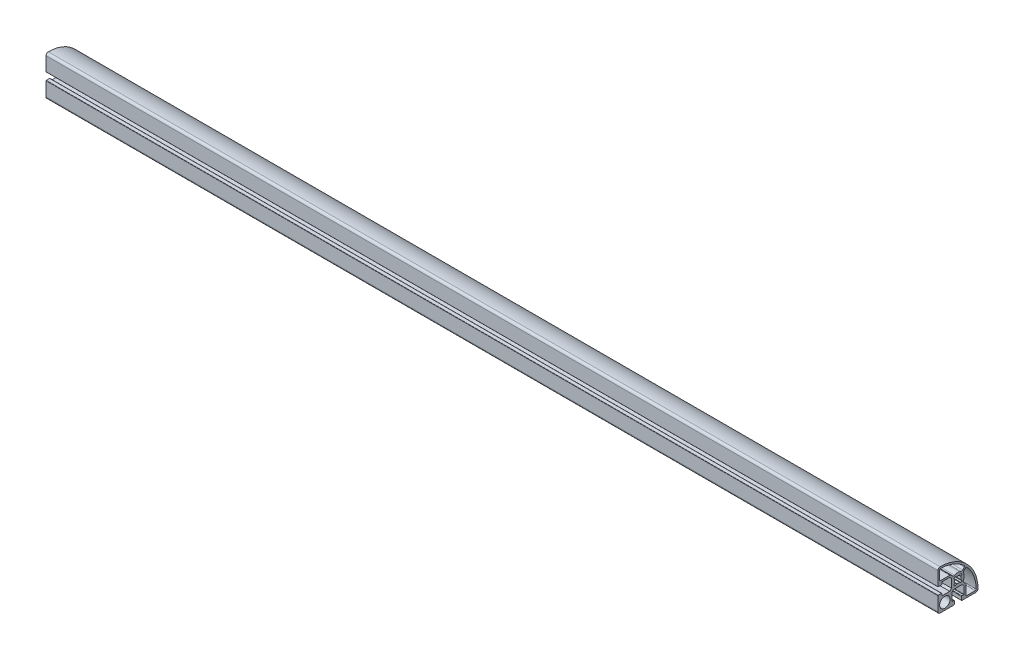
ISO-10303-21;
HEADER;
FILE_DESCRIPTION(('STEP AP214'),'2;1');
FILE_NAME('part.step','',(''),(''),'','','');
FILE_SCHEMA(('AUTOMOTIVE_DESIGN { 1 0 10303 214 1 1 1 1 }'));
ENDSEC;
DATA;
#1=APPLICATION_CONTEXT('core data for automotive mechanical design processes');
#2=APPLICATION_PROTOCOL_DEFINITION('international standard','automotive_design',2000,#1);
#3=PRODUCT_CONTEXT('',#1,'mechanical');
#4=PRODUCT('Part','Part','',(#3));
#5=PRODUCT_RELATED_PRODUCT_CATEGORY('part','',(#4));
#6=PRODUCT_DEFINITION_FORMATION('','',#4);
#7=PRODUCT_DEFINITION_CONTEXT('part definition',#1,'design');
#8=PRODUCT_DEFINITION('design','',#6,#7);
#9=PRODUCT_DEFINITION_SHAPE('','',#8);
#10=(LENGTH_UNIT() NAMED_UNIT(*) SI_UNIT(.MILLI.,.METRE.));
#11=(NAMED_UNIT(*) PLANE_ANGLE_UNIT() SI_UNIT($,.RADIAN.));
#12=(NAMED_UNIT(*) SI_UNIT($,.STERADIAN.) SOLID_ANGLE_UNIT());
#13=UNCERTAINTY_MEASURE_WITH_UNIT(LENGTH_MEASURE(1.E-05),#10,'distance_accuracy_value','');
#14=(GEOMETRIC_REPRESENTATION_CONTEXT(3) GLOBAL_UNCERTAINTY_ASSIGNED_CONTEXT((#13)) GLOBAL_UNIT_ASSIGNED_CONTEXT((#10,
#11,#12)) REPRESENTATION_CONTEXT('',''));
#15=CARTESIAN_POINT('',(0.,0.,0.));
#16=DIRECTION('',(0.,0.,1.));
#17=DIRECTION('',(1.,0.,0.));
#18=AXIS2_PLACEMENT_3D('',#15,#16,#17);
#19=CARTESIAN_POINT('',(1000.,6.79999402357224,17.7000008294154));
#20=DIRECTION('',(0.,1.,0.));
#21=DIRECTION('',(0.,0.,1.));
#22=AXIS2_PLACEMENT_3D('',#19,#20,#21);
#23=PLANE('',#22);
#24=DIRECTION('',(0.,0.,-1.));
#25=VECTOR('',#24,1.);
#26=CARTESIAN_POINT('',(0.,6.79999402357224,17.7000008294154));
#27=LINE('',#26,#25);
#28=CARTESIAN_POINT('',(0.,6.79999402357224,17.7000008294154));
#29=VERTEX_POINT('',#28);
#30=CARTESIAN_POINT('',(0.,6.79999402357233,9.1999984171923));
#31=VERTEX_POINT('',#30);
#32=EDGE_CURVE('E949',#29,#31,#27,.T.);
#33=ORIENTED_EDGE('',*,*,#32,.T.);
#34=DIRECTION('',(-1.,0.,0.));
#35=VECTOR('',#34,1.);
#36=CARTESIAN_POINT('',(1000.,6.79999402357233,9.1999984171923));
#37=LINE('',#36,#35);
#38=CARTESIAN_POINT('',(1000.,6.79999402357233,9.1999984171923));
#39=VERTEX_POINT('',#38);
#40=EDGE_CURVE('E12',#39,#31,#37,.T.);
#41=ORIENTED_EDGE('',*,*,#40,.F.);
#42=DIRECTION('',(0.,0.,-1.));
#43=VECTOR('',#42,1.);
#44=CARTESIAN_POINT('',(1000.,6.79999402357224,17.7000008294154));
#45=LINE('',#44,#43);
#46=CARTESIAN_POINT('',(1000.,6.79999402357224,17.7000008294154));
#47=VERTEX_POINT('',#46);
#48=EDGE_CURVE('E1421',#47,#39,#45,.T.);
#49=ORIENTED_EDGE('',*,*,#48,.F.);
#50=DIRECTION('',(-1.,0.,0.));
#51=VECTOR('',#50,1.);
#52=CARTESIAN_POINT('',(1000.,6.79999402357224,17.7000008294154));
#53=LINE('',#52,#51);
#54=EDGE_CURVE('E1024',#47,#29,#53,.T.);
#55=ORIENTED_EDGE('',*,*,#54,.T.);
#56=EDGE_LOOP('',(#33,#41,#49,#55));
#57=FACE_BOUND('',#56,.T.);
#58=ADVANCED_FACE('F162',(#57),#23,.F.);
#59=CARTESIAN_POINT('',(1000.,6.79999402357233,9.1999984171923));
#60=DIRECTION('',(0.,0.707107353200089,-0.707106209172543));
#61=DIRECTION('',(0.,0.707106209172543,0.707107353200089));
#62=AXIS2_PLACEMENT_3D('',#59,#60,#61);
#63=PLANE('',#62);
#64=DIRECTION('',(0.,-0.707106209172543,-0.707107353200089));
#65=VECTOR('',#64,1.);
#66=CARTESIAN_POINT('',(0.,6.79999402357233,9.1999984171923));
#67=LINE('',#66,#65);
#68=CARTESIAN_POINT('',(0.,4.7999998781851,7.20000103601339));
#69=VERTEX_POINT('',#68);
#70=EDGE_CURVE('E952',#31,#69,#67,.T.);
#71=ORIENTED_EDGE('',*,*,#70,.T.);
#72=DIRECTION('',(-1.,0.,0.));
#73=VECTOR('',#72,1.);
#74=CARTESIAN_POINT('',(1000.,4.7999998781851,7.20000103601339));
#75=LINE('',#74,#73);
#76=CARTESIAN_POINT('',(1000.,4.7999998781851,7.20000103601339));
#77=VERTEX_POINT('',#76);
#78=EDGE_CURVE('E172',#77,#69,#75,.T.);
#79=ORIENTED_EDGE('',*,*,#78,.F.);
#80=DIRECTION('',(0.,-0.707106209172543,-0.707107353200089));
#81=VECTOR('',#80,1.);
#82=CARTESIAN_POINT('',(1000.,6.79999402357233,9.1999984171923));
#83=LINE('',#82,#81);
#84=EDGE_CURVE('E1423',#39,#77,#83,.T.);
#85=ORIENTED_EDGE('',*,*,#84,.F.);
#86=ORIENTED_EDGE('',*,*,#40,.T.);
#87=EDGE_LOOP('',(#71,#79,#85,#86));
#88=FACE_BOUND('',#87,.T.);
#89=ADVANCED_FACE('F1519',(#88),#63,.F.);
#90=CARTESIAN_POINT('',(1000.,4.7999998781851,7.20000103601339));
#91=DIRECTION('',(0.,0.,-1.));
#92=DIRECTION('',(0.,1.,0.));
#93=AXIS2_PLACEMENT_3D('',#90,#91,#92);
#94=PLANE('',#93);
#95=DIRECTION('',(0.,-1.,0.));
#96=VECTOR('',#95,1.);
#97=CARTESIAN_POINT('',(0.,4.7999998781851,7.20000103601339));
#98=LINE('',#97,#96);
#99=CARTESIAN_POINT('',(0.,-4.80000012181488,7.20000103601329));
#100=VERTEX_POINT('',#99);
#101=EDGE_CURVE('E954',#69,#100,#98,.T.);
#102=ORIENTED_EDGE('',*,*,#101,.T.);
#103=DIRECTION('',(-1.,0.,0.));
#104=VECTOR('',#103,1.);
#105=CARTESIAN_POINT('',(1000.,-4.80000012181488,7.20000103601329));
#106=LINE('',#105,#104);
#107=CARTESIAN_POINT('',(1000.,-4.80000012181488,7.20000103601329));
#108=VERTEX_POINT('',#107);
#109=EDGE_CURVE('E1122',#108,#100,#106,.T.);
#110=ORIENTED_EDGE('',*,*,#109,.F.);
#111=DIRECTION('',(0.,-1.,0.));
#112=VECTOR('',#111,1.);
#113=CARTESIAN_POINT('',(1000.,4.7999998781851,7.20000103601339));
#114=LINE('',#113,#112);
#115=EDGE_CURVE('E1425',#77,#108,#114,.T.);
#116=ORIENTED_EDGE('',*,*,#115,.F.);
#117=ORIENTED_EDGE('',*,*,#78,.T.);
#118=EDGE_LOOP('',(#102,#110,#116,#117));
#119=FACE_BOUND('',#118,.T.);
#120=ADVANCED_FACE('F1524',(#119),#94,.F.);
#121=CARTESIAN_POINT('',(1000.,-4.80000012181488,7.20000103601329));
#122=DIRECTION('',(0.,-0.70710678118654,-0.707106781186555));
#123=DIRECTION('',(0.,0.707106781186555,-0.70710678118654));
#124=AXIS2_PLACEMENT_3D('',#121,#122,#123);
#125=PLANE('',#124);
#126=DIRECTION('',(0.,-0.707106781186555,0.70710678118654));
#127=VECTOR('',#126,1.);
#128=CARTESIAN_POINT('',(0.,-4.80000012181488,7.20000103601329));
#129=LINE('',#128,#127);
#130=CARTESIAN_POINT('',(0.,-6.8000001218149,9.20000103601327));
#131=VERTEX_POINT('',#130);
#132=EDGE_CURVE('E956',#100,#131,#129,.T.);
#133=ORIENTED_EDGE('',*,*,#132,.T.);
#134=DIRECTION('',(-1.,0.,0.));
#135=VECTOR('',#134,1.);
#136=CARTESIAN_POINT('',(1000.,-6.8000001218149,9.20000103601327));
#137=LINE('',#136,#135);
#138=CARTESIAN_POINT('',(1000.,-6.8000001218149,9.20000103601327));
#139=VERTEX_POINT('',#138);
#140=EDGE_CURVE('E1119',#139,#131,#137,.T.);
#141=ORIENTED_EDGE('',*,*,#140,.F.);
#142=DIRECTION('',(0.,-0.707106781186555,0.70710678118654));
#143=VECTOR('',#142,1.);
#144=CARTESIAN_POINT('',(1000.,-4.80000012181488,7.20000103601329));
#145=LINE('',#144,#143);
#146=EDGE_CURVE('E1427',#108,#139,#145,.T.);
#147=ORIENTED_EDGE('',*,*,#146,.F.);
#148=ORIENTED_EDGE('',*,*,#109,.T.);
#149=EDGE_LOOP('',(#133,#141,#147,#148));
#150=FACE_BOUND('',#149,.T.);
#151=ADVANCED_FACE('F2142',(#150),#125,.F.);
#152=CARTESIAN_POINT('',(1000.,-6.8000001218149,9.20000103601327));
#153=DIRECTION('',(0.,-1.,0.));
#154=DIRECTION('',(0.,0.,-1.));
#155=AXIS2_PLACEMENT_3D('',#152,#153,#154);
#156=PLANE('',#155);
#157=DIRECTION('',(0.,0.,1.));
#158=VECTOR('',#157,1.);
#159=CARTESIAN_POINT('',(0.,-6.8000001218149,9.20000103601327));
#160=LINE('',#159,#158);
#161=CARTESIAN_POINT('',(0.,-6.80000012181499,17.7000010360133));
#162=VERTEX_POINT('',#161);
#163=EDGE_CURVE('E958',#131,#162,#160,.T.);
#164=ORIENTED_EDGE('',*,*,#163,.T.);
#165=DIRECTION('',(-1.,0.,0.));
#166=VECTOR('',#165,1.);
#167=CARTESIAN_POINT('',(1000.,-6.80000012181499,17.7000010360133));
#168=LINE('',#167,#166);
#169=CARTESIAN_POINT('',(1000.,-6.80000012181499,17.7000010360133));
#170=VERTEX_POINT('',#169);
#171=EDGE_CURVE('E1116',#170,#162,#168,.T.);
#172=ORIENTED_EDGE('',*,*,#171,.F.);
#173=DIRECTION('',(0.,0.,1.));
#174=VECTOR('',#173,1.);
#175=CARTESIAN_POINT('',(1000.,-6.8000001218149,9.20000103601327));
#176=LINE('',#175,#174);
#177=EDGE_CURVE('E1429',#139,#170,#176,.T.);
#178=ORIENTED_EDGE('',*,*,#177,.F.);
#179=ORIENTED_EDGE('',*,*,#140,.T.);
#180=EDGE_LOOP('',(#164,#172,#178,#179));
#181=FACE_BOUND('',#180,.T.);
#182=ADVANCED_FACE('F2133',(#181),#156,.F.);
#183=CARTESIAN_POINT('',(1000.,-6.50000012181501,17.7000010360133));
#184=DIRECTION('',(-1.,0.,0.));
#185=DIRECTION('',(0.,0.,1.));
#186=AXIS2_PLACEMENT_3D('',#183,#184,#185);
#187=CYLINDRICAL_SURFACE('',#186,0.299999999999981);
#188=CARTESIAN_POINT('',(0.,-6.50000012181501,17.7000010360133));
#189=DIRECTION('',(-1.,0.,0.));
#190=DIRECTION('',(0.,0.,-1.));
#191=AXIS2_PLACEMENT_3D('',#188,#189,#190);
#192=CIRCLE('',#191,0.299999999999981);
#193=CARTESIAN_POINT('',(0.,-6.500000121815,18.0000010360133));
#194=VERTEX_POINT('',#193);
#195=EDGE_CURVE('E960',#162,#194,#192,.T.);
#196=ORIENTED_EDGE('',*,*,#195,.T.);
#197=DIRECTION('',(-1.,0.,0.));
#198=VECTOR('',#197,1.);
#199=CARTESIAN_POINT('',(1000.,-6.500000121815,18.0000010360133));
#200=LINE('',#199,#198);
#201=CARTESIAN_POINT('',(1000.,-6.500000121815,18.0000010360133));
#202=VERTEX_POINT('',#201);
#203=EDGE_CURVE('E1113',#202,#194,#200,.T.);
#204=ORIENTED_EDGE('',*,*,#203,.F.);
#205=CARTESIAN_POINT('',(1000.,-6.50000012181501,17.7000010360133));
#206=DIRECTION('',(-1.,0.,0.));
#207=DIRECTION('',(0.,0.,-1.));
#208=AXIS2_PLACEMENT_3D('',#205,#206,#207);
#209=CIRCLE('',#208,0.299999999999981);
#210=EDGE_CURVE('E1431',#170,#202,#209,.T.);
#211=ORIENTED_EDGE('',*,*,#210,.F.);
#212=ORIENTED_EDGE('',*,*,#171,.T.);
#213=EDGE_LOOP('',(#196,#204,#211,#212));
#214=FACE_BOUND('',#213,.T.);
#215=ADVANCED_FACE('F2124',(#214),#187,.F.);
#216=CARTESIAN_POINT('',(1000.,-6.500000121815,18.0000010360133));
#217=DIRECTION('',(0.,0.,1.));
#218=DIRECTION('',(0.,-1.,0.));
#219=AXIS2_PLACEMENT_3D('',#216,#217,#218);
#220=PLANE('',#219);
#221=DIRECTION('',(0.,1.,0.));
#222=VECTOR('',#221,1.);
#223=CARTESIAN_POINT('',(0.,-6.500000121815,18.0000010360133));
#224=LINE('',#223,#222);
#225=CARTESIAN_POINT('',(0.,-4.60000012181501,18.0000010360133));
#226=VERTEX_POINT('',#225);
#227=EDGE_CURVE('E962',#194,#226,#224,.T.);
#228=ORIENTED_EDGE('',*,*,#227,.T.);
#229=DIRECTION('',(-1.,0.,0.));
#230=VECTOR('',#229,1.);
#231=CARTESIAN_POINT('',(1000.,-4.60000012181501,18.0000010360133));
#232=LINE('',#231,#230);
#233=CARTESIAN_POINT('',(1000.,-4.60000012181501,18.0000010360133));
#234=VERTEX_POINT('',#233);
#235=EDGE_CURVE('E1110',#234,#226,#232,.T.);
#236=ORIENTED_EDGE('',*,*,#235,.F.);
#237=DIRECTION('',(0.,1.,0.));
#238=VECTOR('',#237,1.);
#239=CARTESIAN_POINT('',(1000.,-6.500000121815,18.0000010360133));
#240=LINE('',#239,#238);
#241=EDGE_CURVE('E1433',#202,#234,#240,.T.);
#242=ORIENTED_EDGE('',*,*,#241,.F.);
#243=ORIENTED_EDGE('',*,*,#203,.T.);
#244=EDGE_LOOP('',(#228,#236,#242,#243));
#245=FACE_BOUND('',#244,.T.);
#246=ADVANCED_FACE('F2115',(#245),#220,.F.);
#247=CARTESIAN_POINT('',(1000.,-4.60000012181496,18.5000010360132));
#248=DIRECTION('',(-1.,0.,0.));
#249=DIRECTION('',(0.,0.,1.));
#250=AXIS2_PLACEMENT_3D('',#247,#248,#249);
#251=CYLINDRICAL_SURFACE('',#250,0.499999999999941);
#252=CARTESIAN_POINT('',(0.,-4.60000012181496,18.5000010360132));
#253=DIRECTION('',(1.,0.,0.));
#254=DIRECTION('',(0.,0.,-1.));
#255=AXIS2_PLACEMENT_3D('',#252,#253,#254);
#256=CIRCLE('',#255,0.499999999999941);
#257=CARTESIAN_POINT('',(0.,-4.10000012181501,18.5000010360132));
#258=VERTEX_POINT('',#257);
#259=EDGE_CURVE('E964',#226,#258,#256,.T.);
#260=ORIENTED_EDGE('',*,*,#259,.T.);
#261=DIRECTION('',(-1.,0.,0.));
#262=VECTOR('',#261,1.);
#263=CARTESIAN_POINT('',(1000.,-4.10000012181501,18.5000010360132));
#264=LINE('',#263,#262);
#265=CARTESIAN_POINT('',(1000.,-4.10000012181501,18.5000010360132));
#266=VERTEX_POINT('',#265);
#267=EDGE_CURVE('E1107',#266,#258,#264,.T.);
#268=ORIENTED_EDGE('',*,*,#267,.F.);
#269=CARTESIAN_POINT('',(1000.,-4.60000012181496,18.5000010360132));
#270=DIRECTION('',(1.,0.,0.));
#271=DIRECTION('',(0.,0.,-1.));
#272=AXIS2_PLACEMENT_3D('',#269,#270,#271);
#273=CIRCLE('',#272,0.499999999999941);
#274=EDGE_CURVE('E1435',#234,#266,#273,.T.);
#275=ORIENTED_EDGE('',*,*,#274,.F.);
#276=ORIENTED_EDGE('',*,*,#235,.T.);
#277=EDGE_LOOP('',(#260,#268,#275,#276));
#278=FACE_BOUND('',#277,.T.);
#279=ADVANCED_FACE('F2106',(#278),#251,.T.);
#280=CARTESIAN_POINT('',(1000.,-4.10000012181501,18.5000010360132));
#281=DIRECTION('',(0.,-1.,0.));
#282=DIRECTION('',(0.,0.,-1.));
#283=AXIS2_PLACEMENT_3D('',#280,#281,#282);
#284=PLANE('',#283);
#285=DIRECTION('',(0.,0.,1.));
#286=VECTOR('',#285,1.);
#287=CARTESIAN_POINT('',(0.,-4.10000012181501,18.5000010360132));
#288=LINE('',#287,#286);
#289=CARTESIAN_POINT('',(0.,-4.10000012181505,22.2000010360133));
#290=VERTEX_POINT('',#289);
#291=EDGE_CURVE('E966',#258,#290,#288,.T.);
#292=ORIENTED_EDGE('',*,*,#291,.T.);
#293=DIRECTION('',(-1.,0.,0.));
#294=VECTOR('',#293,1.);
#295=CARTESIAN_POINT('',(1000.,-4.10000012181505,22.2000010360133));
#296=LINE('',#295,#294);
#297=CARTESIAN_POINT('',(1000.,-4.10000012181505,22.2000010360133));
#298=VERTEX_POINT('',#297);
#299=EDGE_CURVE('E1104',#298,#290,#296,.T.);
#300=ORIENTED_EDGE('',*,*,#299,.F.);
#301=DIRECTION('',(0.,0.,1.));
#302=VECTOR('',#301,1.);
#303=CARTESIAN_POINT('',(1000.,-4.10000012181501,18.5000010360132));
#304=LINE('',#303,#302);
#305=EDGE_CURVE('E1437',#266,#298,#304,.T.);
#306=ORIENTED_EDGE('',*,*,#305,.F.);
#307=ORIENTED_EDGE('',*,*,#267,.T.);
#308=EDGE_LOOP('',(#292,#300,#306,#307));
#309=FACE_BOUND('',#308,.T.);
#310=ADVANCED_FACE('F2097',(#309),#284,.F.);
#311=CARTESIAN_POINT('',(1000.,-4.40000012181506,22.2000010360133));
#312=DIRECTION('',(-1.,0.,0.));
#313=DIRECTION('',(0.,0.,1.));
#314=AXIS2_PLACEMENT_3D('',#311,#312,#313);
#315=CYLINDRICAL_SURFACE('',#314,0.300000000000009);
#316=CARTESIAN_POINT('',(0.,-4.40000012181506,22.2000010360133));
#317=DIRECTION('',(1.,0.,0.));
#318=DIRECTION('',(0.,0.,-1.));
#319=AXIS2_PLACEMENT_3D('',#316,#317,#318);
#320=CIRCLE('',#319,0.300000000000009);
#321=CARTESIAN_POINT('',(0.,-4.40000012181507,22.5000010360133));
#322=VERTEX_POINT('',#321);
#323=EDGE_CURVE('E968',#290,#322,#320,.T.);
#324=ORIENTED_EDGE('',*,*,#323,.T.);
#325=DIRECTION('',(-1.,0.,0.));
#326=VECTOR('',#325,1.);
#327=CARTESIAN_POINT('',(1000.,-4.40000012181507,22.5000010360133));
#328=LINE('',#327,#326);
#329=CARTESIAN_POINT('',(1000.,-4.40000012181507,22.5000010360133));
#330=VERTEX_POINT('',#329);
#331=EDGE_CURVE('E1101',#330,#322,#328,.T.);
#332=ORIENTED_EDGE('',*,*,#331,.F.);
#333=CARTESIAN_POINT('',(1000.,-4.40000012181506,22.2000010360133));
#334=DIRECTION('',(1.,0.,0.));
#335=DIRECTION('',(0.,0.,-1.));
#336=AXIS2_PLACEMENT_3D('',#333,#334,#335);
#337=CIRCLE('',#336,0.300000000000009);
#338=EDGE_CURVE('E1439',#298,#330,#337,.T.);
#339=ORIENTED_EDGE('',*,*,#338,.F.);
#340=ORIENTED_EDGE('',*,*,#299,.T.);
#341=EDGE_LOOP('',(#324,#332,#339,#340));
#342=FACE_BOUND('',#341,.T.);
#343=ADVANCED_FACE('F2088',(#342),#315,.T.);
#344=CARTESIAN_POINT('',(1000.,-4.40000012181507,22.5000010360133));
#345=DIRECTION('',(0.,0.,-1.));
#346=DIRECTION('',(0.,1.,0.));
#347=AXIS2_PLACEMENT_3D('',#344,#345,#346);
#348=PLANE('',#347);
#349=DIRECTION('',(0.,-1.,0.));
#350=VECTOR('',#349,1.);
#351=CARTESIAN_POINT('',(0.,-4.40000012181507,22.5000010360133));
#352=LINE('',#351,#350);
#353=CARTESIAN_POINT('',(0.,-20.0000003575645,22.5000010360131));
#354=VERTEX_POINT('',#353);
#355=EDGE_CURVE('E970',#322,#354,#352,.T.);
#356=ORIENTED_EDGE('',*,*,#355,.T.);
#357=DIRECTION('',(-1.,0.,0.));
#358=VECTOR('',#357,1.);
#359=CARTESIAN_POINT('',(1000.,-20.0000003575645,22.5000010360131));
#360=LINE('',#359,#358);
#361=CARTESIAN_POINT('',(1000.,-20.0000003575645,22.5000010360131));
#362=VERTEX_POINT('',#361);
#363=EDGE_CURVE('E1098',#362,#354,#360,.T.);
#364=ORIENTED_EDGE('',*,*,#363,.F.);
#365=DIRECTION('',(0.,-1.,0.));
#366=VECTOR('',#365,1.);
#367=CARTESIAN_POINT('',(1000.,-4.40000012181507,22.5000010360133));
#368=LINE('',#367,#366);
#369=EDGE_CURVE('E1441',#330,#362,#368,.T.);
#370=ORIENTED_EDGE('',*,*,#369,.F.);
#371=ORIENTED_EDGE('',*,*,#331,.T.);
#372=EDGE_LOOP('',(#356,#364,#370,#371));
#373=FACE_BOUND('',#372,.T.);
#374=ADVANCED_FACE('F2079',(#373),#348,.F.);
#375=CARTESIAN_POINT('',(1000.,-20.0000003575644,20.0000010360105));
#376=DIRECTION('',(-1.,0.,0.));
#377=DIRECTION('',(0.,0.,1.));
#378=AXIS2_PLACEMENT_3D('',#375,#376,#377);
#379=CYLINDRICAL_SURFACE('',#378,2.50000000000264);
#380=CARTESIAN_POINT('',(0.,-20.0000003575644,20.0000010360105));
#381=DIRECTION('',(1.,0.,0.));
#382=DIRECTION('',(0.,0.,-1.));
#383=AXIS2_PLACEMENT_3D('',#380,#381,#382);
#384=CIRCLE('',#383,2.50000000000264);
#385=CARTESIAN_POINT('',(0.,-22.5000003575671,20.0000010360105));
#386=VERTEX_POINT('',#385);
#387=EDGE_CURVE('E972',#354,#386,#384,.T.);
#388=ORIENTED_EDGE('',*,*,#387,.T.);
#389=DIRECTION('',(-1.,0.,0.));
#390=VECTOR('',#389,1.);
#391=CARTESIAN_POINT('',(1000.,-22.5000003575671,20.0000010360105));
#392=LINE('',#391,#390);
#393=CARTESIAN_POINT('',(1000.,-22.5000003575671,20.0000010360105));
#394=VERTEX_POINT('',#393);
#395=EDGE_CURVE('E1095',#394,#386,#392,.T.);
#396=ORIENTED_EDGE('',*,*,#395,.F.);
#397=CARTESIAN_POINT('',(1000.,-20.0000003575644,20.0000010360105));
#398=DIRECTION('',(1.,0.,0.));
#399=DIRECTION('',(0.,0.,-1.));
#400=AXIS2_PLACEMENT_3D('',#397,#398,#399);
#401=CIRCLE('',#400,2.50000000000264);
#402=EDGE_CURVE('E1443',#362,#394,#401,.T.);
#403=ORIENTED_EDGE('',*,*,#402,.F.);
#404=ORIENTED_EDGE('',*,*,#363,.T.);
#405=EDGE_LOOP('',(#388,#396,#403,#404));
#406=FACE_BOUND('',#405,.T.);
#407=ADVANCED_FACE('F2070',(#406),#379,.T.);
#408=CARTESIAN_POINT('',(1000.,-22.5000003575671,20.0000010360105));
#409=DIRECTION('',(0.,1.,0.));
#410=DIRECTION('',(0.,0.,1.));
#411=AXIS2_PLACEMENT_3D('',#408,#409,#410);
#412=PLANE('',#411);
#413=DIRECTION('',(0.,0.,-1.));
#414=VECTOR('',#413,1.);
#415=CARTESIAN_POINT('',(0.,-22.5000003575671,20.0000010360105));
#416=LINE('',#415,#414);
#417=CARTESIAN_POINT('',(0.,-22.5000003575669,4.40000103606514));
#418=VERTEX_POINT('',#417);
#419=EDGE_CURVE('E974',#386,#418,#416,.T.);
#420=ORIENTED_EDGE('',*,*,#419,.T.);
#421=DIRECTION('',(-1.,0.,0.));
#422=VECTOR('',#421,1.);
#423=CARTESIAN_POINT('',(1000.,-22.5000003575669,4.40000103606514));
#424=LINE('',#423,#422);
#425=CARTESIAN_POINT('',(1000.,-22.5000003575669,4.40000103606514));
#426=VERTEX_POINT('',#425);
#427=EDGE_CURVE('E1092',#426,#418,#424,.T.);
#428=ORIENTED_EDGE('',*,*,#427,.F.);
#429=DIRECTION('',(0.,0.,-1.));
#430=VECTOR('',#429,1.);
#431=CARTESIAN_POINT('',(1000.,-22.5000003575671,20.0000010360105));
#432=LINE('',#431,#430);
#433=EDGE_CURVE('E1445',#394,#426,#432,.T.);
#434=ORIENTED_EDGE('',*,*,#433,.F.);
#435=ORIENTED_EDGE('',*,*,#395,.T.);
#436=EDGE_LOOP('',(#420,#428,#434,#435));
#437=FACE_BOUND('',#436,.T.);
#438=ADVANCED_FACE('F2061',(#437),#412,.F.);
#439=CARTESIAN_POINT('',(1000.,-22.2000003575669,4.40000103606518));
#440=DIRECTION('',(-1.,0.,0.));
#441=DIRECTION('',(0.,0.,1.));
#442=AXIS2_PLACEMENT_3D('',#439,#440,#441);
#443=CYLINDRICAL_SURFACE('',#442,0.300000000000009);
#444=CARTESIAN_POINT('',(0.,-22.2000003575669,4.40000103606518));
#445=DIRECTION('',(1.,0.,0.));
#446=DIRECTION('',(0.,0.,-1.));
#447=AXIS2_PLACEMENT_3D('',#444,#445,#446);
#448=CIRCLE('',#447,0.300000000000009);
#449=CARTESIAN_POINT('',(0.,-22.2000003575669,4.10000103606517));
#450=VERTEX_POINT('',#449);
#451=EDGE_CURVE('E976',#418,#450,#448,.T.);
#452=ORIENTED_EDGE('',*,*,#451,.T.);
#453=DIRECTION('',(-1.,0.,0.));
#454=VECTOR('',#453,1.);
#455=CARTESIAN_POINT('',(1000.,-22.2000003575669,4.10000103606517));
#456=LINE('',#455,#454);
#457=CARTESIAN_POINT('',(1000.,-22.2000003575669,4.10000103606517));
#458=VERTEX_POINT('',#457);
#459=EDGE_CURVE('E1089',#458,#450,#456,.T.);
#460=ORIENTED_EDGE('',*,*,#459,.F.);
#461=CARTESIAN_POINT('',(1000.,-22.2000003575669,4.40000103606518));
#462=DIRECTION('',(1.,0.,0.));
#463=DIRECTION('',(0.,0.,-1.));
#464=AXIS2_PLACEMENT_3D('',#461,#462,#463);
#465=CIRCLE('',#464,0.300000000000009);
#466=EDGE_CURVE('E1447',#426,#458,#465,.T.);
#467=ORIENTED_EDGE('',*,*,#466,.F.);
#468=ORIENTED_EDGE('',*,*,#427,.T.);
#469=EDGE_LOOP('',(#452,#460,#467,#468));
#470=FACE_BOUND('',#469,.T.);
#471=ADVANCED_FACE('F2052',(#470),#443,.T.);
#472=CARTESIAN_POINT('',(1000.,-22.2000003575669,4.10000103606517));
#473=DIRECTION('',(0.,0.,1.));
#474=DIRECTION('',(0.,-1.,0.));
#475=AXIS2_PLACEMENT_3D('',#472,#473,#474);
#476=PLANE('',#475);
#477=DIRECTION('',(0.,1.,0.));
#478=VECTOR('',#477,1.);
#479=CARTESIAN_POINT('',(0.,-22.2000003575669,4.10000103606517));
#480=LINE('',#479,#478);
#481=CARTESIAN_POINT('',(0.,-18.5000003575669,4.10000103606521));
#482=VERTEX_POINT('',#481);
#483=EDGE_CURVE('E978',#450,#482,#480,.T.);
#484=ORIENTED_EDGE('',*,*,#483,.T.);
#485=DIRECTION('',(-1.,0.,0.));
#486=VECTOR('',#485,1.);
#487=CARTESIAN_POINT('',(1000.,-18.5000003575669,4.10000103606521));
#488=LINE('',#487,#486);
#489=CARTESIAN_POINT('',(1000.,-18.5000003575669,4.10000103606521));
#490=VERTEX_POINT('',#489);
#491=EDGE_CURVE('E1086',#490,#482,#488,.T.);
#492=ORIENTED_EDGE('',*,*,#491,.F.);
#493=DIRECTION('',(0.,1.,0.));
#494=VECTOR('',#493,1.);
#495=CARTESIAN_POINT('',(1000.,-22.2000003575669,4.10000103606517));
#496=LINE('',#495,#494);
#497=EDGE_CURVE('E1449',#458,#490,#496,.T.);
#498=ORIENTED_EDGE('',*,*,#497,.F.);
#499=ORIENTED_EDGE('',*,*,#459,.T.);
#500=EDGE_LOOP('',(#484,#492,#498,#499));
#501=FACE_BOUND('',#500,.T.);
#502=ADVANCED_FACE('F2043',(#501),#476,.F.);
#503=CARTESIAN_POINT('',(1000.,-18.5000003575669,4.60000103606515));
#504=DIRECTION('',(-1.,0.,0.));
#505=DIRECTION('',(0.,0.,1.));
#506=AXIS2_PLACEMENT_3D('',#503,#504,#505);
#507=CYLINDRICAL_SURFACE('',#506,0.499999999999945);
#508=CARTESIAN_POINT('',(0.,-18.5000003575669,4.60000103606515));
#509=DIRECTION('',(1.,0.,0.));
#510=DIRECTION('',(0.,0.,-1.));
#511=AXIS2_PLACEMENT_3D('',#508,#509,#510);
#512=CIRCLE('',#511,0.499999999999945);
#513=CARTESIAN_POINT('',(0.,-18.0000003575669,4.60000103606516));
#514=VERTEX_POINT('',#513);
#515=EDGE_CURVE('E980',#482,#514,#512,.T.);
#516=ORIENTED_EDGE('',*,*,#515,.T.);
#517=DIRECTION('',(-1.,0.,0.));
#518=VECTOR('',#517,1.);
#519=CARTESIAN_POINT('',(1000.,-18.0000003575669,4.60000103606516));
#520=LINE('',#519,#518);
#521=CARTESIAN_POINT('',(1000.,-18.0000003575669,4.60000103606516));
#522=VERTEX_POINT('',#521);
#523=EDGE_CURVE('E1083',#522,#514,#520,.T.);
#524=ORIENTED_EDGE('',*,*,#523,.F.);
#525=CARTESIAN_POINT('',(1000.,-18.5000003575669,4.60000103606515));
#526=DIRECTION('',(1.,0.,0.));
#527=DIRECTION('',(0.,0.,-1.));
#528=AXIS2_PLACEMENT_3D('',#525,#526,#527);
#529=CIRCLE('',#528,0.499999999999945);
#530=EDGE_CURVE('E1451',#490,#522,#529,.T.);
#531=ORIENTED_EDGE('',*,*,#530,.F.);
#532=ORIENTED_EDGE('',*,*,#491,.T.);
#533=EDGE_LOOP('',(#516,#524,#531,#532));
#534=FACE_BOUND('',#533,.T.);
#535=ADVANCED_FACE('F2034',(#534),#507,.T.);
#536=CARTESIAN_POINT('',(1000.,-18.0000003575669,4.60000103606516));
#537=DIRECTION('',(0.,-1.,0.));
#538=DIRECTION('',(0.,0.,-1.));
#539=AXIS2_PLACEMENT_3D('',#536,#537,#538);
#540=PLANE('',#539);
#541=DIRECTION('',(0.,0.,1.));
#542=VECTOR('',#541,1.);
#543=CARTESIAN_POINT('',(0.,-18.0000003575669,4.60000103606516));
#544=LINE('',#543,#542);
#545=CARTESIAN_POINT('',(0.,-18.0000003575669,6.5000010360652));
#546=VERTEX_POINT('',#545);
#547=EDGE_CURVE('E982',#514,#546,#544,.T.);
#548=ORIENTED_EDGE('',*,*,#547,.T.);
#549=DIRECTION('',(-1.,0.,0.));
#550=VECTOR('',#549,1.);
#551=CARTESIAN_POINT('',(1000.,-18.0000003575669,6.5000010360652));
#552=LINE('',#551,#550);
#553=CARTESIAN_POINT('',(1000.,-18.0000003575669,6.5000010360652));
#554=VERTEX_POINT('',#553);
#555=EDGE_CURVE('E1080',#554,#546,#552,.T.);
#556=ORIENTED_EDGE('',*,*,#555,.F.);
#557=DIRECTION('',(0.,0.,1.));
#558=VECTOR('',#557,1.);
#559=CARTESIAN_POINT('',(1000.,-18.0000003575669,4.60000103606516));
#560=LINE('',#559,#558);
#561=EDGE_CURVE('E1453',#522,#554,#560,.T.);
#562=ORIENTED_EDGE('',*,*,#561,.F.);
#563=ORIENTED_EDGE('',*,*,#523,.T.);
#564=EDGE_LOOP('',(#548,#556,#562,#563));
#565=FACE_BOUND('',#564,.T.);
#566=ADVANCED_FACE('F2025',(#565),#540,.F.);
#567=CARTESIAN_POINT('',(1000.,-17.7000003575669,6.5000010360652));
#568=DIRECTION('',(-1.,0.,0.));
#569=DIRECTION('',(0.,0.,1.));
#570=AXIS2_PLACEMENT_3D('',#567,#568,#569);
#571=CYLINDRICAL_SURFACE('',#570,0.300000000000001);
#572=CARTESIAN_POINT('',(0.,-17.7000003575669,6.5000010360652));
#573=DIRECTION('',(-1.,0.,0.));
#574=DIRECTION('',(0.,0.,-1.));
#575=AXIS2_PLACEMENT_3D('',#572,#573,#574);
#576=CIRCLE('',#575,0.300000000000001);
#577=CARTESIAN_POINT('',(0.,-17.7000003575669,6.8000010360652));
#578=VERTEX_POINT('',#577);
#579=EDGE_CURVE('E984',#546,#578,#576,.T.);
#580=ORIENTED_EDGE('',*,*,#579,.T.);
#581=DIRECTION('',(-1.,0.,0.));
#582=VECTOR('',#581,1.);
#583=CARTESIAN_POINT('',(1000.,-17.7000003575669,6.8000010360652));
#584=LINE('',#583,#582);
#585=CARTESIAN_POINT('',(1000.,-17.7000003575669,6.8000010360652));
#586=VERTEX_POINT('',#585);
#587=EDGE_CURVE('E1077',#586,#578,#584,.T.);
#588=ORIENTED_EDGE('',*,*,#587,.F.);
#589=CARTESIAN_POINT('',(1000.,-17.7000003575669,6.5000010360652));
#590=DIRECTION('',(-1.,0.,0.));
#591=DIRECTION('',(0.,0.,-1.));
#592=AXIS2_PLACEMENT_3D('',#589,#590,#591);
#593=CIRCLE('',#592,0.300000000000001);
#594=EDGE_CURVE('E1455',#554,#586,#593,.T.);
#595=ORIENTED_EDGE('',*,*,#594,.F.);
#596=ORIENTED_EDGE('',*,*,#555,.T.);
#597=EDGE_LOOP('',(#580,#588,#595,#596));
#598=FACE_BOUND('',#597,.T.);
#599=ADVANCED_FACE('F2016',(#598),#571,.F.);
#600=CARTESIAN_POINT('',(1000.,-17.7000003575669,6.8000010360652));
#601=DIRECTION('',(0.,0.,1.));
#602=DIRECTION('',(0.,-1.,0.));
#603=AXIS2_PLACEMENT_3D('',#600,#601,#602);
#604=PLANE('',#603);
#605=DIRECTION('',(0.,1.,0.));
#606=VECTOR('',#605,1.);
#607=CARTESIAN_POINT('',(0.,-17.7000003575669,6.8000010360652));
#608=LINE('',#607,#606);
#609=CARTESIAN_POINT('',(0.,-9.20000035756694,6.80000103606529));
#610=VERTEX_POINT('',#609);
#611=EDGE_CURVE('E986',#578,#610,#608,.T.);
#612=ORIENTED_EDGE('',*,*,#611,.T.);
#613=DIRECTION('',(-1.,0.,0.));
#614=VECTOR('',#613,1.);
#615=CARTESIAN_POINT('',(1000.,-9.20000035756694,6.80000103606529));
#616=LINE('',#615,#614);
#617=CARTESIAN_POINT('',(1000.,-9.20000035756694,6.80000103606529));
#618=VERTEX_POINT('',#617);
#619=EDGE_CURVE('E1074',#618,#610,#616,.T.);
#620=ORIENTED_EDGE('',*,*,#619,.F.);
#621=DIRECTION('',(0.,1.,0.));
#622=VECTOR('',#621,1.);
#623=CARTESIAN_POINT('',(1000.,-17.7000003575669,6.8000010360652));
#624=LINE('',#623,#622);
#625=EDGE_CURVE('E1457',#586,#618,#624,.T.);
#626=ORIENTED_EDGE('',*,*,#625,.F.);
#627=ORIENTED_EDGE('',*,*,#587,.T.);
#628=EDGE_LOOP('',(#612,#620,#626,#627));
#629=FACE_BOUND('',#628,.T.);
#630=ADVANCED_FACE('F2007',(#629),#604,.F.);
#631=CARTESIAN_POINT('',(1000.,-9.20000035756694,6.80000103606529));
#632=DIRECTION('',(0.,0.70710678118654,0.707106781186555));
#633=DIRECTION('',(0.,-0.707106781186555,0.70710678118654));
#634=AXIS2_PLACEMENT_3D('',#631,#632,#633);
#635=PLANE('',#634);
#636=DIRECTION('',(0.,0.707106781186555,-0.70710678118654));
#637=VECTOR('',#636,1.);
#638=CARTESIAN_POINT('',(0.,-9.20000035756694,6.80000103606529));
#639=LINE('',#638,#637);
#640=CARTESIAN_POINT('',(0.,-7.20000035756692,4.80000103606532));
#641=VERTEX_POINT('',#640);
#642=EDGE_CURVE('E988',#610,#641,#639,.T.);
#643=ORIENTED_EDGE('',*,*,#642,.T.);
#644=DIRECTION('',(-1.,0.,0.));
#645=VECTOR('',#644,1.);
#646=CARTESIAN_POINT('',(1000.,-7.20000035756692,4.80000103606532));
#647=LINE('',#646,#645);
#648=CARTESIAN_POINT('',(1000.,-7.20000035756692,4.80000103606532));
#649=VERTEX_POINT('',#648);
#650=EDGE_CURVE('E1071',#649,#641,#647,.T.);
#651=ORIENTED_EDGE('',*,*,#650,.F.);
#652=DIRECTION('',(0.,0.707106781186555,-0.70710678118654));
#653=VECTOR('',#652,1.);
#654=CARTESIAN_POINT('',(1000.,-9.20000035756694,6.80000103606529));
#655=LINE('',#654,#653);
#656=EDGE_CURVE('E1459',#618,#649,#655,.T.);
#657=ORIENTED_EDGE('',*,*,#656,.F.);
#658=ORIENTED_EDGE('',*,*,#619,.T.);
#659=EDGE_LOOP('',(#643,#651,#657,#658));
#660=FACE_BOUND('',#659,.T.);
#661=ADVANCED_FACE('F1998',(#660),#635,.F.);
#662=CARTESIAN_POINT('',(1000.,-7.20000035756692,4.80000103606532));
#663=DIRECTION('',(0.,1.,0.));
#664=DIRECTION('',(0.,0.,1.));
#665=AXIS2_PLACEMENT_3D('',#662,#663,#664);
#666=PLANE('',#665);
#667=DIRECTION('',(0.,0.,-1.));
#668=VECTOR('',#667,1.);
#669=CARTESIAN_POINT('',(0.,-7.20000035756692,4.80000103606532));
#670=LINE('',#669,#668);
#671=CARTESIAN_POINT('',(0.,-7.20000035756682,-4.79999896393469));
#672=VERTEX_POINT('',#671);
#673=EDGE_CURVE('E990',#641,#672,#670,.T.);
#674=ORIENTED_EDGE('',*,*,#673,.T.);
#675=DIRECTION('',(-1.,0.,0.));
#676=VECTOR('',#675,1.);
#677=CARTESIAN_POINT('',(1000.,-7.20000035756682,-4.79999896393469));
#678=LINE('',#677,#676);
#679=CARTESIAN_POINT('',(1000.,-7.20000035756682,-4.79999896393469));
#680=VERTEX_POINT('',#679);
#681=EDGE_CURVE('E1068',#680,#672,#678,.T.);
#682=ORIENTED_EDGE('',*,*,#681,.F.);
#683=DIRECTION('',(0.,0.,-1.));
#684=VECTOR('',#683,1.);
#685=CARTESIAN_POINT('',(1000.,-7.20000035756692,4.80000103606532));
#686=LINE('',#685,#684);
#687=EDGE_CURVE('E1461',#649,#680,#686,.T.);
#688=ORIENTED_EDGE('',*,*,#687,.F.);
#689=ORIENTED_EDGE('',*,*,#650,.T.);
#690=EDGE_LOOP('',(#674,#682,#688,#689));
#691=FACE_BOUND('',#690,.T.);
#692=ADVANCED_FACE('F1989',(#691),#666,.F.);
#693=CARTESIAN_POINT('',(1000.,-7.20000035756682,-4.79999896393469));
#694=DIRECTION('',(0.,0.707106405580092,-0.707107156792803));
#695=DIRECTION('',(0.,0.707107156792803,0.707106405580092));
#696=AXIS2_PLACEMENT_3D('',#693,#694,#695);
#697=PLANE('',#696);
#698=DIRECTION('',(0.,-0.707107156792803,-0.707106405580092));
#699=VECTOR('',#698,1.);
#700=CARTESIAN_POINT('',(0.,-7.20000035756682,-4.79999896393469));
#701=LINE('',#700,#699);
#702=CARTESIAN_POINT('',(0.,-9.19999748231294,-6.79999396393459));
#703=VERTEX_POINT('',#702);
#704=EDGE_CURVE('E992',#672,#703,#701,.T.);
#705=ORIENTED_EDGE('',*,*,#704,.T.);
#706=DIRECTION('',(-1.,0.,0.));
#707=VECTOR('',#706,1.);
#708=CARTESIAN_POINT('',(1000.,-9.19999748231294,-6.79999396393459));
#709=LINE('',#708,#707);
#710=CARTESIAN_POINT('',(1000.,-9.19999748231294,-6.79999396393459));
#711=VERTEX_POINT('',#710);
#712=EDGE_CURVE('E1065',#711,#703,#709,.T.);
#713=ORIENTED_EDGE('',*,*,#712,.F.);
#714=DIRECTION('',(0.,-0.707107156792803,-0.707106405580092));
#715=VECTOR('',#714,1.);
#716=CARTESIAN_POINT('',(1000.,-7.20000035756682,-4.79999896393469));
#717=LINE('',#716,#715);
#718=EDGE_CURVE('E1463',#680,#711,#717,.T.);
#719=ORIENTED_EDGE('',*,*,#718,.F.);
#720=ORIENTED_EDGE('',*,*,#681,.T.);
#721=EDGE_LOOP('',(#705,#713,#719,#720));
#722=FACE_BOUND('',#721,.T.);
#723=ADVANCED_FACE('F1980',(#722),#697,.F.);
#724=CARTESIAN_POINT('',(1000.,-9.19999748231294,-6.79999396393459));
#725=DIRECTION('',(0.,0.,-1.));
#726=DIRECTION('',(0.,1.,0.));
#727=AXIS2_PLACEMENT_3D('',#724,#725,#726);
#728=PLANE('',#727);
#729=DIRECTION('',(0.,-1.,0.));
#730=VECTOR('',#729,1.);
#731=CARTESIAN_POINT('',(0.,-9.19999748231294,-6.79999396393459));
#732=LINE('',#731,#730);
#733=CARTESIAN_POINT('',(0.,-17.7000001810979,-6.79999396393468));
#734=VERTEX_POINT('',#733);
#735=EDGE_CURVE('E994',#703,#734,#732,.T.);
#736=ORIENTED_EDGE('',*,*,#735,.T.);
#737=DIRECTION('',(-1.,0.,0.));
#738=VECTOR('',#737,1.);
#739=CARTESIAN_POINT('',(1000.,-17.7000001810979,-6.79999396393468));
#740=LINE('',#739,#738);
#741=CARTESIAN_POINT('',(1000.,-17.7000001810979,-6.79999396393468));
#742=VERTEX_POINT('',#741);
#743=EDGE_CURVE('E1062',#742,#734,#740,.T.);
#744=ORIENTED_EDGE('',*,*,#743,.F.);
#745=DIRECTION('',(0.,-1.,0.));
#746=VECTOR('',#745,1.);
#747=CARTESIAN_POINT('',(1000.,-9.19999748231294,-6.79999396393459));
#748=LINE('',#747,#746);
#749=EDGE_CURVE('E1465',#711,#742,#748,.T.);
#750=ORIENTED_EDGE('',*,*,#749,.F.);
#751=ORIENTED_EDGE('',*,*,#712,.T.);
#752=EDGE_LOOP('',(#736,#744,#750,#751));
#753=FACE_BOUND('',#752,.T.);
#754=ADVANCED_FACE('F1971',(#753),#728,.F.);
#755=CARTESIAN_POINT('',(1000.,-17.7000003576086,-6.49999396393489));
#756=DIRECTION('',(-1.,0.,0.));
#757=DIRECTION('',(0.,0.,1.));
#758=AXIS2_PLACEMENT_3D('',#755,#756,#757);
#759=CYLINDRICAL_SURFACE('',#758,0.299999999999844);
#760=CARTESIAN_POINT('',(0.,-17.7000003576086,-6.49999396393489));
#761=DIRECTION('',(-1.,0.,0.));
#762=DIRECTION('',(0.,0.,-1.));
#763=AXIS2_PLACEMENT_3D('',#760,#761,#762);
#764=CIRCLE('',#763,0.299999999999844);
#765=CARTESIAN_POINT('',(0.,-18.0000003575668,-6.49999896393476));
#766=VERTEX_POINT('',#765);
#767=EDGE_CURVE('E996',#734,#766,#764,.T.);
#768=ORIENTED_EDGE('',*,*,#767,.T.);
#769=DIRECTION('',(-1.,0.,0.));
#770=VECTOR('',#769,1.);
#771=CARTESIAN_POINT('',(1000.,-18.0000003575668,-6.49999896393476));
#772=LINE('',#771,#770);
#773=CARTESIAN_POINT('',(1000.,-18.0000003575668,-6.49999896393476));
#774=VERTEX_POINT('',#773);
#775=EDGE_CURVE('E1059',#774,#766,#772,.T.);
#776=ORIENTED_EDGE('',*,*,#775,.F.);
#777=CARTESIAN_POINT('',(1000.,-17.7000003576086,-6.49999396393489));
#778=DIRECTION('',(-1.,0.,0.));
#779=DIRECTION('',(0.,0.,-1.));
#780=AXIS2_PLACEMENT_3D('',#777,#778,#779);
#781=CIRCLE('',#780,0.299999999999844);
#782=EDGE_CURVE('E1467',#742,#774,#781,.T.);
#783=ORIENTED_EDGE('',*,*,#782,.F.);
#784=ORIENTED_EDGE('',*,*,#743,.T.);
#785=EDGE_LOOP('',(#768,#776,#783,#784));
#786=FACE_BOUND('',#785,.T.);
#787=ADVANCED_FACE('F1962',(#786),#759,.F.);
#788=CARTESIAN_POINT('',(1000.,-18.0000003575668,-6.49999896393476));
#789=DIRECTION('',(0.,-1.,0.));
#790=DIRECTION('',(0.,0.,-1.));
#791=AXIS2_PLACEMENT_3D('',#788,#789,#790);
#792=PLANE('',#791);
#793=DIRECTION('',(0.,0.,1.));
#794=VECTOR('',#793,1.);
#795=CARTESIAN_POINT('',(0.,-18.0000003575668,-6.49999896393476));
#796=LINE('',#795,#794);
#797=CARTESIAN_POINT('',(0.,-18.0000003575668,-4.59999896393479));
#798=VERTEX_POINT('',#797);
#799=EDGE_CURVE('E998',#766,#798,#796,.T.);
#800=ORIENTED_EDGE('',*,*,#799,.T.);
#801=DIRECTION('',(-1.,0.,0.));
#802=VECTOR('',#801,1.);
#803=CARTESIAN_POINT('',(1000.,-18.0000003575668,-4.59999896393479));
#804=LINE('',#803,#802);
#805=CARTESIAN_POINT('',(1000.,-18.0000003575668,-4.59999896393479));
#806=VERTEX_POINT('',#805);
#807=EDGE_CURVE('E1056',#806,#798,#804,.T.);
#808=ORIENTED_EDGE('',*,*,#807,.F.);
#809=DIRECTION('',(0.,0.,1.));
#810=VECTOR('',#809,1.);
#811=CARTESIAN_POINT('',(1000.,-18.0000003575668,-6.49999896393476));
#812=LINE('',#811,#810);
#813=EDGE_CURVE('E1469',#774,#806,#812,.T.);
#814=ORIENTED_EDGE('',*,*,#813,.F.);
#815=ORIENTED_EDGE('',*,*,#775,.T.);
#816=EDGE_LOOP('',(#800,#808,#814,#815));
#817=FACE_BOUND('',#816,.T.);
#818=ADVANCED_FACE('F1953',(#817),#792,.F.);
#819=CARTESIAN_POINT('',(1000.,-18.5000003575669,-4.59999896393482));
#820=DIRECTION('',(-1.,0.,0.));
#821=DIRECTION('',(0.,0.,1.));
#822=AXIS2_PLACEMENT_3D('',#819,#820,#821);
#823=CYLINDRICAL_SURFACE('',#822,0.500000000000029);
#824=CARTESIAN_POINT('',(0.,-18.5000003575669,-4.59999896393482));
#825=DIRECTION('',(1.,0.,0.));
#826=DIRECTION('',(0.,0.,-1.));
#827=AXIS2_PLACEMENT_3D('',#824,#825,#826);
#828=CIRCLE('',#827,0.500000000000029);
#829=CARTESIAN_POINT('',(0.,-18.5000003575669,-4.09999896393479));
#830=VERTEX_POINT('',#829);
#831=EDGE_CURVE('E1000',#798,#830,#828,.T.);
#832=ORIENTED_EDGE('',*,*,#831,.T.);
#833=DIRECTION('',(-1.,0.,0.));
#834=VECTOR('',#833,1.);
#835=CARTESIAN_POINT('',(1000.,-18.5000003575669,-4.09999896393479));
#836=LINE('',#835,#834);
#837=CARTESIAN_POINT('',(1000.,-18.5000003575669,-4.09999896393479));
#838=VERTEX_POINT('',#837);
#839=EDGE_CURVE('E1053',#838,#830,#836,.T.);
#840=ORIENTED_EDGE('',*,*,#839,.F.);
#841=CARTESIAN_POINT('',(1000.,-18.5000003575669,-4.59999896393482));
#842=DIRECTION('',(1.,0.,0.));
#843=DIRECTION('',(0.,0.,-1.));
#844=AXIS2_PLACEMENT_3D('',#841,#842,#843);
#845=CIRCLE('',#844,0.500000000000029);
#846=EDGE_CURVE('E1471',#806,#838,#845,.T.);
#847=ORIENTED_EDGE('',*,*,#846,.F.);
#848=ORIENTED_EDGE('',*,*,#807,.T.);
#849=EDGE_LOOP('',(#832,#840,#847,#848));
#850=FACE_BOUND('',#849,.T.);
#851=ADVANCED_FACE('F1944',(#850),#823,.T.);
#852=CARTESIAN_POINT('',(1000.,-18.5000003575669,-4.09999896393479));
#853=DIRECTION('',(0.,0.,-1.));
#854=DIRECTION('',(0.,1.,0.));
#855=AXIS2_PLACEMENT_3D('',#852,#853,#854);
#856=PLANE('',#855);
#857=DIRECTION('',(0.,-1.,0.));
#858=VECTOR('',#857,1.);
#859=CARTESIAN_POINT('',(0.,-18.5000003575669,-4.09999896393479));
#860=LINE('',#859,#858);
#861=CARTESIAN_POINT('',(0.,-22.2000003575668,-4.09999896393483));
#862=VERTEX_POINT('',#861);
#863=EDGE_CURVE('E1002',#830,#862,#860,.T.);
#864=ORIENTED_EDGE('',*,*,#863,.T.);
#865=DIRECTION('',(-1.,0.,0.));
#866=VECTOR('',#865,1.);
#867=CARTESIAN_POINT('',(1000.,-22.2000003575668,-4.09999896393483));
#868=LINE('',#867,#866);
#869=CARTESIAN_POINT('',(1000.,-22.2000003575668,-4.09999896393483));
#870=VERTEX_POINT('',#869);
#871=EDGE_CURVE('E1050',#870,#862,#868,.T.);
#872=ORIENTED_EDGE('',*,*,#871,.F.);
#873=DIRECTION('',(0.,-1.,0.));
#874=VECTOR('',#873,1.);
#875=CARTESIAN_POINT('',(1000.,-18.5000003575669,-4.09999896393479));
#876=LINE('',#875,#874);
#877=EDGE_CURVE('E1473',#838,#870,#876,.T.);
#878=ORIENTED_EDGE('',*,*,#877,.F.);
#879=ORIENTED_EDGE('',*,*,#839,.T.);
#880=EDGE_LOOP('',(#864,#872,#878,#879));
#881=FACE_BOUND('',#880,.T.);
#882=ADVANCED_FACE('F1935',(#881),#856,.F.);
#883=CARTESIAN_POINT('',(1000.,-22.2000003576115,-4.3999989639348));
#884=DIRECTION('',(-1.,0.,0.));
#885=DIRECTION('',(0.,0.,1.));
#886=AXIS2_PLACEMENT_3D('',#883,#884,#885);
#887=CYLINDRICAL_SURFACE('',#886,0.299999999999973);
#888=CARTESIAN_POINT('',(0.,-22.2000003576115,-4.3999989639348));
#889=DIRECTION('',(1.,0.,0.));
#890=DIRECTION('',(0.,0.,-1.));
#891=AXIS2_PLACEMENT_3D('',#888,#889,#890);
#892=CIRCLE('',#891,0.299999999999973);
#893=CARTESIAN_POINT('',(0.,-22.5000003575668,-4.39999378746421));
#894=VERTEX_POINT('',#893);
#895=EDGE_CURVE('E1004',#862,#894,#892,.T.);
#896=ORIENTED_EDGE('',*,*,#895,.T.);
#897=DIRECTION('',(-1.,0.,0.));
#898=VECTOR('',#897,1.);
#899=CARTESIAN_POINT('',(1000.,-22.5000003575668,-4.39999378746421));
#900=LINE('',#899,#898);
#901=CARTESIAN_POINT('',(1000.,-22.5000003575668,-4.39999378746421));
#902=VERTEX_POINT('',#901);
#903=EDGE_CURVE('E1047',#902,#894,#900,.T.);
#904=ORIENTED_EDGE('',*,*,#903,.F.);
#905=CARTESIAN_POINT('',(1000.,-22.2000003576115,-4.3999989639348));
#906=DIRECTION('',(1.,0.,0.));
#907=DIRECTION('',(0.,0.,-1.));
#908=AXIS2_PLACEMENT_3D('',#905,#906,#907);
#909=CIRCLE('',#908,0.299999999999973);
#910=EDGE_CURVE('E1475',#870,#902,#909,.T.);
#911=ORIENTED_EDGE('',*,*,#910,.F.);
#912=ORIENTED_EDGE('',*,*,#871,.T.);
#913=EDGE_LOOP('',(#896,#904,#911,#912));
#914=FACE_BOUND('',#913,.T.);
#915=ADVANCED_FACE('F1926',(#914),#887,.T.);
#916=CARTESIAN_POINT('',(1000.,-22.5000003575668,-4.39999378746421));
#917=DIRECTION('',(0.,1.,0.));
#918=DIRECTION('',(0.,0.,1.));
#919=AXIS2_PLACEMENT_3D('',#916,#917,#918);
#920=PLANE('',#919);
#921=DIRECTION('',(0.,0.,-1.));
#922=VECTOR('',#921,1.);
#923=CARTESIAN_POINT('',(0.,-22.5000003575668,-4.39999378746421));
#924=LINE('',#923,#922);
#925=CARTESIAN_POINT('',(0.,-22.5000003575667,-19.9999937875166));
#926=VERTEX_POINT('',#925);
#927=EDGE_CURVE('E1006',#894,#926,#924,.T.);
#928=ORIENTED_EDGE('',*,*,#927,.T.);
#929=DIRECTION('',(-1.,0.,0.));
#930=VECTOR('',#929,1.);
#931=CARTESIAN_POINT('',(1000.,-22.5000003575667,-19.9999937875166));
#932=LINE('',#931,#930);
#933=CARTESIAN_POINT('',(1000.,-22.5000003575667,-19.9999937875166));
#934=VERTEX_POINT('',#933);
#935=EDGE_CURVE('E1044',#934,#926,#932,.T.);
#936=ORIENTED_EDGE('',*,*,#935,.F.);
#937=DIRECTION('',(0.,0.,-1.));
#938=VECTOR('',#937,1.);
#939=CARTESIAN_POINT('',(1000.,-22.5000003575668,-4.39999378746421));
#940=LINE('',#939,#938);
#941=EDGE_CURVE('E1477',#902,#934,#940,.T.);
#942=ORIENTED_EDGE('',*,*,#941,.F.);
#943=ORIENTED_EDGE('',*,*,#903,.T.);
#944=EDGE_LOOP('',(#928,#936,#942,#943));
#945=FACE_BOUND('',#944,.T.);
#946=ADVANCED_FACE('F1917',(#945),#920,.F.);
#947=CARTESIAN_POINT('',(1000.,-20.0000003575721,-19.9999989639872));
#948=DIRECTION('',(-1.,0.,0.));
#949=DIRECTION('',(0.,0.,1.));
#950=AXIS2_PLACEMENT_3D('',#947,#948,#949);
#951=CYLINDRICAL_SURFACE('',#950,2.49999999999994);
#952=CARTESIAN_POINT('',(0.,-20.0000003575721,-19.9999989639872));
#953=DIRECTION('',(1.,0.,0.));
#954=DIRECTION('',(0.,0.,-1.));
#955=AXIS2_PLACEMENT_3D('',#952,#953,#954);
#956=CIRCLE('',#955,2.49999999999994);
#957=CARTESIAN_POINT('',(0.,-20.0000003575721,-22.4999989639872));
#958=VERTEX_POINT('',#957);
#959=EDGE_CURVE('E1008',#926,#958,#956,.T.);
#960=ORIENTED_EDGE('',*,*,#959,.T.);
#961=DIRECTION('',(-1.,0.,0.));
#962=VECTOR('',#961,1.);
#963=CARTESIAN_POINT('',(1000.,-20.0000003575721,-22.4999989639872));
#964=LINE('',#963,#962);
#965=CARTESIAN_POINT('',(1000.,-20.0000003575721,-22.4999989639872));
#966=VERTEX_POINT('',#965);
#967=EDGE_CURVE('E1041',#966,#958,#964,.T.);
#968=ORIENTED_EDGE('',*,*,#967,.F.);
#969=CARTESIAN_POINT('',(1000.,-20.0000003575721,-19.9999989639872));
#970=DIRECTION('',(1.,0.,0.));
#971=DIRECTION('',(0.,0.,-1.));
#972=AXIS2_PLACEMENT_3D('',#969,#970,#971);
#973=CIRCLE('',#972,2.49999999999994);
#974=EDGE_CURVE('E1479',#934,#966,#973,.T.);
#975=ORIENTED_EDGE('',*,*,#974,.F.);
#976=ORIENTED_EDGE('',*,*,#935,.T.);
#977=EDGE_LOOP('',(#960,#968,#975,#976));
#978=FACE_BOUND('',#977,.T.);
#979=ADVANCED_FACE('F1908',(#978),#951,.T.);
#980=CARTESIAN_POINT('',(1000.,-20.0000003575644,20.0000010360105));
#981=DIRECTION('',(-1.,0.,0.));
#982=DIRECTION('',(0.,0.,1.));
#983=AXIS2_PLACEMENT_3D('',#980,#981,#982);
#984=CYLINDRICAL_SURFACE('',#983,42.4999999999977);
#985=CARTESIAN_POINT('',(0.,-20.0000003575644,20.0000010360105));
#986=DIRECTION('',(1.,0.,0.));
#987=DIRECTION('',(0.,0.,-1.));
#988=AXIS2_PLACEMENT_3D('',#985,#986,#987);
#989=CIRCLE('',#988,42.4999999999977);
#990=CARTESIAN_POINT('',(0.,22.4999996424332,20.0000010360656));
#991=VERTEX_POINT('',#990);
#992=EDGE_CURVE('E1010',#958,#991,#989,.T.);
#993=ORIENTED_EDGE('',*,*,#992,.T.);
#994=DIRECTION('',(-1.,0.,0.));
#995=VECTOR('',#994,1.);
#996=CARTESIAN_POINT('',(1000.,22.4999996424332,20.0000010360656));
#997=LINE('',#996,#995);
#998=CARTESIAN_POINT('',(1000.,22.4999996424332,20.0000010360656));
#999=VERTEX_POINT('',#998);
#1000=EDGE_CURVE('E1038',#999,#991,#997,.T.);
#1001=ORIENTED_EDGE('',*,*,#1000,.F.);
#1002=CARTESIAN_POINT('',(1000.,-20.0000003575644,20.0000010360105));
#1003=DIRECTION('',(1.,0.,0.));
#1004=DIRECTION('',(0.,0.,-1.));
#1005=AXIS2_PLACEMENT_3D('',#1002,#1003,#1004);
#1006=CIRCLE('',#1005,42.4999999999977);
#1007=EDGE_CURVE('E1481',#966,#999,#1006,.T.);
#1008=ORIENTED_EDGE('',*,*,#1007,.F.);
#1009=ORIENTED_EDGE('',*,*,#967,.T.);
#1010=EDGE_LOOP('',(#993,#1001,#1008,#1009));
#1011=FACE_BOUND('',#1010,.T.);
#1012=ADVANCED_FACE('F1899',(#1011),#984,.T.);
#1013=CARTESIAN_POINT('',(1000.,19.9999996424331,20.0000010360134));
#1014=DIRECTION('',(-1.,0.,0.));
#1015=DIRECTION('',(0.,0.,1.));
#1016=AXIS2_PLACEMENT_3D('',#1013,#1014,#1015);
#1017=CYLINDRICAL_SURFACE('',#1016,2.50000000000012);
#1018=CARTESIAN_POINT('',(0.,19.9999996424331,20.0000010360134));
#1019=DIRECTION('',(1.,0.,0.));
#1020=DIRECTION('',(0.,0.,-1.));
#1021=AXIS2_PLACEMENT_3D('',#1018,#1019,#1020);
#1022=CIRCLE('',#1021,2.50000000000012);
#1023=CARTESIAN_POINT('',(0.,19.9999996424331,22.5000010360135));
#1024=VERTEX_POINT('',#1023);
#1025=EDGE_CURVE('E1012',#991,#1024,#1022,.T.);
#1026=ORIENTED_EDGE('',*,*,#1025,.T.);
#1027=DIRECTION('',(-1.,0.,0.));
#1028=VECTOR('',#1027,1.);
#1029=CARTESIAN_POINT('',(1000.,19.9999996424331,22.5000010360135));
#1030=LINE('',#1029,#1028);
#1031=CARTESIAN_POINT('',(1000.,19.9999996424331,22.5000010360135));
#1032=VERTEX_POINT('',#1031);
#1033=EDGE_CURVE('E1035',#1032,#1024,#1030,.T.);
#1034=ORIENTED_EDGE('',*,*,#1033,.F.);
#1035=CARTESIAN_POINT('',(1000.,19.9999996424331,20.0000010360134));
#1036=DIRECTION('',(1.,0.,0.));
#1037=DIRECTION('',(0.,0.,-1.));
#1038=AXIS2_PLACEMENT_3D('',#1035,#1036,#1037);
#1039=CIRCLE('',#1038,2.50000000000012);
#1040=EDGE_CURVE('E1483',#999,#1032,#1039,.T.);
#1041=ORIENTED_EDGE('',*,*,#1040,.F.);
#1042=ORIENTED_EDGE('',*,*,#1000,.T.);
#1043=EDGE_LOOP('',(#1026,#1034,#1041,#1042));
#1044=FACE_BOUND('',#1043,.T.);
#1045=ADVANCED_FACE('F1890',(#1044),#1017,.T.);
#1046=CARTESIAN_POINT('',(1000.,19.9999996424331,22.5000010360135));
#1047=DIRECTION('',(0.,0.,-1.));
#1048=DIRECTION('',(0.,1.,0.));
#1049=AXIS2_PLACEMENT_3D('',#1046,#1047,#1048);
#1050=PLANE('',#1049);
#1051=DIRECTION('',(0.,-1.,0.));
#1052=VECTOR('',#1051,1.);
#1053=CARTESIAN_POINT('',(0.,19.9999996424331,22.5000010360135));
#1054=LINE('',#1053,#1052);
#1055=CARTESIAN_POINT('',(0.,4.39999987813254,22.5000010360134));
#1056=VERTEX_POINT('',#1055);
#1057=EDGE_CURVE('E1014',#1024,#1056,#1054,.T.);
#1058=ORIENTED_EDGE('',*,*,#1057,.T.);
#1059=DIRECTION('',(-1.,0.,0.));
#1060=VECTOR('',#1059,1.);
#1061=CARTESIAN_POINT('',(1000.,4.39999987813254,22.5000010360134));
#1062=LINE('',#1061,#1060);
#1063=CARTESIAN_POINT('',(1000.,4.39999987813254,22.5000010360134));
#1064=VERTEX_POINT('',#1063);
#1065=EDGE_CURVE('E1032',#1064,#1056,#1062,.T.);
#1066=ORIENTED_EDGE('',*,*,#1065,.F.);
#1067=DIRECTION('',(0.,-1.,0.));
#1068=VECTOR('',#1067,1.);
#1069=CARTESIAN_POINT('',(1000.,19.9999996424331,22.5000010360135));
#1070=LINE('',#1069,#1068);
#1071=EDGE_CURVE('E1485',#1032,#1064,#1070,.T.);
#1072=ORIENTED_EDGE('',*,*,#1071,.F.);
#1073=ORIENTED_EDGE('',*,*,#1033,.T.);
#1074=EDGE_LOOP('',(#1058,#1066,#1072,#1073));
#1075=FACE_BOUND('',#1074,.T.);
#1076=ADVANCED_FACE('F1882',(#1075),#1050,.F.);
#1077=CARTESIAN_POINT('',(1000.,4.39999987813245,22.2000010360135));
#1078=DIRECTION('',(-1.,0.,0.));
#1079=DIRECTION('',(0.,0.,1.));
#1080=AXIS2_PLACEMENT_3D('',#1077,#1078,#1079);
#1081=CYLINDRICAL_SURFACE('',#1080,0.299999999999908);
#1082=CARTESIAN_POINT('',(0.,4.39999987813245,22.2000010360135));
#1083=DIRECTION('',(1.,0.,0.));
#1084=DIRECTION('',(0.,0.,-1.));
#1085=AXIS2_PLACEMENT_3D('',#1082,#1083,#1084);
#1086=CIRCLE('',#1085,0.299999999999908);
#1087=CARTESIAN_POINT('',(0.,4.09999987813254,22.2000010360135));
#1088=VERTEX_POINT('',#1087);
#1089=EDGE_CURVE('E1016',#1056,#1088,#1086,.T.);
#1090=ORIENTED_EDGE('',*,*,#1089,.T.);
#1091=DIRECTION('',(-1.,0.,0.));
#1092=VECTOR('',#1091,1.);
#1093=CARTESIAN_POINT('',(1000.,4.09999987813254,22.2000010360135));
#1094=LINE('',#1093,#1092);
#1095=CARTESIAN_POINT('',(1000.,4.09999987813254,22.2000010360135));
#1096=VERTEX_POINT('',#1095);
#1097=EDGE_CURVE('E1029',#1096,#1088,#1094,.T.);
#1098=ORIENTED_EDGE('',*,*,#1097,.F.);
#1099=CARTESIAN_POINT('',(1000.,4.39999987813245,22.2000010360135));
#1100=DIRECTION('',(1.,0.,0.));
#1101=DIRECTION('',(0.,0.,-1.));
#1102=AXIS2_PLACEMENT_3D('',#1099,#1100,#1101);
#1103=CIRCLE('',#1102,0.299999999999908);
#1104=EDGE_CURVE('E1487',#1064,#1096,#1103,.T.);
#1105=ORIENTED_EDGE('',*,*,#1104,.F.);
#1106=ORIENTED_EDGE('',*,*,#1065,.T.);
#1107=EDGE_LOOP('',(#1090,#1098,#1105,#1106));
#1108=FACE_BOUND('',#1107,.T.);
#1109=ADVANCED_FACE('F1493',(#1108),#1081,.T.);
#1110=CARTESIAN_POINT('',(1000.,4.09999987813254,22.2000010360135));
#1111=DIRECTION('',(0.,1.,0.));
#1112=DIRECTION('',(0.,0.,1.));
#1113=AXIS2_PLACEMENT_3D('',#1110,#1111,#1112);
#1114=PLANE('',#1113);
#1115=DIRECTION('',(0.,0.,-1.));
#1116=VECTOR('',#1115,1.);
#1117=CARTESIAN_POINT('',(0.,4.09999987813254,22.2000010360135));
#1118=LINE('',#1117,#1116);
#1119=CARTESIAN_POINT('',(0.,4.09999987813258,18.5000010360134));
#1120=VERTEX_POINT('',#1119);
#1121=EDGE_CURVE('E1018',#1088,#1120,#1118,.T.);
#1122=ORIENTED_EDGE('',*,*,#1121,.T.);
#1123=DIRECTION('',(-1.,0.,0.));
#1124=VECTOR('',#1123,1.);
#1125=CARTESIAN_POINT('',(1000.,4.09999987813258,18.5000010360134));
#1126=LINE('',#1125,#1124);
#1127=CARTESIAN_POINT('',(1000.,4.09999987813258,18.5000010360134));
#1128=VERTEX_POINT('',#1127);
#1129=EDGE_CURVE('E769',#1128,#1120,#1126,.T.);
#1130=ORIENTED_EDGE('',*,*,#1129,.F.);
#1131=DIRECTION('',(0.,0.,-1.));
#1132=VECTOR('',#1131,1.);
#1133=CARTESIAN_POINT('',(1000.,4.09999987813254,22.2000010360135));
#1134=LINE('',#1133,#1132);
#1135=EDGE_CURVE('E760',#1096,#1128,#1134,.T.);
#1136=ORIENTED_EDGE('',*,*,#1135,.F.);
#1137=ORIENTED_EDGE('',*,*,#1097,.T.);
#1138=EDGE_LOOP('',(#1122,#1130,#1136,#1137));
#1139=FACE_BOUND('',#1138,.T.);
#1140=ADVANCED_FACE('F1497',(#1139),#1114,.F.);
#1141=CARTESIAN_POINT('',(1000.,4.59999987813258,18.5000010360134));
#1142=DIRECTION('',(-1.,0.,0.));
#1143=DIRECTION('',(0.,0.,1.));
#1144=AXIS2_PLACEMENT_3D('',#1141,#1142,#1143);
#1145=CYLINDRICAL_SURFACE('',#1144,0.5);
#1146=CARTESIAN_POINT('',(0.,4.59999987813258,18.5000010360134));
#1147=DIRECTION('',(1.,0.,0.));
#1148=DIRECTION('',(0.,0.,-1.));
#1149=AXIS2_PLACEMENT_3D('',#1146,#1147,#1148);
#1150=CIRCLE('',#1149,0.5);
#1151=CARTESIAN_POINT('',(0.,4.59999987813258,18.0000010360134));
#1152=VERTEX_POINT('',#1151);
#1153=EDGE_CURVE('E768',#1120,#1152,#1150,.T.);
#1154=ORIENTED_EDGE('',*,*,#1153,.T.);
#1155=DIRECTION('',(-1.,0.,0.));
#1156=VECTOR('',#1155,1.);
#1157=CARTESIAN_POINT('',(1000.,4.59999987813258,18.0000010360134));
#1158=LINE('',#1157,#1156);
#1159=CARTESIAN_POINT('',(1000.,4.59999987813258,18.0000010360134));
#1160=VERTEX_POINT('',#1159);
#1161=EDGE_CURVE('E765',#1160,#1152,#1158,.T.);
#1162=ORIENTED_EDGE('',*,*,#1161,.F.);
#1163=CARTESIAN_POINT('',(1000.,4.59999987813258,18.5000010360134));
#1164=DIRECTION('',(1.,0.,0.));
#1165=DIRECTION('',(0.,0.,-1.));
#1166=AXIS2_PLACEMENT_3D('',#1163,#1164,#1165);
#1167=CIRCLE('',#1166,0.5);
#1168=EDGE_CURVE('E754',#1128,#1160,#1167,.T.);
#1169=ORIENTED_EDGE('',*,*,#1168,.F.);
#1170=ORIENTED_EDGE('',*,*,#1129,.T.);
#1171=EDGE_LOOP('',(#1154,#1162,#1169,#1170));
#1172=FACE_BOUND('',#1171,.T.);
#1173=ADVANCED_FACE('F766',(#1172),#1145,.T.);
#1174=CARTESIAN_POINT('',(1000.,4.59999987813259,18.0000010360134));
#1175=DIRECTION('',(0.,0.,1.));
#1176=DIRECTION('',(0.,-1.,0.));
#1177=AXIS2_PLACEMENT_3D('',#1174,#1175,#1176);
#1178=PLANE('',#1177);
#1179=DIRECTION('',(0.,1.,0.));
#1180=VECTOR('',#1179,1.);
#1181=CARTESIAN_POINT('',(0.,4.59999987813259,18.0000010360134));
#1182=LINE('',#1181,#1180);
#1183=CARTESIAN_POINT('',(0.,6.49999987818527,18.0000010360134));
#1184=VERTEX_POINT('',#1183);
#1185=EDGE_CURVE('E468',#1152,#1184,#1182,.T.);
#1186=ORIENTED_EDGE('',*,*,#1185,.T.);
#1187=DIRECTION('',(-1.,0.,0.));
#1188=VECTOR('',#1187,1.);
#1189=CARTESIAN_POINT('',(1000.,6.49999987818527,18.0000010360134));
#1190=LINE('',#1189,#1188);
#1191=CARTESIAN_POINT('',(1000.,6.49999987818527,18.0000010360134));
#1192=VERTEX_POINT('',#1191);
#1193=EDGE_CURVE('E770',#1192,#1184,#1190,.T.);
#1194=ORIENTED_EDGE('',*,*,#1193,.F.);
#1195=DIRECTION('',(0.,1.,0.));
#1196=VECTOR('',#1195,1.);
#1197=CARTESIAN_POINT('',(1000.,4.59999987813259,18.0000010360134));
#1198=LINE('',#1197,#1196);
#1199=EDGE_CURVE('E758',#1160,#1192,#1198,.T.);
#1200=ORIENTED_EDGE('',*,*,#1199,.F.);
#1201=ORIENTED_EDGE('',*,*,#1161,.T.);
#1202=EDGE_LOOP('',(#1186,#1194,#1200,#1201));
#1203=FACE_BOUND('',#1202,.T.);
#1204=ADVANCED_FACE('F772',(#1203),#1178,.F.);
#1205=CARTESIAN_POINT('',(1000.,9.30910548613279,-6.48067673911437));
#1206=DIRECTION('',(-1.,0.,0.));
#1207=DIRECTION('',(0.,0.,1.));
#1208=AXIS2_PLACEMENT_3D('',#1205,#1206,#1207);
#1209=CYLINDRICAL_SURFACE('',#1208,1.00000030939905);
#1210=CARTESIAN_POINT('',(0.,9.30910548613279,-6.48067673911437));
#1211=DIRECTION('',(1.,0.,0.));
#1212=DIRECTION('',(0.,0.,-1.));
#1213=AXIS2_PLACEMENT_3D('',#1210,#1211,#1212);
#1214=CIRCLE('',#1213,1.00000030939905);
#1215=CARTESIAN_POINT('',(0.,8.60199710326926,-7.18778235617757));
#1216=VERTEX_POINT('',#1215);
#1217=CARTESIAN_POINT('',(0.,10.0511079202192,-7.15107438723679));
#1218=VERTEX_POINT('',#1217);
#1219=EDGE_CURVE('E910',#1216,#1218,#1214,.T.);
#1220=ORIENTED_EDGE('',*,*,#1219,.F.);
#1221=DIRECTION('',(-1.,0.,0.));
#1222=VECTOR('',#1221,1.);
#1223=CARTESIAN_POINT('',(1000.,8.60199710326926,-7.18778235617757));
#1224=LINE('',#1223,#1222);
#1225=CARTESIAN_POINT('',(1000.,8.60199710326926,-7.18778235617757));
#1226=VERTEX_POINT('',#1225);
#1227=EDGE_CURVE('E1026',#1226,#1216,#1224,.T.);
#1228=ORIENTED_EDGE('',*,*,#1227,.F.);
#1229=CARTESIAN_POINT('',(1000.,9.30910548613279,-6.48067673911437));
#1230=DIRECTION('',(1.,0.,0.));
#1231=DIRECTION('',(0.,0.,-1.));
#1232=AXIS2_PLACEMENT_3D('',#1229,#1230,#1231);
#1233=CIRCLE('',#1232,1.00000030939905);
#1234=CARTESIAN_POINT('',(1000.,10.0511079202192,-7.15107438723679));
#1235=VERTEX_POINT('',#1234);
#1236=EDGE_CURVE('E1382',#1226,#1235,#1233,.T.);
#1237=ORIENTED_EDGE('',*,*,#1236,.T.);
#1238=DIRECTION('',(-1.,0.,0.));
#1239=VECTOR('',#1238,1.);
#1240=CARTESIAN_POINT('',(1000.,10.0511079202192,-7.15107438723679));
#1241=LINE('',#1240,#1239);
#1242=EDGE_CURVE('E1127',#1235,#1218,#1241,.T.);
#1243=ORIENTED_EDGE('',*,*,#1242,.T.);
#1244=EDGE_LOOP('',(#1220,#1228,#1237,#1243));
#1245=FACE_BOUND('',#1244,.T.);
#1246=ADVANCED_FACE('F1578',(#1245),#1209,.F.);
#1247=CARTESIAN_POINT('',(1000.,6.70710631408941,-5.29288856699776));
#1248=DIRECTION('',(0.,0.707107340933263,0.707106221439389));
#1249=DIRECTION('',(0.,-0.707106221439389,0.707107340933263));
#1250=AXIS2_PLACEMENT_3D('',#1247,#1248,#1249);
#1251=PLANE('',#1250);
#1252=DIRECTION('',(0.,0.707106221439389,-0.707107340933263));
#1253=VECTOR('',#1252,1.);
#1254=CARTESIAN_POINT('',(0.,6.70710631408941,-5.29288856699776));
#1255=LINE('',#1254,#1253);
#1256=CARTESIAN_POINT('',(0.,6.70710631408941,-5.29288856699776));
#1257=VERTEX_POINT('',#1256);
#1258=EDGE_CURVE('E913',#1257,#1216,#1255,.T.);
#1259=ORIENTED_EDGE('',*,*,#1258,.F.);
#1260=DIRECTION('',(-1.,0.,0.));
#1261=VECTOR('',#1260,1.);
#1262=CARTESIAN_POINT('',(1000.,6.70710631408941,-5.29288856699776));
#1263=LINE('',#1262,#1261);
#1264=CARTESIAN_POINT('',(1000.,6.70710631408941,-5.29288856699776));
#1265=VERTEX_POINT('',#1264);
#1266=EDGE_CURVE('E1148',#1265,#1257,#1263,.T.);
#1267=ORIENTED_EDGE('',*,*,#1266,.F.);
#1268=DIRECTION('',(0.,0.707106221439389,-0.707107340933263));
#1269=VECTOR('',#1268,1.);
#1270=CARTESIAN_POINT('',(1000.,6.70710631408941,-5.29288856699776));
#1271=LINE('',#1270,#1269);
#1272=EDGE_CURVE('E1385',#1265,#1226,#1271,.T.);
#1273=ORIENTED_EDGE('',*,*,#1272,.T.);
#1274=ORIENTED_EDGE('',*,*,#1227,.T.);
#1275=EDGE_LOOP('',(#1259,#1267,#1273,#1274));
#1276=FACE_BOUND('',#1275,.T.);
#1277=ADVANCED_FACE('F1574',(#1276),#1251,.T.);
#1278=CARTESIAN_POINT('',(1000.,8.12132114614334,-3.87867597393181));
#1279=DIRECTION('',(-1.,0.,0.));
#1280=DIRECTION('',(0.,0.,1.));
#1281=AXIS2_PLACEMENT_3D('',#1278,#1279,#1280);
#1282=CYLINDRICAL_SURFACE('',#1281,2.00000021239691);
#1283=CARTESIAN_POINT('',(0.,8.12132114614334,-3.87867597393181));
#1284=DIRECTION('',(1.,0.,0.));
#1285=DIRECTION('',(0.,0.,-1.));
#1286=AXIS2_PLACEMENT_3D('',#1283,#1284,#1285);
#1287=CIRCLE('',#1286,2.00000021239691);
#1288=CARTESIAN_POINT('',(0.,6.31658289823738,-3.0167474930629));
#1289=VERTEX_POINT('',#1288);
#1290=EDGE_CURVE('E916',#1289,#1257,#1287,.T.);
#1291=ORIENTED_EDGE('',*,*,#1290,.F.);
#1292=DIRECTION('',(-1.,0.,0.));
#1293=VECTOR('',#1292,1.);
#1294=CARTESIAN_POINT('',(1000.,6.31658289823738,-3.0167474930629));
#1295=LINE('',#1294,#1293);
#1296=CARTESIAN_POINT('',(1000.,6.31658289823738,-3.0167474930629));
#1297=VERTEX_POINT('',#1296);
#1298=EDGE_CURVE('E1146',#1297,#1289,#1295,.T.);
#1299=ORIENTED_EDGE('',*,*,#1298,.F.);
#1300=CARTESIAN_POINT('',(1000.,8.12132114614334,-3.87867597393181));
#1301=DIRECTION('',(1.,0.,0.));
#1302=DIRECTION('',(0.,0.,-1.));
#1303=AXIS2_PLACEMENT_3D('',#1300,#1301,#1302);
#1304=CIRCLE('',#1303,2.00000021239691);
#1305=EDGE_CURVE('E1388',#1297,#1265,#1304,.T.);
#1306=ORIENTED_EDGE('',*,*,#1305,.T.);
#1307=ORIENTED_EDGE('',*,*,#1266,.T.);
#1308=EDGE_LOOP('',(#1291,#1299,#1306,#1307));
#1309=FACE_BOUND('',#1308,.T.);
#1310=ADVANCED_FACE('F1570',(#1309),#1282,.F.);
#1311=CARTESIAN_POINT('',(1000.,-3.57566865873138E-07,1.03601333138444E-06));
#1312=DIRECTION('',(-1.,0.,0.));
#1313=DIRECTION('',(0.,0.,1.));
#1314=AXIS2_PLACEMENT_3D('',#1311,#1312,#1313);
#1315=CYLINDRICAL_SURFACE('',#1314,6.99999969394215);
#1316=CARTESIAN_POINT('',(0.,-3.57566865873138E-07,1.03601333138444E-06));
#1317=DIRECTION('',(-1.,0.,0.));
#1318=DIRECTION('',(0.,0.,-1.));
#1319=AXIS2_PLACEMENT_3D('',#1316,#1317,#1318);
#1320=CIRCLE('',#1319,6.99999969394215);
#1321=CARTESIAN_POINT('',(0.,6.0515135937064,3.51840615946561));
#1322=VERTEX_POINT('',#1321);
#1323=EDGE_CURVE('E919',#1322,#1289,#1320,.T.);
#1324=ORIENTED_EDGE('',*,*,#1323,.F.);
#1325=DIRECTION('',(-1.,0.,0.));
#1326=VECTOR('',#1325,1.);
#1327=CARTESIAN_POINT('',(1000.,6.0515135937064,3.51840615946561));
#1328=LINE('',#1327,#1326);
#1329=CARTESIAN_POINT('',(1000.,6.0515135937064,3.51840615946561));
#1330=VERTEX_POINT('',#1329);
#1331=EDGE_CURVE('E1144',#1330,#1322,#1328,.T.);
#1332=ORIENTED_EDGE('',*,*,#1331,.F.);
#1333=CARTESIAN_POINT('',(1000.,-3.57566865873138E-07,1.03601333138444E-06));
#1334=DIRECTION('',(-1.,0.,0.));
#1335=DIRECTION('',(0.,0.,-1.));
#1336=AXIS2_PLACEMENT_3D('',#1333,#1334,#1335);
#1337=CIRCLE('',#1336,6.99999969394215);
#1338=EDGE_CURVE('E1391',#1330,#1297,#1337,.T.);
#1339=ORIENTED_EDGE('',*,*,#1338,.T.);
#1340=ORIENTED_EDGE('',*,*,#1298,.T.);
#1341=EDGE_LOOP('',(#1324,#1332,#1339,#1340));
#1342=FACE_BOUND('',#1341,.T.);
#1343=ADVANCED_FACE('F1566',(#1342),#1315,.T.);
#1344=CARTESIAN_POINT('',(1000.,7.78051815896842,4.52366517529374));
#1345=DIRECTION('',(-1.,0.,0.));
#1346=DIRECTION('',(0.,0.,1.));
#1347=AXIS2_PLACEMENT_3D('',#1344,#1345,#1346);
#1348=CYLINDRICAL_SURFACE('',#1347,2.00000061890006);
#1349=CARTESIAN_POINT('',(0.,7.78051815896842,4.52366517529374));
#1350=DIRECTION('',(1.,0.,0.));
#1351=DIRECTION('',(0.,0.,-1.));
#1352=AXIS2_PLACEMENT_3D('',#1349,#1350,#1351);
#1353=CIRCLE('',#1352,2.00000061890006);
#1354=CARTESIAN_POINT('',(0.,6.36630377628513,5.9378787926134));
#1355=VERTEX_POINT('',#1354);
#1356=EDGE_CURVE('E922',#1355,#1322,#1353,.T.);
#1357=ORIENTED_EDGE('',*,*,#1356,.F.);
#1358=DIRECTION('',(-1.,0.,0.));
#1359=VECTOR('',#1358,1.);
#1360=CARTESIAN_POINT('',(1000.,6.36630377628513,5.9378787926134));
#1361=LINE('',#1360,#1359);
#1362=CARTESIAN_POINT('',(1000.,6.36630377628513,5.9378787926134));
#1363=VERTEX_POINT('',#1362);
#1364=EDGE_CURVE('E1142',#1363,#1355,#1361,.T.);
#1365=ORIENTED_EDGE('',*,*,#1364,.F.);
#1366=CARTESIAN_POINT('',(1000.,7.78051815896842,4.52366517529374));
#1367=DIRECTION('',(1.,0.,0.));
#1368=DIRECTION('',(0.,0.,-1.));
#1369=AXIS2_PLACEMENT_3D('',#1366,#1367,#1368);
#1370=CIRCLE('',#1369,2.00000061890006);
#1371=EDGE_CURVE('E1394',#1363,#1330,#1370,.T.);
#1372=ORIENTED_EDGE('',*,*,#1371,.T.);
#1373=ORIENTED_EDGE('',*,*,#1331,.T.);
#1374=EDGE_LOOP('',(#1357,#1365,#1372,#1373));
#1375=FACE_BOUND('',#1374,.T.);
#1376=ADVANCED_FACE('F1562',(#1375),#1348,.F.);
#1377=CARTESIAN_POINT('',(1000.,8.21420859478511,7.78578461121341));
#1378=DIRECTION('',(0.,0.707106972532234,-0.70710658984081));
#1379=DIRECTION('',(0.,0.70710658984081,0.707106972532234));
#1380=AXIS2_PLACEMENT_3D('',#1377,#1378,#1379);
#1381=PLANE('',#1380);
#1382=DIRECTION('',(0.,-0.70710658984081,-0.707106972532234));
#1383=VECTOR('',#1382,1.);
#1384=CARTESIAN_POINT('',(0.,8.21420859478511,7.78578461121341));
#1385=LINE('',#1384,#1383);
#1386=CARTESIAN_POINT('',(0.,8.21420859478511,7.78578461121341));
#1387=VERTEX_POINT('',#1386);
#1388=EDGE_CURVE('E925',#1387,#1355,#1385,.T.);
#1389=ORIENTED_EDGE('',*,*,#1388,.F.);
#1390=DIRECTION('',(-1.,0.,0.));
#1391=VECTOR('',#1390,1.);
#1392=CARTESIAN_POINT('',(1000.,8.21420859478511,7.78578461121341));
#1393=LINE('',#1392,#1391);
#1394=CARTESIAN_POINT('',(1000.,8.21420859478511,7.78578461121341));
#1395=VERTEX_POINT('',#1394);
#1396=EDGE_CURVE('E1140',#1395,#1387,#1393,.T.);
#1397=ORIENTED_EDGE('',*,*,#1396,.F.);
#1398=DIRECTION('',(0.,-0.70710658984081,-0.707106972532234));
#1399=VECTOR('',#1398,1.);
#1400=CARTESIAN_POINT('',(1000.,8.21420859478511,7.78578461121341));
#1401=LINE('',#1400,#1399);
#1402=EDGE_CURVE('E1397',#1395,#1363,#1401,.T.);
#1403=ORIENTED_EDGE('',*,*,#1402,.T.);
#1404=ORIENTED_EDGE('',*,*,#1364,.T.);
#1405=EDGE_LOOP('',(#1389,#1397,#1403,#1404));
#1406=FACE_BOUND('',#1405,.T.);
#1407=ADVANCED_FACE('F1558',(#1406),#1381,.T.);
#1408=CARTESIAN_POINT('',(1000.,6.79999402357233,9.1999984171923));
#1409=DIRECTION('',(-1.,0.,0.));
#1410=DIRECTION('',(0.,0.,1.));
#1411=AXIS2_PLACEMENT_3D('',#1408,#1409,#1410);
#1412=CYLINDRICAL_SURFACE('',#1411,2.00000088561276);
#1413=CARTESIAN_POINT('',(0.,6.79999402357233,9.1999984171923));
#1414=DIRECTION('',(-1.,0.,0.));
#1415=DIRECTION('',(0.,0.,-1.));
#1416=AXIS2_PLACEMENT_3D('',#1413,#1414,#1415);
#1417=CIRCLE('',#1416,2.00000088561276);
#1418=CARTESIAN_POINT('',(0.,8.79999490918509,9.19999841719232));
#1419=VERTEX_POINT('',#1418);
#1420=EDGE_CURVE('E928',#1419,#1387,#1417,.T.);
#1421=ORIENTED_EDGE('',*,*,#1420,.F.);
#1422=DIRECTION('',(-1.,0.,0.));
#1423=VECTOR('',#1422,1.);
#1424=CARTESIAN_POINT('',(1000.,8.79999490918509,9.19999841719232));
#1425=LINE('',#1424,#1423);
#1426=CARTESIAN_POINT('',(1000.,8.79999490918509,9.19999841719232));
#1427=VERTEX_POINT('',#1426);
#1428=EDGE_CURVE('E1138',#1427,#1419,#1425,.T.);
#1429=ORIENTED_EDGE('',*,*,#1428,.F.);
#1430=CARTESIAN_POINT('',(1000.,6.79999402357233,9.1999984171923));
#1431=DIRECTION('',(-1.,0.,0.));
#1432=DIRECTION('',(0.,0.,-1.));
#1433=AXIS2_PLACEMENT_3D('',#1430,#1431,#1432);
#1434=CIRCLE('',#1433,2.00000088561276);
#1435=EDGE_CURVE('E1400',#1427,#1395,#1434,.T.);
#1436=ORIENTED_EDGE('',*,*,#1435,.T.);
#1437=ORIENTED_EDGE('',*,*,#1396,.T.);
#1438=EDGE_LOOP('',(#1421,#1429,#1436,#1437));
#1439=FACE_BOUND('',#1438,.T.);
#1440=ADVANCED_FACE('F1554',(#1439),#1412,.T.);
#1441=CARTESIAN_POINT('',(1000.,8.79999490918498,19.5000010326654));
#1442=DIRECTION('',(0.,1.,0.));
#1443=DIRECTION('',(0.,0.,1.));
#1444=AXIS2_PLACEMENT_3D('',#1441,#1442,#1443);
#1445=PLANE('',#1444);
#1446=DIRECTION('',(0.,0.,-1.));
#1447=VECTOR('',#1446,1.);
#1448=CARTESIAN_POINT('',(0.,8.79999490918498,19.5000010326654));
#1449=LINE('',#1448,#1447);
#1450=CARTESIAN_POINT('',(0.,8.79999490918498,19.5000010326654));
#1451=VERTEX_POINT('',#1450);
#1452=EDGE_CURVE('E931',#1451,#1419,#1449,.T.);
#1453=ORIENTED_EDGE('',*,*,#1452,.F.);
#1454=DIRECTION('',(-1.,0.,0.));
#1455=VECTOR('',#1454,1.);
#1456=CARTESIAN_POINT('',(1000.,8.79999490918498,19.5000010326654));
#1457=LINE('',#1456,#1455);
#1458=CARTESIAN_POINT('',(1000.,8.79999490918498,19.5000010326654));
#1459=VERTEX_POINT('',#1458);
#1460=EDGE_CURVE('E1136',#1459,#1451,#1457,.T.);
#1461=ORIENTED_EDGE('',*,*,#1460,.F.);
#1462=DIRECTION('',(0.,0.,-1.));
#1463=VECTOR('',#1462,1.);
#1464=CARTESIAN_POINT('',(1000.,8.79999490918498,19.5000010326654));
#1465=LINE('',#1464,#1463);
#1466=EDGE_CURVE('E1403',#1459,#1427,#1465,.T.);
#1467=ORIENTED_EDGE('',*,*,#1466,.T.);
#1468=ORIENTED_EDGE('',*,*,#1428,.T.);
#1469=EDGE_LOOP('',(#1453,#1461,#1467,#1468));
#1470=FACE_BOUND('',#1469,.T.);
#1471=ADVANCED_FACE('F1550',(#1470),#1445,.T.);
#1472=CARTESIAN_POINT('',(1000.,9.79999490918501,19.5000010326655));
#1473=DIRECTION('',(-1.,0.,0.));
#1474=DIRECTION('',(0.,0.,1.));
#1475=AXIS2_PLACEMENT_3D('',#1472,#1473,#1474);
#1476=CYLINDRICAL_SURFACE('',#1475,1.00000000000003);
#1477=CARTESIAN_POINT('',(0.,9.79999490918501,19.5000010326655));
#1478=DIRECTION('',(1.,0.,0.));
#1479=DIRECTION('',(0.,0.,-1.));
#1480=AXIS2_PLACEMENT_3D('',#1477,#1478,#1479);
#1481=CIRCLE('',#1480,1.00000000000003);
#1482=CARTESIAN_POINT('',(0.,9.79999490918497,20.5000010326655));
#1483=VERTEX_POINT('',#1482);
#1484=EDGE_CURVE('E934',#1483,#1451,#1481,.T.);
#1485=ORIENTED_EDGE('',*,*,#1484,.F.);
#1486=DIRECTION('',(-1.,0.,0.));
#1487=VECTOR('',#1486,1.);
#1488=CARTESIAN_POINT('',(1000.,9.79999490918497,20.5000010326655));
#1489=LINE('',#1488,#1487);
#1490=CARTESIAN_POINT('',(1000.,9.79999490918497,20.5000010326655));
#1491=VERTEX_POINT('',#1490);
#1492=EDGE_CURVE('E1134',#1491,#1483,#1489,.T.);
#1493=ORIENTED_EDGE('',*,*,#1492,.F.);
#1494=CARTESIAN_POINT('',(1000.,9.79999490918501,19.5000010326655));
#1495=DIRECTION('',(1.,0.,0.));
#1496=DIRECTION('',(0.,0.,-1.));
#1497=AXIS2_PLACEMENT_3D('',#1494,#1495,#1496);
#1498=CIRCLE('',#1497,1.00000000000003);
#1499=EDGE_CURVE('E1406',#1491,#1459,#1498,.T.);
#1500=ORIENTED_EDGE('',*,*,#1499,.T.);
#1501=ORIENTED_EDGE('',*,*,#1460,.T.);
#1502=EDGE_LOOP('',(#1485,#1493,#1500,#1501));
#1503=FACE_BOUND('',#1502,.T.);
#1504=ADVANCED_FACE('F1546',(#1503),#1476,.F.);
#1505=CARTESIAN_POINT('',(1000.,19.496834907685,20.5000010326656));
#1506=DIRECTION('',(0.,0.,-1.));
#1507=DIRECTION('',(0.,1.,0.));
#1508=AXIS2_PLACEMENT_3D('',#1505,#1506,#1507);
#1509=PLANE('',#1508);
#1510=DIRECTION('',(0.,-1.,0.));
#1511=VECTOR('',#1510,1.);
#1512=CARTESIAN_POINT('',(0.,19.496834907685,20.5000010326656));
#1513=LINE('',#1512,#1511);
#1514=CARTESIAN_POINT('',(0.,19.496834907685,20.5000010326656));
#1515=VERTEX_POINT('',#1514);
#1516=EDGE_CURVE('E937',#1515,#1483,#1513,.T.);
#1517=ORIENTED_EDGE('',*,*,#1516,.F.);
#1518=DIRECTION('',(-1.,0.,0.));
#1519=VECTOR('',#1518,1.);
#1520=CARTESIAN_POINT('',(1000.,19.496834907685,20.5000010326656));
#1521=LINE('',#1520,#1519);
#1522=CARTESIAN_POINT('',(1000.,19.496834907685,20.5000010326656));
#1523=VERTEX_POINT('',#1522);
#1524=EDGE_CURVE('E1132',#1523,#1515,#1521,.T.);
#1525=ORIENTED_EDGE('',*,*,#1524,.F.);
#1526=DIRECTION('',(0.,-1.,0.));
#1527=VECTOR('',#1526,1.);
#1528=CARTESIAN_POINT('',(1000.,19.496834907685,20.5000010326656));
#1529=LINE('',#1528,#1527);
#1530=EDGE_CURVE('E1409',#1523,#1491,#1529,.T.);
#1531=ORIENTED_EDGE('',*,*,#1530,.T.);
#1532=ORIENTED_EDGE('',*,*,#1492,.T.);
#1533=EDGE_LOOP('',(#1517,#1525,#1531,#1532));
#1534=FACE_BOUND('',#1533,.T.);
#1535=ADVANCED_FACE('F1542',(#1534),#1509,.T.);
#1536=CARTESIAN_POINT('',(1000.,19.496834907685,19.5000009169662));
#1537=DIRECTION('',(-1.,0.,0.));
#1538=DIRECTION('',(0.,0.,1.));
#1539=AXIS2_PLACEMENT_3D('',#1536,#1537,#1538);
#1540=CYLINDRICAL_SURFACE('',#1539,1.00000011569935);
#1541=CARTESIAN_POINT('',(0.,19.496834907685,19.5000009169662));
#1542=DIRECTION('',(1.,0.,0.));
#1543=DIRECTION('',(0.,0.,-1.));
#1544=AXIS2_PLACEMENT_3D('',#1541,#1542,#1543);
#1545=CIRCLE('',#1544,1.00000011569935);
#1546=CARTESIAN_POINT('',(0.,20.4967549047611,19.4873426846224));
#1547=VERTEX_POINT('',#1546);
#1548=EDGE_CURVE('E940',#1547,#1515,#1545,.T.);
#1549=ORIENTED_EDGE('',*,*,#1548,.F.);
#1550=DIRECTION('',(-1.,0.,0.));
#1551=VECTOR('',#1550,1.);
#1552=CARTESIAN_POINT('',(1000.,20.4967549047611,19.4873426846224));
#1553=LINE('',#1552,#1551);
#1554=CARTESIAN_POINT('',(1000.,20.4967549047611,19.4873426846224));
#1555=VERTEX_POINT('',#1554);
#1556=EDGE_CURVE('E1129',#1555,#1547,#1553,.T.);
#1557=ORIENTED_EDGE('',*,*,#1556,.F.);
#1558=CARTESIAN_POINT('',(1000.,19.496834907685,19.5000009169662));
#1559=DIRECTION('',(1.,0.,0.));
#1560=DIRECTION('',(0.,0.,-1.));
#1561=AXIS2_PLACEMENT_3D('',#1558,#1559,#1560);
#1562=CIRCLE('',#1561,1.00000011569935);
#1563=EDGE_CURVE('E1412',#1555,#1523,#1562,.T.);
#1564=ORIENTED_EDGE('',*,*,#1563,.T.);
#1565=ORIENTED_EDGE('',*,*,#1524,.T.);
#1566=EDGE_LOOP('',(#1549,#1557,#1564,#1565));
#1567=FACE_BOUND('',#1566,.T.);
#1568=ADVANCED_FACE('F1538',(#1567),#1540,.F.);
#1569=CARTESIAN_POINT('',(1000.,-3.57566865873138E-07,1.03601333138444E-06));
#1570=DIRECTION('',(-1.,0.,0.));
#1571=DIRECTION('',(0.,0.,1.));
#1572=AXIS2_PLACEMENT_3D('',#1569,#1570,#1571);
#1573=CYLINDRICAL_SURFACE('',#1572,6.99999888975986);
#1574=CARTESIAN_POINT('',(0.,-3.57566865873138E-07,1.03601333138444E-06));
#1575=DIRECTION('',(-1.,0.,0.));
#1576=DIRECTION('',(0.,0.,-1.));
#1577=AXIS2_PLACEMENT_3D('',#1574,#1575,#1576);
#1578=CIRCLE('',#1577,6.99999888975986);
#1579=CARTESIAN_POINT('',(0.,3.01674842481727,-6.3165812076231));
#1580=VERTEX_POINT('',#1579);
#1581=CARTESIAN_POINT('',(0.,-3.51840622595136,-6.0515115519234));
#1582=VERTEX_POINT('',#1581);
#1583=EDGE_CURVE('E874',#1580,#1582,#1578,.T.);
#1584=ORIENTED_EDGE('',*,*,#1583,.F.);
#1585=DIRECTION('',(-1.,0.,0.));
#1586=VECTOR('',#1585,1.);
#1587=CARTESIAN_POINT('',(1000.,3.01674842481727,-6.3165812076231));
#1588=LINE('',#1587,#1586);
#1589=CARTESIAN_POINT('',(1000.,3.01674842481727,-6.3165812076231));
#1590=VERTEX_POINT('',#1589);
#1591=EDGE_CURVE('E1130',#1590,#1580,#1588,.T.);
#1592=ORIENTED_EDGE('',*,*,#1591,.F.);
#1593=CARTESIAN_POINT('',(1000.,-3.57566865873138E-07,1.03601333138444E-06));
#1594=DIRECTION('',(-1.,0.,0.));
#1595=DIRECTION('',(0.,0.,-1.));
#1596=AXIS2_PLACEMENT_3D('',#1593,#1594,#1595);
#1597=CIRCLE('',#1596,6.99999888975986);
#1598=CARTESIAN_POINT('',(1000.,-3.51840622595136,-6.0515115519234));
#1599=VERTEX_POINT('',#1598);
#1600=EDGE_CURVE('E1346',#1590,#1599,#1597,.T.);
#1601=ORIENTED_EDGE('',*,*,#1600,.T.);
#1602=DIRECTION('',(-1.,0.,0.));
#1603=VECTOR('',#1602,1.);
#1604=CARTESIAN_POINT('',(1000.,-3.51840622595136,-6.0515115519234));
#1605=LINE('',#1604,#1603);
#1606=EDGE_CURVE('E1151',#1599,#1582,#1605,.T.);
#1607=ORIENTED_EDGE('',*,*,#1606,.T.);
#1608=EDGE_LOOP('',(#1584,#1592,#1601,#1607));
#1609=FACE_BOUND('',#1608,.T.);
#1610=ADVANCED_FACE('F1541',(#1609),#1573,.T.);
#1611=CARTESIAN_POINT('',(1000.,3.87867705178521,-8.12131983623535));
#1612=DIRECTION('',(-1.,0.,0.));
#1613=DIRECTION('',(0.,0.,1.));
#1614=AXIS2_PLACEMENT_3D('',#1611,#1612,#1613);
#1615=CYLINDRICAL_SURFACE('',#1614,2.00000061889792);
#1616=CARTESIAN_POINT('',(0.,3.87867705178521,-8.12131983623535));
#1617=DIRECTION('',(1.,0.,0.));
#1618=DIRECTION('',(0.,0.,-1.));
#1619=AXIS2_PLACEMENT_3D('',#1616,#1617,#1618);
#1620=CIRCLE('',#1619,2.00000061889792);
#1621=CARTESIAN_POINT('',(0.,5.29288993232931,-6.70710471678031));
#1622=VERTEX_POINT('',#1621);
#1623=EDGE_CURVE('E877',#1622,#1580,#1620,.T.);
#1624=ORIENTED_EDGE('',*,*,#1623,.F.);
#1625=DIRECTION('',(-1.,0.,0.));
#1626=VECTOR('',#1625,1.);
#1627=CARTESIAN_POINT('',(1000.,5.29288993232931,-6.70710471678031));
#1628=LINE('',#1627,#1626);
#1629=CARTESIAN_POINT('',(1000.,5.29288993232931,-6.70710471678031));
#1630=VERTEX_POINT('',#1629);
#1631=EDGE_CURVE('E1171',#1630,#1622,#1628,.T.);
#1632=ORIENTED_EDGE('',*,*,#1631,.F.);
#1633=CARTESIAN_POINT('',(1000.,3.87867705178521,-8.12131983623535));
#1634=DIRECTION('',(1.,0.,0.));
#1635=DIRECTION('',(0.,0.,-1.));
#1636=AXIS2_PLACEMENT_3D('',#1633,#1634,#1635);
#1637=CIRCLE('',#1636,2.00000061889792);
#1638=EDGE_CURVE('E1349',#1630,#1590,#1637,.T.);
#1639=ORIENTED_EDGE('',*,*,#1638,.T.);
#1640=ORIENTED_EDGE('',*,*,#1591,.T.);
#1641=EDGE_LOOP('',(#1624,#1632,#1639,#1640));
#1642=FACE_BOUND('',#1641,.T.);
#1643=ADVANCED_FACE('F1621',(#1642),#1615,.F.);
#1644=CARTESIAN_POINT('',(1000.,7.18778395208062,-8.60199573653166));
#1645=DIRECTION('',(0.,-0.707106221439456,-0.707107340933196));
#1646=DIRECTION('',(0.,0.707107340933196,-0.707106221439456));
#1647=AXIS2_PLACEMENT_3D('',#1644,#1645,#1646);
#1648=PLANE('',#1647);
#1649=DIRECTION('',(0.,-0.707107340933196,0.707106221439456));
#1650=VECTOR('',#1649,1.);
#1651=CARTESIAN_POINT('',(0.,7.18778395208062,-8.60199573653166));
#1652=LINE('',#1651,#1650);
#1653=CARTESIAN_POINT('',(0.,7.18778395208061,-8.60199573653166));
#1654=VERTEX_POINT('',#1653);
#1655=EDGE_CURVE('E880',#1654,#1622,#1652,.T.);
#1656=ORIENTED_EDGE('',*,*,#1655,.F.);
#1657=DIRECTION('',(-1.,0.,0.));
#1658=VECTOR('',#1657,1.);
#1659=CARTESIAN_POINT('',(1000.,7.18778395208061,-8.60199573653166));
#1660=LINE('',#1659,#1658);
#1661=CARTESIAN_POINT('',(1000.,7.18778395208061,-8.60199573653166));
#1662=VERTEX_POINT('',#1661);
#1663=EDGE_CURVE('E1169',#1662,#1654,#1660,.T.);
#1664=ORIENTED_EDGE('',*,*,#1663,.F.);
#1665=DIRECTION('',(0.,-0.707107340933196,0.707106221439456));
#1666=VECTOR('',#1665,1.);
#1667=CARTESIAN_POINT('',(1000.,7.18778395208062,-8.60199573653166));
#1668=LINE('',#1667,#1666);
#1669=EDGE_CURVE('E1352',#1662,#1630,#1668,.T.);
#1670=ORIENTED_EDGE('',*,*,#1669,.T.);
#1671=ORIENTED_EDGE('',*,*,#1631,.T.);
#1672=EDGE_LOOP('',(#1656,#1664,#1670,#1671));
#1673=FACE_BOUND('',#1672,.T.);
#1674=ADVANCED_FACE('F1617',(#1673),#1648,.T.);
#1675=CARTESIAN_POINT('',(1000.,6.48067823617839,-9.30910399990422));
#1676=DIRECTION('',(-1.,0.,0.));
#1677=DIRECTION('',(0.,0.,1.));
#1678=AXIS2_PLACEMENT_3D('',#1675,#1676,#1677);
#1679=CYLINDRICAL_SURFACE('',#1678,1.00000029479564);
#1680=CARTESIAN_POINT('',(0.,6.48067823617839,-9.30910399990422));
#1681=DIRECTION('',(1.,0.,0.));
#1682=DIRECTION('',(0.,0.,-1.));
#1683=AXIS2_PLACEMENT_3D('',#1680,#1681,#1682);
#1684=CIRCLE('',#1683,1.00000029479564);
#1685=CARTESIAN_POINT('',(0.,7.15107501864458,-10.0511071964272));
#1686=VERTEX_POINT('',#1685);
#1687=EDGE_CURVE('E883',#1686,#1654,#1684,.T.);
#1688=ORIENTED_EDGE('',*,*,#1687,.F.);
#1689=DIRECTION('',(-1.,0.,0.));
#1690=VECTOR('',#1689,1.);
#1691=CARTESIAN_POINT('',(1000.,7.15107501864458,-10.0511071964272));
#1692=LINE('',#1691,#1690);
#1693=CARTESIAN_POINT('',(1000.,7.15107501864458,-10.0511071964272));
#1694=VERTEX_POINT('',#1693);
#1695=EDGE_CURVE('E1167',#1694,#1686,#1692,.T.);
#1696=ORIENTED_EDGE('',*,*,#1695,.F.);
#1697=CARTESIAN_POINT('',(1000.,6.48067823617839,-9.30910399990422));
#1698=DIRECTION('',(1.,0.,0.));
#1699=DIRECTION('',(0.,0.,-1.));
#1700=AXIS2_PLACEMENT_3D('',#1697,#1698,#1699);
#1701=CIRCLE('',#1700,1.00000029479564);
#1702=EDGE_CURVE('E1355',#1694,#1662,#1701,.T.);
#1703=ORIENTED_EDGE('',*,*,#1702,.T.);
#1704=ORIENTED_EDGE('',*,*,#1663,.T.);
#1705=EDGE_LOOP('',(#1688,#1696,#1703,#1704));
#1706=FACE_BOUND('',#1705,.T.);
#1707=ADVANCED_FACE('F1613',(#1706),#1679,.F.);
#1708=CARTESIAN_POINT('',(1000.,-20.0000003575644,20.0000010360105));
#1709=DIRECTION('',(-1.,0.,0.));
#1710=DIRECTION('',(0.,0.,1.));
#1711=AXIS2_PLACEMENT_3D('',#1708,#1709,#1710);
#1712=CYLINDRICAL_SURFACE('',#1711,40.5000000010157);
#1713=CARTESIAN_POINT('',(0.,-20.0000003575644,20.0000010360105));
#1714=DIRECTION('',(1.,0.,0.));
#1715=DIRECTION('',(0.,0.,-1.));
#1716=AXIS2_PLACEMENT_3D('',#1713,#1714,#1715);
#1717=CIRCLE('',#1716,40.5000000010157);
#1718=CARTESIAN_POINT('',(0.,-19.4873421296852,-20.4967541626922));
#1719=VERTEX_POINT('',#1718);
#1720=EDGE_CURVE('E886',#1719,#1686,#1717,.T.);
#1721=ORIENTED_EDGE('',*,*,#1720,.F.);
#1722=DIRECTION('',(-1.,0.,0.));
#1723=VECTOR('',#1722,1.);
#1724=CARTESIAN_POINT('',(1000.,-19.4873421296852,-20.4967541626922));
#1725=LINE('',#1724,#1723);
#1726=CARTESIAN_POINT('',(1000.,-19.4873421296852,-20.4967541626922));
#1727=VERTEX_POINT('',#1726);
#1728=EDGE_CURVE('E1165',#1727,#1719,#1725,.T.);
#1729=ORIENTED_EDGE('',*,*,#1728,.F.);
#1730=CARTESIAN_POINT('',(1000.,-20.0000003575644,20.0000010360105));
#1731=DIRECTION('',(1.,0.,0.));
#1732=DIRECTION('',(0.,0.,-1.));
#1733=AXIS2_PLACEMENT_3D('',#1730,#1731,#1732);
#1734=CIRCLE('',#1733,40.5000000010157);
#1735=EDGE_CURVE('E1358',#1727,#1694,#1734,.T.);
#1736=ORIENTED_EDGE('',*,*,#1735,.T.);
#1737=ORIENTED_EDGE('',*,*,#1695,.T.);
#1738=EDGE_LOOP('',(#1721,#1729,#1736,#1737));
#1739=FACE_BOUND('',#1738,.T.);
#1740=ADVANCED_FACE('F1609',(#1739),#1712,.F.);
#1741=CARTESIAN_POINT('',(1000.,-19.5000003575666,-19.4968342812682));
#1742=DIRECTION('',(-1.,0.,0.));
#1743=DIRECTION('',(0.,0.,1.));
#1744=AXIS2_PLACEMENT_3D('',#1741,#1742,#1743);
#1745=CYLINDRICAL_SURFACE('',#1744,1.00000000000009);
#1746=CARTESIAN_POINT('',(0.,-19.5000003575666,-19.4968342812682));
#1747=DIRECTION('',(1.,0.,0.));
#1748=DIRECTION('',(0.,0.,-1.));
#1749=AXIS2_PLACEMENT_3D('',#1746,#1747,#1748);
#1750=CIRCLE('',#1749,1.00000000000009);
#1751=CARTESIAN_POINT('',(0.,-20.5000003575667,-19.4968342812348));
#1752=VERTEX_POINT('',#1751);
#1753=EDGE_CURVE('E889',#1752,#1719,#1750,.T.);
#1754=ORIENTED_EDGE('',*,*,#1753,.F.);
#1755=DIRECTION('',(-1.,0.,0.));
#1756=VECTOR('',#1755,1.);
#1757=CARTESIAN_POINT('',(1000.,-20.5000003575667,-19.4968342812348));
#1758=LINE('',#1757,#1756);
#1759=CARTESIAN_POINT('',(1000.,-20.5000003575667,-19.4968342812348));
#1760=VERTEX_POINT('',#1759);
#1761=EDGE_CURVE('E1163',#1760,#1752,#1758,.T.);
#1762=ORIENTED_EDGE('',*,*,#1761,.F.);
#1763=CARTESIAN_POINT('',(1000.,-19.5000003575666,-19.4968342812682));
#1764=DIRECTION('',(1.,0.,0.));
#1765=DIRECTION('',(0.,0.,-1.));
#1766=AXIS2_PLACEMENT_3D('',#1763,#1764,#1765);
#1767=CIRCLE('',#1766,1.00000000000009);
#1768=EDGE_CURVE('E1361',#1760,#1727,#1767,.T.);
#1769=ORIENTED_EDGE('',*,*,#1768,.T.);
#1770=ORIENTED_EDGE('',*,*,#1728,.T.);
#1771=EDGE_LOOP('',(#1754,#1762,#1769,#1770));
#1772=FACE_BOUND('',#1771,.T.);
#1773=ADVANCED_FACE('F1605',(#1772),#1745,.F.);
#1774=CARTESIAN_POINT('',(1000.,-20.5000003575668,-9.79999396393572));
#1775=DIRECTION('',(0.,1.,0.));
#1776=DIRECTION('',(0.,0.,1.));
#1777=AXIS2_PLACEMENT_3D('',#1774,#1775,#1776);
#1778=PLANE('',#1777);
#1779=DIRECTION('',(0.,0.,-1.));
#1780=VECTOR('',#1779,1.);
#1781=CARTESIAN_POINT('',(0.,-20.5000003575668,-9.79999396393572));
#1782=LINE('',#1781,#1780);
#1783=CARTESIAN_POINT('',(0.,-20.5000003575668,-9.79999396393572));
#1784=VERTEX_POINT('',#1783);
#1785=EDGE_CURVE('E892',#1784,#1752,#1782,.T.);
#1786=ORIENTED_EDGE('',*,*,#1785,.F.);
#1787=DIRECTION('',(-1.,0.,0.));
#1788=VECTOR('',#1787,1.);
#1789=CARTESIAN_POINT('',(1000.,-20.5000003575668,-9.79999396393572));
#1790=LINE('',#1789,#1788);
#1791=CARTESIAN_POINT('',(1000.,-20.5000003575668,-9.79999396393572));
#1792=VERTEX_POINT('',#1791);
#1793=EDGE_CURVE('E1161',#1792,#1784,#1790,.T.);
#1794=ORIENTED_EDGE('',*,*,#1793,.F.);
#1795=DIRECTION('',(0.,0.,-1.));
#1796=VECTOR('',#1795,1.);
#1797=CARTESIAN_POINT('',(1000.,-20.5000003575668,-9.79999396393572));
#1798=LINE('',#1797,#1796);
#1799=EDGE_CURVE('E1364',#1792,#1760,#1798,.T.);
#1800=ORIENTED_EDGE('',*,*,#1799,.T.);
#1801=ORIENTED_EDGE('',*,*,#1761,.T.);
#1802=EDGE_LOOP('',(#1786,#1794,#1800,#1801));
#1803=FACE_BOUND('',#1802,.T.);
#1804=ADVANCED_FACE('F1601',(#1803),#1778,.T.);
#1805=CARTESIAN_POINT('',(1000.,-19.5000003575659,-9.79999396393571));
#1806=DIRECTION('',(-1.,0.,0.));
#1807=DIRECTION('',(0.,0.,1.));
#1808=AXIS2_PLACEMENT_3D('',#1805,#1806,#1807);
#1809=CYLINDRICAL_SURFACE('',#1808,1.00000000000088);
#1810=CARTESIAN_POINT('',(0.,-19.5000003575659,-9.79999396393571));
#1811=DIRECTION('',(1.,0.,0.));
#1812=DIRECTION('',(0.,0.,-1.));
#1813=AXIS2_PLACEMENT_3D('',#1810,#1811,#1812);
#1814=CIRCLE('',#1813,1.00000000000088);
#1815=CARTESIAN_POINT('',(0.,-19.5000003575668,-8.79999396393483));
#1816=VERTEX_POINT('',#1815);
#1817=EDGE_CURVE('E895',#1816,#1784,#1814,.T.);
#1818=ORIENTED_EDGE('',*,*,#1817,.F.);
#1819=DIRECTION('',(-1.,0.,0.));
#1820=VECTOR('',#1819,1.);
#1821=CARTESIAN_POINT('',(1000.,-19.5000003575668,-8.79999396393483));
#1822=LINE('',#1821,#1820);
#1823=CARTESIAN_POINT('',(1000.,-19.5000003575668,-8.79999396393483));
#1824=VERTEX_POINT('',#1823);
#1825=EDGE_CURVE('E1159',#1824,#1816,#1822,.T.);
#1826=ORIENTED_EDGE('',*,*,#1825,.F.);
#1827=CARTESIAN_POINT('',(1000.,-19.5000003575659,-9.79999396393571));
#1828=DIRECTION('',(1.,0.,0.));
#1829=DIRECTION('',(0.,0.,-1.));
#1830=AXIS2_PLACEMENT_3D('',#1827,#1828,#1829);
#1831=CIRCLE('',#1830,1.00000000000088);
#1832=EDGE_CURVE('E1367',#1824,#1792,#1831,.T.);
#1833=ORIENTED_EDGE('',*,*,#1832,.T.);
#1834=ORIENTED_EDGE('',*,*,#1793,.T.);
#1835=EDGE_LOOP('',(#1818,#1826,#1833,#1834));
#1836=FACE_BOUND('',#1835,.T.);
#1837=ADVANCED_FACE('F1597',(#1836),#1809,.F.);
#1838=CARTESIAN_POINT('',(1000.,-9.19999748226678,-8.79999396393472));
#1839=DIRECTION('',(0.,0.,-1.));
#1840=DIRECTION('',(0.,1.,0.));
#1841=AXIS2_PLACEMENT_3D('',#1838,#1839,#1840);
#1842=PLANE('',#1841);
#1843=DIRECTION('',(0.,-1.,0.));
#1844=VECTOR('',#1843,1.);
#1845=CARTESIAN_POINT('',(0.,-9.19999748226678,-8.79999396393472));
#1846=LINE('',#1845,#1844);
#1847=CARTESIAN_POINT('',(0.,-9.19999748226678,-8.79999396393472));
#1848=VERTEX_POINT('',#1847);
#1849=EDGE_CURVE('E898',#1848,#1816,#1846,.T.);
#1850=ORIENTED_EDGE('',*,*,#1849,.F.);
#1851=DIRECTION('',(-1.,0.,0.));
#1852=VECTOR('',#1851,1.);
#1853=CARTESIAN_POINT('',(1000.,-9.19999748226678,-8.79999396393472));
#1854=LINE('',#1853,#1852);
#1855=CARTESIAN_POINT('',(1000.,-9.19999748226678,-8.79999396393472));
#1856=VERTEX_POINT('',#1855);
#1857=EDGE_CURVE('E1157',#1856,#1848,#1854,.T.);
#1858=ORIENTED_EDGE('',*,*,#1857,.F.);
#1859=DIRECTION('',(0.,-1.,0.));
#1860=VECTOR('',#1859,1.);
#1861=CARTESIAN_POINT('',(1000.,-9.19999748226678,-8.79999396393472));
#1862=LINE('',#1861,#1860);
#1863=EDGE_CURVE('E1370',#1856,#1824,#1862,.T.);
#1864=ORIENTED_EDGE('',*,*,#1863,.T.);
#1865=ORIENTED_EDGE('',*,*,#1825,.T.);
#1866=EDGE_LOOP('',(#1850,#1858,#1864,#1865));
#1867=FACE_BOUND('',#1866,.T.);
#1868=ADVANCED_FACE('F1593',(#1867),#1842,.T.);
#1869=CARTESIAN_POINT('',(1000.,-9.19999748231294,-6.79999396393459));
#1870=DIRECTION('',(-1.,0.,0.));
#1871=DIRECTION('',(0.,0.,1.));
#1872=AXIS2_PLACEMENT_3D('',#1869,#1870,#1871);
#1873=CYLINDRICAL_SURFACE('',#1872,2.00000000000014);
#1874=CARTESIAN_POINT('',(0.,-9.19999748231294,-6.79999396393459));
#1875=DIRECTION('',(-1.,0.,0.));
#1876=DIRECTION('',(0.,0.,-1.));
#1877=AXIS2_PLACEMENT_3D('',#1874,#1875,#1876);
#1878=CIRCLE('',#1877,2.00000000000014);
#1879=CARTESIAN_POINT('',(0.,-7.78578430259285,-8.21420790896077));
#1880=VERTEX_POINT('',#1879);
#1881=EDGE_CURVE('E901',#1880,#1848,#1878,.T.);
#1882=ORIENTED_EDGE('',*,*,#1881,.F.);
#1883=DIRECTION('',(-1.,0.,0.));
#1884=VECTOR('',#1883,1.);
#1885=CARTESIAN_POINT('',(1000.,-7.78578430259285,-8.21420790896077));
#1886=LINE('',#1885,#1884);
#1887=CARTESIAN_POINT('',(1000.,-7.78578430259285,-8.21420790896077));
#1888=VERTEX_POINT('',#1887);
#1889=EDGE_CURVE('E1155',#1888,#1880,#1886,.T.);
#1890=ORIENTED_EDGE('',*,*,#1889,.F.);
#1891=CARTESIAN_POINT('',(1000.,-9.19999748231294,-6.79999396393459));
#1892=DIRECTION('',(-1.,0.,0.));
#1893=DIRECTION('',(0.,0.,-1.));
#1894=AXIS2_PLACEMENT_3D('',#1891,#1892,#1893);
#1895=CIRCLE('',#1894,2.00000000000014);
#1896=EDGE_CURVE('E1373',#1888,#1856,#1895,.T.);
#1897=ORIENTED_EDGE('',*,*,#1896,.T.);
#1898=ORIENTED_EDGE('',*,*,#1857,.T.);
#1899=EDGE_LOOP('',(#1882,#1890,#1897,#1898));
#1900=FACE_BOUND('',#1899,.T.);
#1901=ADVANCED_FACE('F1589',(#1900),#1873,.T.);
#1902=CARTESIAN_POINT('',(1000.,-5.93787801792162,-6.36630262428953));
#1903=DIRECTION('',(0.,0.70710658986,-0.707106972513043));
#1904=DIRECTION('',(0.,0.707106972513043,0.70710658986));
#1905=AXIS2_PLACEMENT_3D('',#1902,#1903,#1904);
#1906=PLANE('',#1905);
#1907=DIRECTION('',(0.,-0.707106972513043,-0.70710658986));
#1908=VECTOR('',#1907,1.);
#1909=CARTESIAN_POINT('',(0.,-5.93787801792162,-6.36630262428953));
#1910=LINE('',#1909,#1908);
#1911=CARTESIAN_POINT('',(0.,-5.93787801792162,-6.36630262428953));
#1912=VERTEX_POINT('',#1911);
#1913=EDGE_CURVE('E904',#1912,#1880,#1910,.T.);
#1914=ORIENTED_EDGE('',*,*,#1913,.F.);
#1915=DIRECTION('',(-1.,0.,0.));
#1916=VECTOR('',#1915,1.);
#1917=CARTESIAN_POINT('',(1000.,-5.93787801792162,-6.36630262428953));
#1918=LINE('',#1917,#1916);
#1919=CARTESIAN_POINT('',(1000.,-5.93787801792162,-6.36630262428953));
#1920=VERTEX_POINT('',#1919);
#1921=EDGE_CURVE('E1153',#1920,#1912,#1918,.T.);
#1922=ORIENTED_EDGE('',*,*,#1921,.F.);
#1923=DIRECTION('',(0.,-0.707106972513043,-0.70710658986));
#1924=VECTOR('',#1923,1.);
#1925=CARTESIAN_POINT('',(1000.,-5.93787801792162,-6.36630262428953));
#1926=LINE('',#1925,#1924);
#1927=EDGE_CURVE('E1376',#1920,#1888,#1926,.T.);
#1928=ORIENTED_EDGE('',*,*,#1927,.T.);
#1929=ORIENTED_EDGE('',*,*,#1889,.T.);
#1930=EDGE_LOOP('',(#1914,#1922,#1928,#1929));
#1931=FACE_BOUND('',#1930,.T.);
#1932=ADVANCED_FACE('F1586',(#1931),#1906,.T.);
#1933=CARTESIAN_POINT('',(1000.,-4.17193036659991,-3.18197750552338));
#1934=DIRECTION('',(-1.,0.,0.));
#1935=DIRECTION('',(0.,0.,1.));
#1936=AXIS2_PLACEMENT_3D('',#1933,#1934,#1935);
#1937=CYLINDRICAL_SURFACE('',#1936,0.30000000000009);
#1938=CARTESIAN_POINT('',(0.,-4.17193036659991,-3.18197750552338));
#1939=DIRECTION('',(1.,0.,0.));
#1940=DIRECTION('',(0.,0.,-1.));
#1941=AXIS2_PLACEMENT_3D('',#1938,#1939,#1940);
#1942=CIRCLE('',#1941,0.30000000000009);
#1943=CARTESIAN_POINT('',(0.,-4.38406240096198,-2.96984547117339));
#1944=VERTEX_POINT('',#1943);
#1945=CARTESIAN_POINT('',(0.,-4.38406240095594,-3.39410953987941));
#1946=VERTEX_POINT('',#1945);
#1947=EDGE_CURVE('E778',#1944,#1946,#1942,.T.);
#1948=ORIENTED_EDGE('',*,*,#1947,.F.);
#1949=DIRECTION('',(-1.,0.,0.));
#1950=VECTOR('',#1949,1.);
#1951=CARTESIAN_POINT('',(1000.,-4.38406240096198,-2.96984547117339));
#1952=LINE('',#1951,#1950);
#1953=CARTESIAN_POINT('',(1000.,-4.38406240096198,-2.96984547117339));
#1954=VERTEX_POINT('',#1953);
#1955=EDGE_CURVE('E166',#1954,#1944,#1952,.T.);
#1956=ORIENTED_EDGE('',*,*,#1955,.F.);
#1957=CARTESIAN_POINT('',(1000.,-4.17193036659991,-3.18197750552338));
#1958=DIRECTION('',(1.,0.,0.));
#1959=DIRECTION('',(0.,0.,-1.));
#1960=AXIS2_PLACEMENT_3D('',#1957,#1958,#1959);
#1961=CIRCLE('',#1960,0.30000000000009);
#1962=CARTESIAN_POINT('',(1000.,-4.38406240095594,-3.39410953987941));
#1963=VERTEX_POINT('',#1962);
#1964=EDGE_CURVE('E1023',#1954,#1963,#1961,.T.);
#1965=ORIENTED_EDGE('',*,*,#1964,.T.);
#1966=DIRECTION('',(-1.,0.,0.));
#1967=VECTOR('',#1966,1.);
#1968=CARTESIAN_POINT('',(1000.,-4.38406240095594,-3.39410953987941));
#1969=LINE('',#1968,#1967);
#1970=EDGE_CURVE('E774',#1963,#1946,#1969,.T.);
#1971=ORIENTED_EDGE('',*,*,#1970,.T.);
#1972=EDGE_LOOP('',(#1948,#1956,#1965,#1971));
#1973=FACE_BOUND('',#1972,.T.);
#1974=ADVANCED_FACE('F164',(#1973),#1937,.F.);
#1975=CARTESIAN_POINT('',(1000.,-3.3632916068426,-1.94907467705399));
#1976=DIRECTION('',(0.,0.707106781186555,-0.70710678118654));
#1977=DIRECTION('',(0.,0.70710678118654,0.707106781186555));
#1978=AXIS2_PLACEMENT_3D('',#1975,#1976,#1977);
#1979=PLANE('',#1978);
#1980=DIRECTION('',(0.,-0.70710678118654,-0.707106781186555));
#1981=VECTOR('',#1980,1.);
#1982=CARTESIAN_POINT('',(0.,-3.3632916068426,-1.94907467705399));
#1983=LINE('',#1982,#1981);
#1984=CARTESIAN_POINT('',(0.,-3.3632916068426,-1.94907467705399));
#1985=VERTEX_POINT('',#1984);
#1986=EDGE_CURVE('E781',#1985,#1944,#1983,.T.);
#1987=ORIENTED_EDGE('',*,*,#1986,.F.);
#1988=DIRECTION('',(-1.,0.,0.));
#1989=VECTOR('',#1988,1.);
#1990=CARTESIAN_POINT('',(1000.,-3.3632916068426,-1.94907467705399));
#1991=LINE('',#1990,#1989);
#1992=CARTESIAN_POINT('',(1000.,-3.3632916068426,-1.94907467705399));
#1993=VERTEX_POINT('',#1992);
#1994=EDGE_CURVE('E1232',#1993,#1985,#1991,.T.);
#1995=ORIENTED_EDGE('',*,*,#1994,.F.);
#1996=DIRECTION('',(0.,-0.70710678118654,-0.707106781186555));
#1997=VECTOR('',#1996,1.);
#1998=CARTESIAN_POINT('',(1000.,-3.3632916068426,-1.94907467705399));
#1999=LINE('',#1998,#1997);
#2000=EDGE_CURVE('E1241',#1993,#1954,#1999,.T.);
#2001=ORIENTED_EDGE('',*,*,#2000,.T.);
#2002=ORIENTED_EDGE('',*,*,#1955,.T.);
#2003=EDGE_LOOP('',(#1987,#1995,#2001,#2002));
#2004=FACE_BOUND('',#2003,.T.);
#2005=ADVANCED_FACE('F1239',(#2004),#1979,.T.);
#2006=CARTESIAN_POINT('',(1000.,-3.57542364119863,-1.73694264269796));
#2007=DIRECTION('',(-1.,0.,0.));
#2008=DIRECTION('',(0.,0.,1.));
#2009=AXIS2_PLACEMENT_3D('',#2006,#2007,#2008);
#2010=CYLINDRICAL_SURFACE('',#2009,0.300000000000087);
#2011=CARTESIAN_POINT('',(0.,-3.57542364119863,-1.73694264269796));
#2012=DIRECTION('',(-1.,0.,0.));
#2013=DIRECTION('',(0.,0.,-1.));
#2014=AXIS2_PLACEMENT_3D('',#2011,#2012,#2013);
#2015=CIRCLE('',#2014,0.300000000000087);
#2016=CARTESIAN_POINT('',(0.,-3.30558037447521,-1.60585255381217));
#2017=VERTEX_POINT('',#2016);
#2018=EDGE_CURVE('E784',#2017,#1985,#2015,.T.);
#2019=ORIENTED_EDGE('',*,*,#2018,.F.);
#2020=DIRECTION('',(-1.,0.,0.));
#2021=VECTOR('',#2020,1.);
#2022=CARTESIAN_POINT('',(1000.,-3.30558037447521,-1.60585255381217));
#2023=LINE('',#2022,#2021);
#2024=CARTESIAN_POINT('',(1000.,-3.30558037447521,-1.60585255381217));
#2025=VERTEX_POINT('',#2024);
#2026=EDGE_CURVE('E1231',#2025,#2017,#2023,.T.);
#2027=ORIENTED_EDGE('',*,*,#2026,.F.);
#2028=CARTESIAN_POINT('',(1000.,-3.57542364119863,-1.73694264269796));
#2029=DIRECTION('',(-1.,0.,0.));
#2030=DIRECTION('',(0.,0.,-1.));
#2031=AXIS2_PLACEMENT_3D('',#2028,#2029,#2030);
#2032=CIRCLE('',#2031,0.300000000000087);
#2033=EDGE_CURVE('E1249',#2025,#1993,#2032,.T.);
#2034=ORIENTED_EDGE('',*,*,#2033,.T.);
#2035=ORIENTED_EDGE('',*,*,#1994,.T.);
#2036=EDGE_LOOP('',(#2019,#2027,#2034,#2035));
#2037=FACE_BOUND('',#2036,.T.);
#2038=ADVANCED_FACE('F1247',(#2037),#2010,.T.);
#2039=CARTESIAN_POINT('',(1000.,-3.57566865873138E-07,1.03601333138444E-06));
#2040=DIRECTION('',(-1.,0.,0.));
#2041=DIRECTION('',(0.,0.,1.));
#2042=AXIS2_PLACEMENT_3D('',#2039,#2040,#2041);
#2043=CYLINDRICAL_SURFACE('',#2042,3.67500000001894);
#2044=CARTESIAN_POINT('',(0.,-3.57566865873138E-07,1.03601333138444E-06));
#2045=DIRECTION('',(1.,0.,0.));
#2046=DIRECTION('',(0.,0.,-1.));
#2047=AXIS2_PLACEMENT_3D('',#2044,#2045,#2046);
#2048=CIRCLE('',#2047,3.67500000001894);
#2049=CARTESIAN_POINT('',(0.,-3.3055791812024,1.60585708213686));
#2050=VERTEX_POINT('',#2049);
#2051=EDGE_CURVE('E787',#2050,#2017,#2048,.T.);
#2052=ORIENTED_EDGE('',*,*,#2051,.F.);
#2053=DIRECTION('',(-1.,0.,0.));
#2054=VECTOR('',#2053,1.);
#2055=CARTESIAN_POINT('',(1000.,-3.3055791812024,1.60585708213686));
#2056=LINE('',#2055,#2054);
#2057=CARTESIAN_POINT('',(1000.,-3.3055791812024,1.60585708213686));
#2058=VERTEX_POINT('',#2057);
#2059=EDGE_CURVE('E1229',#2058,#2050,#2056,.T.);
#2060=ORIENTED_EDGE('',*,*,#2059,.F.);
#2061=CARTESIAN_POINT('',(1000.,-3.57566865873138E-07,1.03601333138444E-06));
#2062=DIRECTION('',(1.,0.,0.));
#2063=DIRECTION('',(0.,0.,-1.));
#2064=AXIS2_PLACEMENT_3D('',#2061,#2062,#2063);
#2065=CIRCLE('',#2064,3.67500000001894);
#2066=EDGE_CURVE('E1256',#2058,#2025,#2065,.T.);
#2067=ORIENTED_EDGE('',*,*,#2066,.T.);
#2068=ORIENTED_EDGE('',*,*,#2026,.T.);
#2069=EDGE_LOOP('',(#2052,#2060,#2067,#2068));
#2070=FACE_BOUND('',#2069,.T.);
#2071=ADVANCED_FACE('F1259',(#2070),#2043,.F.);
#2072=CARTESIAN_POINT('',(1000.,-3.57542235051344,1.73694737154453));
#2073=DIRECTION('',(-1.,0.,0.));
#2074=DIRECTION('',(0.,0.,1.));
#2075=AXIS2_PLACEMENT_3D('',#2072,#2073,#2074);
#2076=CYLINDRICAL_SURFACE('',#2075,0.300000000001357);
#2077=CARTESIAN_POINT('',(0.,-3.57542235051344,1.73694737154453));
#2078=DIRECTION('',(-1.,0.,0.));
#2079=DIRECTION('',(0.,0.,-1.));
#2080=AXIS2_PLACEMENT_3D('',#2077,#2078,#2079);
#2081=CIRCLE('',#2080,0.300000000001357);
#2082=CARTESIAN_POINT('',(0.,-3.36329031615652,1.94907940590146));
#2083=VERTEX_POINT('',#2082);
#2084=EDGE_CURVE('E790',#2083,#2050,#2081,.T.);
#2085=ORIENTED_EDGE('',*,*,#2084,.F.);
#2086=DIRECTION('',(-1.,0.,0.));
#2087=VECTOR('',#2086,1.);
#2088=CARTESIAN_POINT('',(1000.,-3.36329031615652,1.94907940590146));
#2089=LINE('',#2088,#2087);
#2090=CARTESIAN_POINT('',(1000.,-3.36329031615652,1.94907940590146));
#2091=VERTEX_POINT('',#2090);
#2092=EDGE_CURVE('E1227',#2091,#2083,#2089,.T.);
#2093=ORIENTED_EDGE('',*,*,#2092,.F.);
#2094=CARTESIAN_POINT('',(1000.,-3.57542235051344,1.73694737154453));
#2095=DIRECTION('',(-1.,0.,0.));
#2096=DIRECTION('',(0.,0.,-1.));
#2097=AXIS2_PLACEMENT_3D('',#2094,#2095,#2096);
#2098=CIRCLE('',#2097,0.300000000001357);
#2099=EDGE_CURVE('E1260',#2091,#2058,#2098,.T.);
#2100=ORIENTED_EDGE('',*,*,#2099,.T.);
#2101=ORIENTED_EDGE('',*,*,#2059,.T.);
#2102=EDGE_LOOP('',(#2085,#2093,#2100,#2101));
#2103=FACE_BOUND('',#2102,.T.);
#2104=ADVANCED_FACE('F1731',(#2103),#2076,.T.);
#2105=CARTESIAN_POINT('',(1000.,-4.38406240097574,2.96985149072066));
#2106=DIRECTION('',(0.,0.70710678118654,0.707106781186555));
#2107=DIRECTION('',(0.,-0.707106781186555,0.70710678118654));
#2108=AXIS2_PLACEMENT_3D('',#2105,#2106,#2107);
#2109=PLANE('',#2108);
#2110=DIRECTION('',(0.,0.707106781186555,-0.70710678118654));
#2111=VECTOR('',#2110,1.);
#2112=CARTESIAN_POINT('',(0.,-4.38406240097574,2.96985149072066));
#2113=LINE('',#2112,#2111);
#2114=CARTESIAN_POINT('',(0.,-4.38406240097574,2.96985149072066));
#2115=VERTEX_POINT('',#2114);
#2116=EDGE_CURVE('E793',#2115,#2083,#2113,.T.);
#2117=ORIENTED_EDGE('',*,*,#2116,.F.);
#2118=DIRECTION('',(-1.,0.,0.));
#2119=VECTOR('',#2118,1.);
#2120=CARTESIAN_POINT('',(1000.,-4.38406240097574,2.96985149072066));
#2121=LINE('',#2120,#2119);
#2122=CARTESIAN_POINT('',(1000.,-4.38406240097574,2.96985149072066));
#2123=VERTEX_POINT('',#2122);
#2124=EDGE_CURVE('E1225',#2123,#2115,#2121,.T.);
#2125=ORIENTED_EDGE('',*,*,#2124,.F.);
#2126=DIRECTION('',(0.,0.707106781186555,-0.70710678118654));
#2127=VECTOR('',#2126,1.);
#2128=CARTESIAN_POINT('',(1000.,-4.38406240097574,2.96985149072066));
#2129=LINE('',#2128,#2127);
#2130=EDGE_CURVE('E1262',#2123,#2091,#2129,.T.);
#2131=ORIENTED_EDGE('',*,*,#2130,.T.);
#2132=ORIENTED_EDGE('',*,*,#2092,.T.);
#2133=EDGE_LOOP('',(#2117,#2125,#2131,#2132));
#2134=FACE_BOUND('',#2133,.T.);
#2135=ADVANCED_FACE('F1727',(#2134),#2109,.T.);
#2136=CARTESIAN_POINT('',(1000.,-4.17193036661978,3.18198352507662));
#2137=DIRECTION('',(-1.,0.,0.));
#2138=DIRECTION('',(0.,0.,1.));
#2139=AXIS2_PLACEMENT_3D('',#2136,#2137,#2138);
#2140=CYLINDRICAL_SURFACE('',#2139,0.299999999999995);
#2141=CARTESIAN_POINT('',(0.,-4.17193036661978,3.18198352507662));
#2142=DIRECTION('',(1.,0.,0.));
#2143=DIRECTION('',(0.,0.,-1.));
#2144=AXIS2_PLACEMENT_3D('',#2141,#2142,#2143);
#2145=CIRCLE('',#2144,0.299999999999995);
#2146=CARTESIAN_POINT('',(0.,-4.38406240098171,3.39411555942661));
#2147=VERTEX_POINT('',#2146);
#2148=EDGE_CURVE('E796',#2147,#2115,#2145,.T.);
#2149=ORIENTED_EDGE('',*,*,#2148,.F.);
#2150=DIRECTION('',(-1.,0.,0.));
#2151=VECTOR('',#2150,1.);
#2152=CARTESIAN_POINT('',(1000.,-4.38406240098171,3.39411555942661));
#2153=LINE('',#2152,#2151);
#2154=CARTESIAN_POINT('',(1000.,-4.38406240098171,3.39411555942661));
#2155=VERTEX_POINT('',#2154);
#2156=EDGE_CURVE('E1223',#2155,#2147,#2153,.T.);
#2157=ORIENTED_EDGE('',*,*,#2156,.F.);
#2158=CARTESIAN_POINT('',(1000.,-4.17193036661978,3.18198352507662));
#2159=DIRECTION('',(1.,0.,0.));
#2160=DIRECTION('',(0.,0.,-1.));
#2161=AXIS2_PLACEMENT_3D('',#2158,#2159,#2160);
#2162=CIRCLE('',#2161,0.299999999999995);
#2163=EDGE_CURVE('E1268',#2155,#2123,#2162,.T.);
#2164=ORIENTED_EDGE('',*,*,#2163,.T.);
#2165=ORIENTED_EDGE('',*,*,#2124,.T.);
#2166=EDGE_LOOP('',(#2149,#2157,#2164,#2165));
#2167=FACE_BOUND('',#2166,.T.);
#2168=ADVANCED_FACE('F1723',(#2167),#2140,.F.);
#2169=CARTESIAN_POINT('',(1000.,-3.39411290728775,4.3840650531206));
#2170=DIRECTION('',(0.,0.707106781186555,-0.70710678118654));
#2171=DIRECTION('',(0.,0.70710678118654,0.707106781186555));
#2172=AXIS2_PLACEMENT_3D('',#2169,#2170,#2171);
#2173=PLANE('',#2172);
#2174=DIRECTION('',(0.,-0.70710678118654,-0.707106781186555));
#2175=VECTOR('',#2174,1.);
#2176=CARTESIAN_POINT('',(0.,-3.39411290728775,4.3840650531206));
#2177=LINE('',#2176,#2175);
#2178=CARTESIAN_POINT('',(0.,-3.39411290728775,4.3840650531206));
#2179=VERTEX_POINT('',#2178);
#2180=EDGE_CURVE('E799',#2179,#2147,#2177,.T.);
#2181=ORIENTED_EDGE('',*,*,#2180,.F.);
#2182=DIRECTION('',(-1.,0.,0.));
#2183=VECTOR('',#2182,1.);
#2184=CARTESIAN_POINT('',(1000.,-3.39411290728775,4.3840650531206));
#2185=LINE('',#2184,#2183);
#2186=CARTESIAN_POINT('',(1000.,-3.39411290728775,4.3840650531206));
#2187=VERTEX_POINT('',#2186);
#2188=EDGE_CURVE('E1221',#2187,#2179,#2185,.T.);
#2189=ORIENTED_EDGE('',*,*,#2188,.F.);
#2190=DIRECTION('',(0.,-0.70710678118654,-0.707106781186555));
#2191=VECTOR('',#2190,1.);
#2192=CARTESIAN_POINT('',(1000.,-3.39411290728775,4.3840650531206));
#2193=LINE('',#2192,#2191);
#2194=EDGE_CURVE('E1271',#2187,#2155,#2193,.T.);
#2195=ORIENTED_EDGE('',*,*,#2194,.T.);
#2196=ORIENTED_EDGE('',*,*,#2156,.T.);
#2197=EDGE_LOOP('',(#2181,#2189,#2195,#2196));
#2198=FACE_BOUND('',#2197,.T.);
#2199=ADVANCED_FACE('F1719',(#2198),#2173,.T.);
#2200=CARTESIAN_POINT('',(1000.,-3.18198087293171,4.17193301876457));
#2201=DIRECTION('',(-1.,0.,0.));
#2202=DIRECTION('',(0.,0.,1.));
#2203=AXIS2_PLACEMENT_3D('',#2200,#2201,#2202);
#2204=CYLINDRICAL_SURFACE('',#2203,0.300000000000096);
#2205=CARTESIAN_POINT('',(0.,-3.18198087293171,4.17193301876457));
#2206=DIRECTION('',(1.,0.,0.));
#2207=DIRECTION('',(0.,0.,-1.));
#2208=AXIS2_PLACEMENT_3D('',#2205,#2206,#2207);
#2209=CIRCLE('',#2208,0.300000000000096);
#2210=CARTESIAN_POINT('',(0.,-2.96984883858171,4.38406505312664));
#2211=VERTEX_POINT('',#2210);
#2212=EDGE_CURVE('E802',#2211,#2179,#2209,.T.);
#2213=ORIENTED_EDGE('',*,*,#2212,.F.);
#2214=DIRECTION('',(-1.,0.,0.));
#2215=VECTOR('',#2214,1.);
#2216=CARTESIAN_POINT('',(1000.,-2.96984883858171,4.38406505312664));
#2217=LINE('',#2216,#2215);
#2218=CARTESIAN_POINT('',(1000.,-2.96984883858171,4.38406505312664));
#2219=VERTEX_POINT('',#2218);
#2220=EDGE_CURVE('E1219',#2219,#2211,#2217,.T.);
#2221=ORIENTED_EDGE('',*,*,#2220,.F.);
#2222=CARTESIAN_POINT('',(1000.,-3.18198087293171,4.17193301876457));
#2223=DIRECTION('',(1.,0.,0.));
#2224=DIRECTION('',(0.,0.,-1.));
#2225=AXIS2_PLACEMENT_3D('',#2222,#2223,#2224);
#2226=CIRCLE('',#2225,0.300000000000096);
#2227=EDGE_CURVE('E1274',#2219,#2187,#2226,.T.);
#2228=ORIENTED_EDGE('',*,*,#2227,.T.);
#2229=ORIENTED_EDGE('',*,*,#2188,.T.);
#2230=EDGE_LOOP('',(#2213,#2221,#2228,#2229));
#2231=FACE_BOUND('',#2230,.T.);
#2232=ADVANCED_FACE('F1715',(#2231),#2204,.F.);
#2233=CARTESIAN_POINT('',(1000.,-1.94907607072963,3.36329228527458));
#2234=DIRECTION('',(0.,-0.70710678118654,-0.707106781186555));
#2235=DIRECTION('',(0.,0.707106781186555,-0.70710678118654));
#2236=AXIS2_PLACEMENT_3D('',#2233,#2234,#2235);
#2237=PLANE('',#2236);
#2238=DIRECTION('',(0.,-0.707106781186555,0.70710678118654));
#2239=VECTOR('',#2238,1.);
#2240=CARTESIAN_POINT('',(0.,-1.94907607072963,3.36329228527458));
#2241=LINE('',#2240,#2239);
#2242=CARTESIAN_POINT('',(0.,-1.94907607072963,3.36329228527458));
#2243=VERTEX_POINT('',#2242);
#2244=EDGE_CURVE('E805',#2243,#2211,#2241,.T.);
#2245=ORIENTED_EDGE('',*,*,#2244,.F.);
#2246=DIRECTION('',(-1.,0.,0.));
#2247=VECTOR('',#2246,1.);
#2248=CARTESIAN_POINT('',(1000.,-1.94907607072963,3.36329228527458));
#2249=LINE('',#2248,#2247);
#2250=CARTESIAN_POINT('',(1000.,-1.94907607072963,3.36329228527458));
#2251=VERTEX_POINT('',#2250);
#2252=EDGE_CURVE('E1217',#2251,#2243,#2249,.T.);
#2253=ORIENTED_EDGE('',*,*,#2252,.F.);
#2254=DIRECTION('',(0.,-0.707106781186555,0.70710678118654));
#2255=VECTOR('',#2254,1.);
#2256=CARTESIAN_POINT('',(1000.,-1.94907607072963,3.36329228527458));
#2257=LINE('',#2256,#2255);
#2258=EDGE_CURVE('E1277',#2251,#2219,#2257,.T.);
#2259=ORIENTED_EDGE('',*,*,#2258,.T.);
#2260=ORIENTED_EDGE('',*,*,#2220,.T.);
#2261=EDGE_LOOP('',(#2245,#2253,#2259,#2260));
#2262=FACE_BOUND('',#2261,.T.);
#2263=ADVANCED_FACE('F1711',(#2262),#2237,.T.);
#2264=CARTESIAN_POINT('',(1000.,-1.73694403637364,3.57542431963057));
#2265=DIRECTION('',(-1.,0.,0.));
#2266=DIRECTION('',(0.,0.,1.));
#2267=AXIS2_PLACEMENT_3D('',#2264,#2265,#2266);
#2268=CYLINDRICAL_SURFACE('',#2267,0.300000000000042);
#2269=CARTESIAN_POINT('',(0.,-1.73694403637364,3.57542431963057));
#2270=DIRECTION('',(-1.,0.,0.));
#2271=DIRECTION('',(0.,0.,-1.));
#2272=AXIS2_PLACEMENT_3D('',#2269,#2270,#2271);
#2273=CIRCLE('',#2272,0.300000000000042);
#2274=CARTESIAN_POINT('',(0.,-1.60585394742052,3.30558105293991));
#2275=VERTEX_POINT('',#2274);
#2276=EDGE_CURVE('E808',#2275,#2243,#2273,.T.);
#2277=ORIENTED_EDGE('',*,*,#2276,.F.);
#2278=DIRECTION('',(-1.,0.,0.));
#2279=VECTOR('',#2278,1.);
#2280=CARTESIAN_POINT('',(1000.,-1.60585394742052,3.30558105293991));
#2281=LINE('',#2280,#2279);
#2282=CARTESIAN_POINT('',(1000.,-1.60585394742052,3.30558105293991));
#2283=VERTEX_POINT('',#2282);
#2284=EDGE_CURVE('E1215',#2283,#2275,#2281,.T.);
#2285=ORIENTED_EDGE('',*,*,#2284,.F.);
#2286=CARTESIAN_POINT('',(1000.,-1.73694403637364,3.57542431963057));
#2287=DIRECTION('',(-1.,0.,0.));
#2288=DIRECTION('',(0.,0.,-1.));
#2289=AXIS2_PLACEMENT_3D('',#2286,#2287,#2288);
#2290=CIRCLE('',#2289,0.300000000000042);
#2291=EDGE_CURVE('E1280',#2283,#2251,#2290,.T.);
#2292=ORIENTED_EDGE('',*,*,#2291,.T.);
#2293=ORIENTED_EDGE('',*,*,#2252,.T.);
#2294=EDGE_LOOP('',(#2277,#2285,#2292,#2293));
#2295=FACE_BOUND('',#2294,.T.);
#2296=ADVANCED_FACE('F1707',(#2295),#2268,.T.);
#2297=CARTESIAN_POINT('',(1000.,-3.57566865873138E-07,1.03601333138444E-06));
#2298=DIRECTION('',(-1.,0.,0.));
#2299=DIRECTION('',(0.,0.,1.));
#2300=AXIS2_PLACEMENT_3D('',#2297,#2298,#2299);
#2301=CYLINDRICAL_SURFACE('',#2300,3.67500000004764);
#2302=CARTESIAN_POINT('',(0.,-3.57566865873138E-07,1.03601333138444E-06));
#2303=DIRECTION('',(1.,0.,0.));
#2304=DIRECTION('',(0.,0.,-1.));
#2305=AXIS2_PLACEMENT_3D('',#2302,#2303,#2304);
#2306=CIRCLE('',#2305,3.67500000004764);
#2307=CARTESIAN_POINT('',(0.,1.60585323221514,3.30558105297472));
#2308=VERTEX_POINT('',#2307);
#2309=EDGE_CURVE('E811',#2308,#2275,#2306,.T.);
#2310=ORIENTED_EDGE('',*,*,#2309,.F.);
#2311=DIRECTION('',(-1.,0.,0.));
#2312=VECTOR('',#2311,1.);
#2313=CARTESIAN_POINT('',(1000.,1.60585323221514,3.30558105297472));
#2314=LINE('',#2313,#2312);
#2315=CARTESIAN_POINT('',(1000.,1.60585323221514,3.30558105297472));
#2316=VERTEX_POINT('',#2315);
#2317=EDGE_CURVE('E1213',#2316,#2308,#2314,.T.);
#2318=ORIENTED_EDGE('',*,*,#2317,.F.);
#2319=CARTESIAN_POINT('',(1000.,-3.57566865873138E-07,1.03601333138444E-06));
#2320=DIRECTION('',(1.,0.,0.));
#2321=DIRECTION('',(0.,0.,-1.));
#2322=AXIS2_PLACEMENT_3D('',#2319,#2320,#2321);
#2323=CIRCLE('',#2322,3.67500000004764);
#2324=EDGE_CURVE('E1283',#2316,#2283,#2323,.T.);
#2325=ORIENTED_EDGE('',*,*,#2324,.T.);
#2326=ORIENTED_EDGE('',*,*,#2284,.T.);
#2327=EDGE_LOOP('',(#2310,#2318,#2325,#2326));
#2328=FACE_BOUND('',#2327,.T.);
#2329=ADVANCED_FACE('F1703',(#2328),#2301,.F.);
#2330=CARTESIAN_POINT('',(1000.,1.73694332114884,3.57542431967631));
#2331=DIRECTION('',(-1.,0.,0.));
#2332=DIRECTION('',(0.,0.,1.));
#2333=AXIS2_PLACEMENT_3D('',#2330,#2331,#2332);
#2334=CYLINDRICAL_SURFACE('',#2333,0.300000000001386);
#2335=CARTESIAN_POINT('',(0.,1.73694332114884,3.57542431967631));
#2336=DIRECTION('',(-1.,0.,0.));
#2337=DIRECTION('',(0.,0.,-1.));
#2338=AXIS2_PLACEMENT_3D('',#2335,#2336,#2337);
#2339=CIRCLE('',#2338,0.300000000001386);
#2340=CARTESIAN_POINT('',(0.,1.94907535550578,3.36329228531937));
#2341=VERTEX_POINT('',#2340);
#2342=EDGE_CURVE('E814',#2341,#2308,#2339,.T.);
#2343=ORIENTED_EDGE('',*,*,#2342,.F.);
#2344=DIRECTION('',(-1.,0.,0.));
#2345=VECTOR('',#2344,1.);
#2346=CARTESIAN_POINT('',(1000.,1.94907535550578,3.36329228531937));
#2347=LINE('',#2346,#2345);
#2348=CARTESIAN_POINT('',(1000.,1.94907535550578,3.36329228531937));
#2349=VERTEX_POINT('',#2348);
#2350=EDGE_CURVE('E1211',#2349,#2341,#2347,.T.);
#2351=ORIENTED_EDGE('',*,*,#2350,.F.);
#2352=CARTESIAN_POINT('',(1000.,1.73694332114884,3.57542431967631));
#2353=DIRECTION('',(-1.,0.,0.));
#2354=DIRECTION('',(0.,0.,-1.));
#2355=AXIS2_PLACEMENT_3D('',#2352,#2353,#2354);
#2356=CIRCLE('',#2355,0.300000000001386);
#2357=EDGE_CURVE('E1286',#2349,#2316,#2356,.T.);
#2358=ORIENTED_EDGE('',*,*,#2357,.T.);
#2359=ORIENTED_EDGE('',*,*,#2317,.T.);
#2360=EDGE_LOOP('',(#2343,#2351,#2358,#2359));
#2361=FACE_BOUND('',#2360,.T.);
#2362=ADVANCED_FACE('F1699',(#2361),#2334,.T.);
#2363=CARTESIAN_POINT('',(1000.,2.96984812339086,4.38406505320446));
#2364=DIRECTION('',(0.,0.707106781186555,-0.70710678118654));
#2365=DIRECTION('',(0.,0.70710678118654,0.707106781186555));
#2366=AXIS2_PLACEMENT_3D('',#2363,#2364,#2365);
#2367=PLANE('',#2366);
#2368=DIRECTION('',(0.,-0.70710678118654,-0.707106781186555));
#2369=VECTOR('',#2368,1.);
#2370=CARTESIAN_POINT('',(0.,2.96984812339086,4.38406505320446));
#2371=LINE('',#2370,#2369);
#2372=CARTESIAN_POINT('',(0.,2.96984812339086,4.38406505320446));
#2373=VERTEX_POINT('',#2372);
#2374=EDGE_CURVE('E817',#2373,#2341,#2371,.T.);
#2375=ORIENTED_EDGE('',*,*,#2374,.F.);
#2376=DIRECTION('',(-1.,0.,0.));
#2377=VECTOR('',#2376,1.);
#2378=CARTESIAN_POINT('',(1000.,2.96984812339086,4.38406505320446));
#2379=LINE('',#2378,#2377);
#2380=CARTESIAN_POINT('',(1000.,2.96984812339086,4.38406505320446));
#2381=VERTEX_POINT('',#2380);
#2382=EDGE_CURVE('E1209',#2381,#2373,#2379,.T.);
#2383=ORIENTED_EDGE('',*,*,#2382,.F.);
#2384=DIRECTION('',(0.,-0.70710678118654,-0.707106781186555));
#2385=VECTOR('',#2384,1.);
#2386=CARTESIAN_POINT('',(1000.,2.96984812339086,4.38406505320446));
#2387=LINE('',#2386,#2385);
#2388=EDGE_CURVE('E1289',#2381,#2349,#2387,.T.);
#2389=ORIENTED_EDGE('',*,*,#2388,.T.);
#2390=ORIENTED_EDGE('',*,*,#2350,.T.);
#2391=EDGE_LOOP('',(#2375,#2383,#2389,#2390));
#2392=FACE_BOUND('',#2391,.T.);
#2393=ADVANCED_FACE('F1695',(#2392),#2367,.T.);
#2394=CARTESIAN_POINT('',(1000.,3.1819801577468,4.17193301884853));
#2395=DIRECTION('',(-1.,0.,0.));
#2396=DIRECTION('',(0.,0.,1.));
#2397=AXIS2_PLACEMENT_3D('',#2394,#2395,#2396);
#2398=CYLINDRICAL_SURFACE('',#2397,0.299999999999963);
#2399=CARTESIAN_POINT('',(0.,3.1819801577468,4.17193301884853));
#2400=DIRECTION('',(1.,0.,0.));
#2401=DIRECTION('',(0.,0.,-1.));
#2402=AXIS2_PLACEMENT_3D('',#2399,#2400,#2401);
#2403=CIRCLE('',#2402,0.299999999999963);
#2404=CARTESIAN_POINT('',(0.,3.3941121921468,4.3840650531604));
#2405=VERTEX_POINT('',#2404);
#2406=EDGE_CURVE('E820',#2405,#2373,#2403,.T.);
#2407=ORIENTED_EDGE('',*,*,#2406,.F.);
#2408=DIRECTION('',(-1.,0.,0.));
#2409=VECTOR('',#2408,1.);
#2410=CARTESIAN_POINT('',(1000.,3.3941121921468,4.3840650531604));
#2411=LINE('',#2410,#2409);
#2412=CARTESIAN_POINT('',(1000.,3.3941121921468,4.3840650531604));
#2413=VERTEX_POINT('',#2412);
#2414=EDGE_CURVE('E1207',#2413,#2405,#2411,.T.);
#2415=ORIENTED_EDGE('',*,*,#2414,.F.);
#2416=CARTESIAN_POINT('',(1000.,3.1819801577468,4.17193301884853));
#2417=DIRECTION('',(1.,0.,0.));
#2418=DIRECTION('',(0.,0.,-1.));
#2419=AXIS2_PLACEMENT_3D('',#2416,#2417,#2418);
#2420=CIRCLE('',#2419,0.299999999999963);
#2421=EDGE_CURVE('E1292',#2413,#2381,#2420,.T.);
#2422=ORIENTED_EDGE('',*,*,#2421,.T.);
#2423=ORIENTED_EDGE('',*,*,#2382,.T.);
#2424=EDGE_LOOP('',(#2407,#2415,#2422,#2423));
#2425=FACE_BOUND('',#2424,.T.);
#2426=ADVANCED_FACE('F1691',(#2425),#2398,.F.);
#2427=CARTESIAN_POINT('',(1000.,4.38406168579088,3.39411555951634));
#2428=DIRECTION('',(0.,-0.70710678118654,-0.707106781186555));
#2429=DIRECTION('',(0.,0.707106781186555,-0.70710678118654));
#2430=AXIS2_PLACEMENT_3D('',#2427,#2428,#2429);
#2431=PLANE('',#2430);
#2432=DIRECTION('',(0.,-0.707106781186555,0.70710678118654));
#2433=VECTOR('',#2432,1.);
#2434=CARTESIAN_POINT('',(0.,4.38406168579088,3.39411555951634));
#2435=LINE('',#2434,#2433);
#2436=CARTESIAN_POINT('',(0.,4.38406168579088,3.39411555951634));
#2437=VERTEX_POINT('',#2436);
#2438=EDGE_CURVE('E823',#2437,#2405,#2435,.T.);
#2439=ORIENTED_EDGE('',*,*,#2438,.F.);
#2440=DIRECTION('',(-1.,0.,0.));
#2441=VECTOR('',#2440,1.);
#2442=CARTESIAN_POINT('',(1000.,4.38406168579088,3.39411555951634));
#2443=LINE('',#2442,#2441);
#2444=CARTESIAN_POINT('',(1000.,4.38406168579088,3.39411555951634));
#2445=VERTEX_POINT('',#2444);
#2446=EDGE_CURVE('E1205',#2445,#2437,#2443,.T.);
#2447=ORIENTED_EDGE('',*,*,#2446,.F.);
#2448=DIRECTION('',(0.,-0.707106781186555,0.70710678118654));
#2449=VECTOR('',#2448,1.);
#2450=CARTESIAN_POINT('',(1000.,4.38406168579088,3.39411555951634));
#2451=LINE('',#2450,#2449);
#2452=EDGE_CURVE('E1295',#2445,#2413,#2451,.T.);
#2453=ORIENTED_EDGE('',*,*,#2452,.T.);
#2454=ORIENTED_EDGE('',*,*,#2414,.T.);
#2455=EDGE_LOOP('',(#2439,#2447,#2453,#2454));
#2456=FACE_BOUND('',#2455,.T.);
#2457=ADVANCED_FACE('F1687',(#2456),#2431,.T.);
#2458=CARTESIAN_POINT('',(1000.,4.17192965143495,3.18198352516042));
#2459=DIRECTION('',(-1.,0.,0.));
#2460=DIRECTION('',(0.,0.,1.));
#2461=AXIS2_PLACEMENT_3D('',#2458,#2459,#2460);
#2462=CYLINDRICAL_SURFACE('',#2461,0.299999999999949);
#2463=CARTESIAN_POINT('',(0.,4.17192965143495,3.18198352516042));
#2464=DIRECTION('',(1.,0.,0.));
#2465=DIRECTION('',(0.,0.,-1.));
#2466=AXIS2_PLACEMENT_3D('',#2463,#2464,#2465);
#2467=CIRCLE('',#2466,0.299999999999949);
#2468=CARTESIAN_POINT('',(0.,4.38406168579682,2.96985149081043));
#2469=VERTEX_POINT('',#2468);
#2470=EDGE_CURVE('E826',#2469,#2437,#2467,.T.);
#2471=ORIENTED_EDGE('',*,*,#2470,.F.);
#2472=DIRECTION('',(-1.,0.,0.));
#2473=VECTOR('',#2472,1.);
#2474=CARTESIAN_POINT('',(1000.,4.38406168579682,2.96985149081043));
#2475=LINE('',#2474,#2473);
#2476=CARTESIAN_POINT('',(1000.,4.38406168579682,2.96985149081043));
#2477=VERTEX_POINT('',#2476);
#2478=EDGE_CURVE('E1203',#2477,#2469,#2475,.T.);
#2479=ORIENTED_EDGE('',*,*,#2478,.F.);
#2480=CARTESIAN_POINT('',(1000.,4.17192965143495,3.18198352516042));
#2481=DIRECTION('',(1.,0.,0.));
#2482=DIRECTION('',(0.,0.,-1.));
#2483=AXIS2_PLACEMENT_3D('',#2480,#2481,#2482);
#2484=CIRCLE('',#2483,0.299999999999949);
#2485=EDGE_CURVE('E1298',#2477,#2445,#2484,.T.);
#2486=ORIENTED_EDGE('',*,*,#2485,.T.);
#2487=ORIENTED_EDGE('',*,*,#2446,.T.);
#2488=EDGE_LOOP('',(#2471,#2479,#2486,#2487));
#2489=FACE_BOUND('',#2488,.T.);
#2490=ADVANCED_FACE('F1683',(#2489),#2462,.F.);
#2491=CARTESIAN_POINT('',(1000.,3.36328960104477,1.94907940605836));
#2492=DIRECTION('',(0.,-0.707106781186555,0.70710678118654));
#2493=DIRECTION('',(0.,-0.70710678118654,-0.707106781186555));
#2494=AXIS2_PLACEMENT_3D('',#2491,#2492,#2493);
#2495=PLANE('',#2494);
#2496=DIRECTION('',(0.,0.70710678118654,0.707106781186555));
#2497=VECTOR('',#2496,1.);
#2498=CARTESIAN_POINT('',(0.,3.36328960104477,1.94907940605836));
#2499=LINE('',#2498,#2497);
#2500=CARTESIAN_POINT('',(0.,3.36328960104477,1.94907940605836));
#2501=VERTEX_POINT('',#2500);
#2502=EDGE_CURVE('E829',#2501,#2469,#2499,.T.);
#2503=ORIENTED_EDGE('',*,*,#2502,.F.);
#2504=DIRECTION('',(-1.,0.,0.));
#2505=VECTOR('',#2504,1.);
#2506=CARTESIAN_POINT('',(1000.,3.36328960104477,1.94907940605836));
#2507=LINE('',#2506,#2505);
#2508=CARTESIAN_POINT('',(1000.,3.36328960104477,1.94907940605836));
#2509=VERTEX_POINT('',#2508);
#2510=EDGE_CURVE('E1201',#2509,#2501,#2507,.T.);
#2511=ORIENTED_EDGE('',*,*,#2510,.F.);
#2512=DIRECTION('',(0.,0.70710678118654,0.707106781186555));
#2513=VECTOR('',#2512,1.);
#2514=CARTESIAN_POINT('',(1000.,3.36328960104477,1.94907940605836));
#2515=LINE('',#2514,#2513);
#2516=EDGE_CURVE('E1301',#2509,#2477,#2515,.T.);
#2517=ORIENTED_EDGE('',*,*,#2516,.T.);
#2518=ORIENTED_EDGE('',*,*,#2478,.T.);
#2519=EDGE_LOOP('',(#2503,#2511,#2517,#2518));
#2520=FACE_BOUND('',#2519,.T.);
#2521=ADVANCED_FACE('F1679',(#2520),#2495,.T.);
#2522=CARTESIAN_POINT('',(1000.,3.57542163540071,1.73694737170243));
#2523=DIRECTION('',(-1.,0.,0.));
#2524=DIRECTION('',(0.,0.,1.));
#2525=AXIS2_PLACEMENT_3D('',#2522,#2523,#2524);
#2526=CYLINDRICAL_SURFACE('',#2525,0.299999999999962);
#2527=CARTESIAN_POINT('',(0.,3.57542163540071,1.73694737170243));
#2528=DIRECTION('',(-1.,0.,0.));
#2529=DIRECTION('',(0.,0.,-1.));
#2530=AXIS2_PLACEMENT_3D('',#2527,#2528,#2529);
#2531=CIRCLE('',#2530,0.299999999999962);
#2532=CARTESIAN_POINT('',(0.,3.30557846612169,1.60585708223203));
#2533=VERTEX_POINT('',#2532);
#2534=EDGE_CURVE('E832',#2533,#2501,#2531,.T.);
#2535=ORIENTED_EDGE('',*,*,#2534,.F.);
#2536=DIRECTION('',(-1.,0.,0.));
#2537=VECTOR('',#2536,1.);
#2538=CARTESIAN_POINT('',(1000.,3.30557846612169,1.60585708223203));
#2539=LINE('',#2538,#2537);
#2540=CARTESIAN_POINT('',(1000.,3.30557846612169,1.60585708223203));
#2541=VERTEX_POINT('',#2540);
#2542=EDGE_CURVE('E1199',#2541,#2533,#2539,.T.);
#2543=ORIENTED_EDGE('',*,*,#2542,.F.);
#2544=CARTESIAN_POINT('',(1000.,3.57542163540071,1.73694737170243));
#2545=DIRECTION('',(-1.,0.,0.));
#2546=DIRECTION('',(0.,0.,-1.));
#2547=AXIS2_PLACEMENT_3D('',#2544,#2545,#2546);
#2548=CIRCLE('',#2547,0.299999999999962);
#2549=EDGE_CURVE('E1304',#2541,#2509,#2548,.T.);
#2550=ORIENTED_EDGE('',*,*,#2549,.T.);
#2551=ORIENTED_EDGE('',*,*,#2510,.T.);
#2552=EDGE_LOOP('',(#2535,#2543,#2550,#2551));
#2553=FACE_BOUND('',#2552,.T.);
#2554=ADVANCED_FACE('F1675',(#2553),#2526,.T.);
#2555=CARTESIAN_POINT('',(1000.,-3.57566865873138E-07,1.03601333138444E-06));
#2556=DIRECTION('',(-1.,0.,0.));
#2557=DIRECTION('',(0.,0.,1.));
#2558=AXIS2_PLACEMENT_3D('',#2555,#2556,#2557);
#2559=CYLINDRICAL_SURFACE('',#2558,3.67500000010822);
#2560=CARTESIAN_POINT('',(0.,-3.57566865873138E-07,1.03601333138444E-06));
#2561=DIRECTION('',(1.,0.,0.));
#2562=DIRECTION('',(0.,0.,-1.));
#2563=AXIS2_PLACEMENT_3D('',#2560,#2561,#2562);
#2564=CIRCLE('',#2563,3.67500000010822);
#2565=CARTESIAN_POINT('',(0.,3.30557965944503,-1.60585255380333));
#2566=VERTEX_POINT('',#2565);
#2567=EDGE_CURVE('E835',#2566,#2533,#2564,.T.);
#2568=ORIENTED_EDGE('',*,*,#2567,.F.);
#2569=DIRECTION('',(-1.,0.,0.));
#2570=VECTOR('',#2569,1.);
#2571=CARTESIAN_POINT('',(1000.,3.30557965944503,-1.60585255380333));
#2572=LINE('',#2571,#2570);
#2573=CARTESIAN_POINT('',(1000.,3.30557965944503,-1.60585255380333));
#2574=VERTEX_POINT('',#2573);
#2575=EDGE_CURVE('E1197',#2574,#2566,#2572,.T.);
#2576=ORIENTED_EDGE('',*,*,#2575,.F.);
#2577=CARTESIAN_POINT('',(1000.,-3.57566865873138E-07,1.03601333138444E-06));
#2578=DIRECTION('',(1.,0.,0.));
#2579=DIRECTION('',(0.,0.,-1.));
#2580=AXIS2_PLACEMENT_3D('',#2577,#2578,#2579);
#2581=CIRCLE('',#2580,3.67500000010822);
#2582=EDGE_CURVE('E1307',#2574,#2541,#2581,.T.);
#2583=ORIENTED_EDGE('',*,*,#2582,.T.);
#2584=ORIENTED_EDGE('',*,*,#2542,.T.);
#2585=EDGE_LOOP('',(#2568,#2576,#2583,#2584));
#2586=FACE_BOUND('',#2585,.T.);
#2587=ADVANCED_FACE('F1671',(#2586),#2559,.F.);
#2588=CARTESIAN_POINT('',(1000.,3.57542292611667,-1.7369426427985));
#2589=DIRECTION('',(-1.,0.,0.));
#2590=DIRECTION('',(0.,0.,1.));
#2591=AXIS2_PLACEMENT_3D('',#2588,#2589,#2590);
#2592=CYLINDRICAL_SURFACE('',#2591,0.30000000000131);
#2593=CARTESIAN_POINT('',(0.,3.57542292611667,-1.7369426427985));
#2594=DIRECTION('',(-1.,0.,0.));
#2595=DIRECTION('',(0.,0.,-1.));
#2596=AXIS2_PLACEMENT_3D('',#2593,#2594,#2595);
#2597=CIRCLE('',#2596,0.30000000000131);
#2598=CARTESIAN_POINT('',(0.,3.36329089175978,-1.94907467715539));
#2599=VERTEX_POINT('',#2598);
#2600=EDGE_CURVE('E838',#2599,#2566,#2597,.T.);
#2601=ORIENTED_EDGE('',*,*,#2600,.F.);
#2602=DIRECTION('',(-1.,0.,0.));
#2603=VECTOR('',#2602,1.);
#2604=CARTESIAN_POINT('',(1000.,3.36329089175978,-1.94907467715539));
#2605=LINE('',#2604,#2603);
#2606=CARTESIAN_POINT('',(1000.,3.36329089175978,-1.94907467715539));
#2607=VERTEX_POINT('',#2606);
#2608=EDGE_CURVE('E1195',#2607,#2599,#2605,.T.);
#2609=ORIENTED_EDGE('',*,*,#2608,.F.);
#2610=CARTESIAN_POINT('',(1000.,3.57542292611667,-1.7369426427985));
#2611=DIRECTION('',(-1.,0.,0.));
#2612=DIRECTION('',(0.,0.,-1.));
#2613=AXIS2_PLACEMENT_3D('',#2610,#2611,#2612);
#2614=CIRCLE('',#2613,0.30000000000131);
#2615=EDGE_CURVE('E1310',#2607,#2574,#2614,.T.);
#2616=ORIENTED_EDGE('',*,*,#2615,.T.);
#2617=ORIENTED_EDGE('',*,*,#2575,.T.);
#2618=EDGE_LOOP('',(#2601,#2609,#2616,#2617));
#2619=FACE_BOUND('',#2618,.T.);
#2620=ADVANCED_FACE('F1667',(#2619),#2592,.T.);
#2621=CARTESIAN_POINT('',(1000.,4.38406168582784,-2.96984547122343));
#2622=DIRECTION('',(0.,-0.70710678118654,-0.707106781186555));
#2623=DIRECTION('',(0.,0.707106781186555,-0.70710678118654));
#2624=AXIS2_PLACEMENT_3D('',#2621,#2622,#2623);
#2625=PLANE('',#2624);
#2626=DIRECTION('',(0.,-0.707106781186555,0.70710678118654));
#2627=VECTOR('',#2626,1.);
#2628=CARTESIAN_POINT('',(0.,4.38406168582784,-2.96984547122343));
#2629=LINE('',#2628,#2627);
#2630=CARTESIAN_POINT('',(0.,4.38406168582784,-2.96984547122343));
#2631=VERTEX_POINT('',#2630);
#2632=EDGE_CURVE('E841',#2631,#2599,#2629,.T.);
#2633=ORIENTED_EDGE('',*,*,#2632,.F.);
#2634=DIRECTION('',(-1.,0.,0.));
#2635=VECTOR('',#2634,1.);
#2636=CARTESIAN_POINT('',(1000.,4.38406168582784,-2.96984547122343));
#2637=LINE('',#2636,#2635);
#2638=CARTESIAN_POINT('',(1000.,4.38406168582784,-2.96984547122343));
#2639=VERTEX_POINT('',#2638);
#2640=EDGE_CURVE('E1193',#2639,#2631,#2637,.T.);
#2641=ORIENTED_EDGE('',*,*,#2640,.F.);
#2642=DIRECTION('',(0.,-0.707106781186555,0.70710678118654));
#2643=VECTOR('',#2642,1.);
#2644=CARTESIAN_POINT('',(1000.,4.38406168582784,-2.96984547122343));
#2645=LINE('',#2644,#2643);
#2646=EDGE_CURVE('E1313',#2639,#2607,#2645,.T.);
#2647=ORIENTED_EDGE('',*,*,#2646,.T.);
#2648=ORIENTED_EDGE('',*,*,#2608,.T.);
#2649=EDGE_LOOP('',(#2633,#2641,#2647,#2648));
#2650=FACE_BOUND('',#2649,.T.);
#2651=ADVANCED_FACE('F1663',(#2650),#2625,.T.);
#2652=CARTESIAN_POINT('',(1000.,4.17192965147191,-3.18197750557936));
#2653=DIRECTION('',(-1.,0.,0.));
#2654=DIRECTION('',(0.,0.,1.));
#2655=AXIS2_PLACEMENT_3D('',#2652,#2653,#2654);
#2656=CYLINDRICAL_SURFACE('',#2655,0.299999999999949);
#2657=CARTESIAN_POINT('',(0.,4.17192965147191,-3.18197750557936));
#2658=DIRECTION('',(1.,0.,0.));
#2659=DIRECTION('',(0.,0.,-1.));
#2660=AXIS2_PLACEMENT_3D('',#2657,#2658,#2659);
#2661=CIRCLE('',#2660,0.299999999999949);
#2662=CARTESIAN_POINT('',(0.,4.38406168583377,-3.39410953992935));
#2663=VERTEX_POINT('',#2662);
#2664=EDGE_CURVE('E844',#2663,#2631,#2661,.T.);
#2665=ORIENTED_EDGE('',*,*,#2664,.F.);
#2666=DIRECTION('',(-1.,0.,0.));
#2667=VECTOR('',#2666,1.);
#2668=CARTESIAN_POINT('',(1000.,4.38406168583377,-3.39410953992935));
#2669=LINE('',#2668,#2667);
#2670=CARTESIAN_POINT('',(1000.,4.38406168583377,-3.39410953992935));
#2671=VERTEX_POINT('',#2670);
#2672=EDGE_CURVE('E1191',#2671,#2663,#2669,.T.);
#2673=ORIENTED_EDGE('',*,*,#2672,.F.);
#2674=CARTESIAN_POINT('',(1000.,4.17192965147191,-3.18197750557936));
#2675=DIRECTION('',(1.,0.,0.));
#2676=DIRECTION('',(0.,0.,-1.));
#2677=AXIS2_PLACEMENT_3D('',#2674,#2675,#2676);
#2678=CIRCLE('',#2677,0.299999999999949);
#2679=EDGE_CURVE('E1316',#2671,#2639,#2678,.T.);
#2680=ORIENTED_EDGE('',*,*,#2679,.T.);
#2681=ORIENTED_EDGE('',*,*,#2640,.T.);
#2682=EDGE_LOOP('',(#2665,#2673,#2680,#2681));
#2683=FACE_BOUND('',#2682,.T.);
#2684=ADVANCED_FACE('F1659',(#2683),#2656,.F.);
#2685=CARTESIAN_POINT('',(1000.,3.39411219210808,-4.38405903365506));
#2686=DIRECTION('',(0.,-0.707106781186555,0.70710678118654));
#2687=DIRECTION('',(0.,-0.70710678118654,-0.707106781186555));
#2688=AXIS2_PLACEMENT_3D('',#2685,#2686,#2687);
#2689=PLANE('',#2688);
#2690=DIRECTION('',(0.,0.707106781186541,0.707106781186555));
#2691=VECTOR('',#2690,1.);
#2692=CARTESIAN_POINT('',(0.,3.39411219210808,-4.38405903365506));
#2693=LINE('',#2692,#2691);
#2694=CARTESIAN_POINT('',(0.,3.39411219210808,-4.38405903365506));
#2695=VERTEX_POINT('',#2694);
#2696=EDGE_CURVE('E847',#2695,#2663,#2693,.T.);
#2697=ORIENTED_EDGE('',*,*,#2696,.F.);
#2698=DIRECTION('',(-1.,0.,0.));
#2699=VECTOR('',#2698,1.);
#2700=CARTESIAN_POINT('',(1000.,3.39411219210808,-4.38405903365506));
#2701=LINE('',#2700,#2699);
#2702=CARTESIAN_POINT('',(1000.,3.39411219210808,-4.38405903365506));
#2703=VERTEX_POINT('',#2702);
#2704=EDGE_CURVE('E1189',#2703,#2695,#2701,.T.);
#2705=ORIENTED_EDGE('',*,*,#2704,.F.);
#2706=DIRECTION('',(0.,0.707106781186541,0.707106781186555));
#2707=VECTOR('',#2706,1.);
#2708=CARTESIAN_POINT('',(1000.,3.39411219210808,-4.38405903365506));
#2709=LINE('',#2708,#2707);
#2710=EDGE_CURVE('E1319',#2703,#2671,#2709,.T.);
#2711=ORIENTED_EDGE('',*,*,#2710,.T.);
#2712=ORIENTED_EDGE('',*,*,#2672,.T.);
#2713=EDGE_LOOP('',(#2697,#2705,#2711,#2712));
#2714=FACE_BOUND('',#2713,.T.);
#2715=ADVANCED_FACE('F1655',(#2714),#2689,.T.);
#2716=CARTESIAN_POINT('',(1000.,3.18198015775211,-4.17192699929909));
#2717=DIRECTION('',(-1.,0.,0.));
#2718=DIRECTION('',(0.,0.,1.));
#2719=AXIS2_PLACEMENT_3D('',#2716,#2717,#2718);
#2720=CYLINDRICAL_SURFACE('',#2719,0.300000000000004);
#2721=CARTESIAN_POINT('',(0.,3.18198015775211,-4.17192699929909));
#2722=DIRECTION('',(1.,0.,0.));
#2723=DIRECTION('',(0.,0.,-1.));
#2724=AXIS2_PLACEMENT_3D('',#2721,#2722,#2723);
#2725=CIRCLE('',#2724,0.300000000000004);
#2726=CARTESIAN_POINT('',(0.,2.96984812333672,-4.38405903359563));
#2727=VERTEX_POINT('',#2726);
#2728=EDGE_CURVE('E850',#2727,#2695,#2725,.T.);
#2729=ORIENTED_EDGE('',*,*,#2728,.F.);
#2730=DIRECTION('',(-1.,0.,0.));
#2731=VECTOR('',#2730,1.);
#2732=CARTESIAN_POINT('',(1000.,2.96984812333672,-4.38405903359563));
#2733=LINE('',#2732,#2731);
#2734=CARTESIAN_POINT('',(1000.,2.96984812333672,-4.38405903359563));
#2735=VERTEX_POINT('',#2734);
#2736=EDGE_CURVE('E1187',#2735,#2727,#2733,.T.);
#2737=ORIENTED_EDGE('',*,*,#2736,.F.);
#2738=CARTESIAN_POINT('',(1000.,3.18198015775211,-4.17192699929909));
#2739=DIRECTION('',(1.,0.,0.));
#2740=DIRECTION('',(0.,0.,-1.));
#2741=AXIS2_PLACEMENT_3D('',#2738,#2739,#2740);
#2742=CIRCLE('',#2741,0.300000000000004);
#2743=EDGE_CURVE('E1322',#2735,#2703,#2742,.T.);
#2744=ORIENTED_EDGE('',*,*,#2743,.T.);
#2745=ORIENTED_EDGE('',*,*,#2704,.T.);
#2746=EDGE_LOOP('',(#2729,#2737,#2744,#2745));
#2747=FACE_BOUND('',#2746,.T.);
#2748=ADVANCED_FACE('F1651',(#2747),#2720,.F.);
#2749=CARTESIAN_POINT('',(1000.,1.94907801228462,-3.36328892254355));
#2750=DIRECTION('',(0.,0.70710678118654,0.707106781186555));
#2751=DIRECTION('',(0.,-0.707106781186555,0.70710678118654));
#2752=AXIS2_PLACEMENT_3D('',#2749,#2750,#2751);
#2753=PLANE('',#2752);
#2754=DIRECTION('',(0.,0.707106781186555,-0.70710678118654));
#2755=VECTOR('',#2754,1.);
#2756=CARTESIAN_POINT('',(0.,1.94907801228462,-3.36328892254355));
#2757=LINE('',#2756,#2755);
#2758=CARTESIAN_POINT('',(0.,1.94907801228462,-3.36328892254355));
#2759=VERTEX_POINT('',#2758);
#2760=EDGE_CURVE('E853',#2759,#2727,#2757,.T.);
#2761=ORIENTED_EDGE('',*,*,#2760,.F.);
#2762=DIRECTION('',(-1.,0.,0.));
#2763=VECTOR('',#2762,1.);
#2764=CARTESIAN_POINT('',(1000.,1.94907801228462,-3.36328892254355));
#2765=LINE('',#2764,#2763);
#2766=CARTESIAN_POINT('',(1000.,1.94907801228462,-3.36328892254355));
#2767=VERTEX_POINT('',#2766);
#2768=EDGE_CURVE('E1185',#2767,#2759,#2765,.T.);
#2769=ORIENTED_EDGE('',*,*,#2768,.F.);
#2770=DIRECTION('',(0.,0.707106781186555,-0.70710678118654));
#2771=VECTOR('',#2770,1.);
#2772=CARTESIAN_POINT('',(1000.,1.94907801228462,-3.36328892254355));
#2773=LINE('',#2772,#2771);
#2774=EDGE_CURVE('E1325',#2767,#2735,#2773,.T.);
#2775=ORIENTED_EDGE('',*,*,#2774,.T.);
#2776=ORIENTED_EDGE('',*,*,#2736,.T.);
#2777=EDGE_LOOP('',(#2761,#2769,#2775,#2776));
#2778=FACE_BOUND('',#2777,.T.);
#2779=ADVANCED_FACE('F1647',(#2778),#2753,.T.);
#2780=CARTESIAN_POINT('',(1000.,1.73694597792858,-3.57542095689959));
#2781=DIRECTION('',(-1.,0.,0.));
#2782=DIRECTION('',(0.,0.,1.));
#2783=AXIS2_PLACEMENT_3D('',#2780,#2781,#2782);
#2784=CYLINDRICAL_SURFACE('',#2783,0.300000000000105);
#2785=CARTESIAN_POINT('',(0.,1.73694597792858,-3.57542095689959));
#2786=DIRECTION('',(-1.,0.,0.));
#2787=DIRECTION('',(0.,0.,-1.));
#2788=AXIS2_PLACEMENT_3D('',#2785,#2786,#2787);
#2789=CIRCLE('',#2788,0.300000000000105);
#2790=CARTESIAN_POINT('',(0.,1.60585568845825,-3.30557778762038));
#2791=VERTEX_POINT('',#2790);
#2792=EDGE_CURVE('E856',#2791,#2759,#2789,.T.);
#2793=ORIENTED_EDGE('',*,*,#2792,.F.);
#2794=DIRECTION('',(-1.,0.,0.));
#2795=VECTOR('',#2794,1.);
#2796=CARTESIAN_POINT('',(1000.,1.60585568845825,-3.30557778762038));
#2797=LINE('',#2796,#2795);
#2798=CARTESIAN_POINT('',(1000.,1.60585568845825,-3.30557778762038));
#2799=VERTEX_POINT('',#2798);
#2800=EDGE_CURVE('E1183',#2799,#2791,#2797,.T.);
#2801=ORIENTED_EDGE('',*,*,#2800,.F.);
#2802=CARTESIAN_POINT('',(1000.,1.73694597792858,-3.57542095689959));
#2803=DIRECTION('',(-1.,0.,0.));
#2804=DIRECTION('',(0.,0.,-1.));
#2805=AXIS2_PLACEMENT_3D('',#2802,#2803,#2804);
#2806=CIRCLE('',#2805,0.300000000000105);
#2807=EDGE_CURVE('E1328',#2799,#2767,#2806,.T.);
#2808=ORIENTED_EDGE('',*,*,#2807,.T.);
#2809=ORIENTED_EDGE('',*,*,#2768,.T.);
#2810=EDGE_LOOP('',(#2793,#2801,#2808,#2809));
#2811=FACE_BOUND('',#2810,.T.);
#2812=ADVANCED_FACE('F1643',(#2811),#2784,.T.);
#2813=CARTESIAN_POINT('',(1000.,-3.57566865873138E-07,1.03601333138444E-06));
#2814=DIRECTION('',(-1.,0.,0.));
#2815=DIRECTION('',(0.,0.,1.));
#2816=AXIS2_PLACEMENT_3D('',#2813,#2814,#2815);
#2817=CYLINDRICAL_SURFACE('',#2816,3.67499999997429);
#2818=CARTESIAN_POINT('',(0.,-3.57566865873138E-07,1.03601333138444E-06));
#2819=DIRECTION('',(1.,0.,0.));
#2820=DIRECTION('',(0.,0.,-1.));
#2821=AXIS2_PLACEMENT_3D('',#2818,#2819,#2820);
#2822=CIRCLE('',#2821,3.67499999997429);
#2823=CARTESIAN_POINT('',(0.,-1.60585640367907,-3.30557778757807));
#2824=VERTEX_POINT('',#2823);
#2825=EDGE_CURVE('E859',#2824,#2791,#2822,.T.);
#2826=ORIENTED_EDGE('',*,*,#2825,.F.);
#2827=DIRECTION('',(-1.,0.,0.));
#2828=VECTOR('',#2827,1.);
#2829=CARTESIAN_POINT('',(1000.,-1.60585640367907,-3.30557778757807));
#2830=LINE('',#2829,#2828);
#2831=CARTESIAN_POINT('',(1000.,-1.60585640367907,-3.30557778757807));
#2832=VERTEX_POINT('',#2831);
#2833=EDGE_CURVE('E1181',#2832,#2824,#2830,.T.);
#2834=ORIENTED_EDGE('',*,*,#2833,.F.);
#2835=CARTESIAN_POINT('',(1000.,-3.57566865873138E-07,1.03601333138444E-06));
#2836=DIRECTION('',(1.,0.,0.));
#2837=DIRECTION('',(0.,0.,-1.));
#2838=AXIS2_PLACEMENT_3D('',#2835,#2836,#2837);
#2839=CIRCLE('',#2838,3.67499999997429);
#2840=EDGE_CURVE('E1331',#2832,#2799,#2839,.T.);
#2841=ORIENTED_EDGE('',*,*,#2840,.T.);
#2842=ORIENTED_EDGE('',*,*,#2800,.T.);
#2843=EDGE_LOOP('',(#2826,#2834,#2841,#2842));
#2844=FACE_BOUND('',#2843,.T.);
#2845=ADVANCED_FACE('F1639',(#2844),#2817,.F.);
#2846=CARTESIAN_POINT('',(1000.,-1.73694669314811,-3.57542095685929));
#2847=DIRECTION('',(-1.,0.,0.));
#2848=DIRECTION('',(0.,0.,1.));
#2849=AXIS2_PLACEMENT_3D('',#2846,#2847,#2848);
#2850=CYLINDRICAL_SURFACE('',#2849,0.300000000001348);
#2851=CARTESIAN_POINT('',(0.,-1.73694669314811,-3.57542095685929));
#2852=DIRECTION('',(-1.,0.,0.));
#2853=DIRECTION('',(0.,0.,-1.));
#2854=AXIS2_PLACEMENT_3D('',#2851,#2852,#2853);
#2855=CIRCLE('',#2854,0.300000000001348);
#2856=CARTESIAN_POINT('',(0.,-1.94907872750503,-3.36328892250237));
#2857=VERTEX_POINT('',#2856);
#2858=EDGE_CURVE('E862',#2857,#2824,#2855,.T.);
#2859=ORIENTED_EDGE('',*,*,#2858,.F.);
#2860=DIRECTION('',(-1.,0.,0.));
#2861=VECTOR('',#2860,1.);
#2862=CARTESIAN_POINT('',(1000.,-1.94907872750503,-3.36328892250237));
#2863=LINE('',#2862,#2861);
#2864=CARTESIAN_POINT('',(1000.,-1.94907872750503,-3.36328892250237));
#2865=VERTEX_POINT('',#2864);
#2866=EDGE_CURVE('E1179',#2865,#2857,#2863,.T.);
#2867=ORIENTED_EDGE('',*,*,#2866,.F.);
#2868=CARTESIAN_POINT('',(1000.,-1.73694669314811,-3.57542095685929));
#2869=DIRECTION('',(-1.,0.,0.));
#2870=DIRECTION('',(0.,0.,-1.));
#2871=AXIS2_PLACEMENT_3D('',#2868,#2869,#2870);
#2872=CIRCLE('',#2871,0.300000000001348);
#2873=EDGE_CURVE('E1334',#2865,#2832,#2872,.T.);
#2874=ORIENTED_EDGE('',*,*,#2873,.T.);
#2875=ORIENTED_EDGE('',*,*,#2833,.T.);
#2876=EDGE_LOOP('',(#2859,#2867,#2874,#2875));
#2877=FACE_BOUND('',#2876,.T.);
#2878=ADVANCED_FACE('F1635',(#2877),#2850,.T.);
#2879=CARTESIAN_POINT('',(1000.,-2.96984883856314,-4.3840590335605));
#2880=DIRECTION('',(0.,-0.707106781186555,0.70710678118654));
#2881=DIRECTION('',(0.,-0.70710678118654,-0.707106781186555));
#2882=AXIS2_PLACEMENT_3D('',#2879,#2880,#2881);
#2883=PLANE('',#2882);
#2884=DIRECTION('',(0.,0.70710678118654,0.707106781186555));
#2885=VECTOR('',#2884,1.);
#2886=CARTESIAN_POINT('',(0.,-2.96984883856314,-4.3840590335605));
#2887=LINE('',#2886,#2885);
#2888=CARTESIAN_POINT('',(0.,-2.96984883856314,-4.3840590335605));
#2889=VERTEX_POINT('',#2888);
#2890=EDGE_CURVE('E865',#2889,#2857,#2887,.T.);
#2891=ORIENTED_EDGE('',*,*,#2890,.F.);
#2892=DIRECTION('',(-1.,0.,0.));
#2893=VECTOR('',#2892,1.);
#2894=CARTESIAN_POINT('',(1000.,-2.96984883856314,-4.3840590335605));
#2895=LINE('',#2894,#2893);
#2896=CARTESIAN_POINT('',(1000.,-2.96984883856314,-4.3840590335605));
#2897=VERTEX_POINT('',#2896);
#2898=EDGE_CURVE('E1177',#2897,#2889,#2895,.T.);
#2899=ORIENTED_EDGE('',*,*,#2898,.F.);
#2900=DIRECTION('',(0.,0.70710678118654,0.707106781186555));
#2901=VECTOR('',#2900,1.);
#2902=CARTESIAN_POINT('',(1000.,-2.96984883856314,-4.3840590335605));
#2903=LINE('',#2902,#2901);
#2904=EDGE_CURVE('E1337',#2897,#2865,#2903,.T.);
#2905=ORIENTED_EDGE('',*,*,#2904,.T.);
#2906=ORIENTED_EDGE('',*,*,#2866,.T.);
#2907=EDGE_LOOP('',(#2891,#2899,#2905,#2906));
#2908=FACE_BOUND('',#2907,.T.);
#2909=ADVANCED_FACE('F1631',(#2908),#2883,.T.);
#2910=CARTESIAN_POINT('',(1000.,-3.18198087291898,-4.17192699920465));
#2911=DIRECTION('',(-1.,0.,0.));
#2912=DIRECTION('',(0.,0.,1.));
#2913=AXIS2_PLACEMENT_3D('',#2910,#2911,#2912);
#2914=CYLINDRICAL_SURFACE('',#2913,0.299999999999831);
#2915=CARTESIAN_POINT('',(0.,-3.18198087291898,-4.17192699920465));
#2916=DIRECTION('',(1.,0.,0.));
#2917=DIRECTION('',(0.,0.,-1.));
#2918=AXIS2_PLACEMENT_3D('',#2915,#2916,#2917);
#2919=CIRCLE('',#2918,0.299999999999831);
#2920=CARTESIAN_POINT('',(0.,-3.39411290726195,-4.38405903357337));
#2921=VERTEX_POINT('',#2920);
#2922=EDGE_CURVE('E868',#2921,#2889,#2919,.T.);
#2923=ORIENTED_EDGE('',*,*,#2922,.F.);
#2924=DIRECTION('',(-1.,0.,0.));
#2925=VECTOR('',#2924,1.);
#2926=CARTESIAN_POINT('',(1000.,-3.39411290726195,-4.38405903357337));
#2927=LINE('',#2926,#2925);
#2928=CARTESIAN_POINT('',(1000.,-3.39411290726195,-4.38405903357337));
#2929=VERTEX_POINT('',#2928);
#2930=EDGE_CURVE('E1175',#2929,#2921,#2927,.T.);
#2931=ORIENTED_EDGE('',*,*,#2930,.F.);
#2932=CARTESIAN_POINT('',(1000.,-3.18198087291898,-4.17192699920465));
#2933=DIRECTION('',(1.,0.,0.));
#2934=DIRECTION('',(0.,0.,-1.));
#2935=AXIS2_PLACEMENT_3D('',#2932,#2933,#2934);
#2936=CIRCLE('',#2935,0.299999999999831);
#2937=EDGE_CURVE('E1340',#2929,#2897,#2936,.T.);
#2938=ORIENTED_EDGE('',*,*,#2937,.T.);
#2939=ORIENTED_EDGE('',*,*,#2898,.T.);
#2940=EDGE_LOOP('',(#2923,#2931,#2938,#2939));
#2941=FACE_BOUND('',#2940,.T.);
#2942=ADVANCED_FACE('F1533',(#2941),#2914,.F.);
#2943=CARTESIAN_POINT('',(1000.,-14.650000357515,14.6500010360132));
#2944=DIRECTION('',(-1.,0.,0.));
#2945=DIRECTION('',(0.,0.,1.));
#2946=AXIS2_PLACEMENT_3D('',#2943,#2944,#2945);
#2947=CYLINDRICAL_SURFACE('',#2946,5.85000000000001);
#2948=CARTESIAN_POINT('',(1000.,-14.650000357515,14.6500010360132));
#2949=DIRECTION('',(1.,0.,0.));
#2950=DIRECTION('',(0.,0.,-1.));
#2951=AXIS2_PLACEMENT_3D('',#2948,#2949,#2950);
#2952=CIRCLE('',#2951,5.85000000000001);
#2953=CARTESIAN_POINT('',(1000.,-14.650000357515,8.80000103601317));
#2954=VERTEX_POINT('',#2953);
#2955=EDGE_CURVE('E1418',#2954,#2954,#2952,.T.);
#2956=ORIENTED_EDGE('',*,*,#2955,.T.);
#2957=EDGE_LOOP('',(#2956));
#2958=FACE_BOUND('',#2957,.T.);
#2959=CARTESIAN_POINT('',(0.,-14.650000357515,14.6500010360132));
#2960=DIRECTION('',(1.,0.,0.));
#2961=DIRECTION('',(0.,0.,-1.));
#2962=AXIS2_PLACEMENT_3D('',#2959,#2960,#2961);
#2963=CIRCLE('',#2962,5.85000000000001);
#2964=CARTESIAN_POINT('',(0.,-14.650000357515,8.80000103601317));
#2965=VERTEX_POINT('',#2964);
#2966=EDGE_CURVE('E946',#2965,#2965,#2963,.T.);
#2967=ORIENTED_EDGE('',*,*,#2966,.F.);
#2968=EDGE_LOOP('',(#2967));
#2969=FACE_BOUND('',#2968,.T.);
#2970=ADVANCED_FACE('F1529',(#2958,#2969),#2947,.F.);
#2971=CARTESIAN_POINT('',(1000.,-20.0000003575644,20.0000010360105));
#2972=DIRECTION('',(-1.,0.,0.));
#2973=DIRECTION('',(0.,0.,1.));
#2974=AXIS2_PLACEMENT_3D('',#2971,#2972,#2973);
#2975=CYLINDRICAL_SURFACE('',#2974,40.5000000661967);
#2976=CARTESIAN_POINT('',(0.,-20.0000003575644,20.0000010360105));
#2977=DIRECTION('',(1.,0.,0.));
#2978=DIRECTION('',(0.,0.,-1.));
#2979=AXIS2_PLACEMENT_3D('',#2976,#2977,#2978);
#2980=CIRCLE('',#2979,40.5000000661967);
#2981=EDGE_CURVE('E943',#1218,#1547,#2980,.T.);
#2982=ORIENTED_EDGE('',*,*,#2981,.F.);
#2983=ORIENTED_EDGE('',*,*,#1242,.F.);
#2984=CARTESIAN_POINT('',(1000.,-20.0000003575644,20.0000010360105));
#2985=DIRECTION('',(1.,0.,0.));
#2986=DIRECTION('',(0.,0.,-1.));
#2987=AXIS2_PLACEMENT_3D('',#2984,#2985,#2986);
#2988=CIRCLE('',#2987,40.5000000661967);
#2989=EDGE_CURVE('E1415',#1235,#1555,#2988,.T.);
#2990=ORIENTED_EDGE('',*,*,#2989,.T.);
#2991=ORIENTED_EDGE('',*,*,#1556,.T.);
#2992=EDGE_LOOP('',(#2982,#2983,#2990,#2991));
#2993=FACE_BOUND('',#2992,.T.);
#2994=ADVANCED_FACE('F1532',(#2993),#2975,.F.);
#2995=CARTESIAN_POINT('',(1000.,-4.52366422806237,-7.78051613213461));
#2996=DIRECTION('',(-1.,0.,0.));
#2997=DIRECTION('',(0.,0.,1.));
#2998=AXIS2_PLACEMENT_3D('',#2995,#2996,#2997);
#2999=CYLINDRICAL_SURFACE('',#2998,2.00000012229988);
#3000=CARTESIAN_POINT('',(0.,-4.52366422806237,-7.78051613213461));
#3001=DIRECTION('',(1.,0.,0.));
#3002=DIRECTION('',(0.,0.,-1.));
#3003=AXIS2_PLACEMENT_3D('',#3000,#3001,#3002);
#3004=CIRCLE('',#3003,2.00000012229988);
#3005=EDGE_CURVE('E907',#1582,#1912,#3004,.T.);
#3006=ORIENTED_EDGE('',*,*,#3005,.F.);
#3007=ORIENTED_EDGE('',*,*,#1606,.F.);
#3008=CARTESIAN_POINT('',(1000.,-4.52366422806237,-7.78051613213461));
#3009=DIRECTION('',(1.,0.,0.));
#3010=DIRECTION('',(0.,0.,-1.));
#3011=AXIS2_PLACEMENT_3D('',#3008,#3009,#3010);
#3012=CIRCLE('',#3011,2.00000012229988);
#3013=EDGE_CURVE('E1379',#1599,#1920,#3012,.T.);
#3014=ORIENTED_EDGE('',*,*,#3013,.T.);
#3015=ORIENTED_EDGE('',*,*,#1921,.T.);
#3016=EDGE_LOOP('',(#3006,#3007,#3014,#3015));
#3017=FACE_BOUND('',#3016,.T.);
#3018=ADVANCED_FACE('F1513',(#3017),#2999,.F.);
#3019=CARTESIAN_POINT('',(1000.,-4.38406240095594,-3.39410953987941));
#3020=DIRECTION('',(0.,0.70710678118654,0.707106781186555));
#3021=DIRECTION('',(0.,-0.707106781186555,0.70710678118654));
#3022=AXIS2_PLACEMENT_3D('',#3019,#3020,#3021);
#3023=PLANE('',#3022);
#3024=DIRECTION('',(0.,0.707106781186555,-0.70710678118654));
#3025=VECTOR('',#3024,1.);
#3026=CARTESIAN_POINT('',(0.,-4.38406240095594,-3.39410953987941));
#3027=LINE('',#3026,#3025);
#3028=EDGE_CURVE('E871',#1946,#2921,#3027,.T.);
#3029=ORIENTED_EDGE('',*,*,#3028,.F.);
#3030=ORIENTED_EDGE('',*,*,#1970,.F.);
#3031=DIRECTION('',(0.,0.707106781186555,-0.70710678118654));
#3032=VECTOR('',#3031,1.);
#3033=CARTESIAN_POINT('',(1000.,-4.38406240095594,-3.39410953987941));
#3034=LINE('',#3033,#3032);
#3035=EDGE_CURVE('E1343',#1963,#2929,#3034,.T.);
#3036=ORIENTED_EDGE('',*,*,#3035,.T.);
#3037=ORIENTED_EDGE('',*,*,#2930,.T.);
#3038=EDGE_LOOP('',(#3029,#3030,#3036,#3037));
#3039=FACE_BOUND('',#3038,.T.);
#3040=ADVANCED_FACE('F1506',(#3039),#3023,.T.);
#3041=CARTESIAN_POINT('',(1000.,6.49999402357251,17.7000010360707));
#3042=DIRECTION('',(-1.,0.,0.));
#3043=DIRECTION('',(0.,0.,1.));
#3044=AXIS2_PLACEMENT_3D('',#3041,#3042,#3043);
#3045=CYLINDRICAL_SURFACE('',#3044,0.299999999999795);
#3046=CARTESIAN_POINT('',(0.,6.49999402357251,17.7000010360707));
#3047=DIRECTION('',(-1.,0.,0.));
#3048=DIRECTION('',(0.,0.,-1.));
#3049=AXIS2_PLACEMENT_3D('',#3046,#3047,#3048);
#3050=CIRCLE('',#3049,0.299999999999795);
#3051=EDGE_CURVE('E474',#1184,#29,#3050,.T.);
#3052=ORIENTED_EDGE('',*,*,#3051,.T.);
#3053=ORIENTED_EDGE('',*,*,#54,.F.);
#3054=CARTESIAN_POINT('',(1000.,6.49999402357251,17.7000010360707));
#3055=DIRECTION('',(-1.,0.,0.));
#3056=DIRECTION('',(0.,0.,-1.));
#3057=AXIS2_PLACEMENT_3D('',#3054,#3055,#3056);
#3058=CIRCLE('',#3057,0.299999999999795);
#3059=EDGE_CURVE('E181',#1192,#47,#3058,.T.);
#3060=ORIENTED_EDGE('',*,*,#3059,.F.);
#3061=ORIENTED_EDGE('',*,*,#1193,.T.);
#3062=EDGE_LOOP('',(#3052,#3053,#3060,#3061));
#3063=FACE_BOUND('',#3062,.T.);
#3064=ADVANCED_FACE('F1504',(#3063),#3045,.F.);
#3065=CARTESIAN_POINT('',(1000.,-6.50000012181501,17.7000010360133));
#3066=DIRECTION('',(1.,0.,0.));
#3067=DIRECTION('',(0.,0.,-1.));
#3068=AXIS2_PLACEMENT_3D('',#3065,#3066,#3067);
#3069=PLANE('',#3068);
#3070=ORIENTED_EDGE('',*,*,#1964,.F.);
#3071=ORIENTED_EDGE('',*,*,#2000,.F.);
#3072=ORIENTED_EDGE('',*,*,#2033,.F.);
#3073=ORIENTED_EDGE('',*,*,#2066,.F.);
#3074=ORIENTED_EDGE('',*,*,#2099,.F.);
#3075=ORIENTED_EDGE('',*,*,#2130,.F.);
#3076=ORIENTED_EDGE('',*,*,#2163,.F.);
#3077=ORIENTED_EDGE('',*,*,#2194,.F.);
#3078=ORIENTED_EDGE('',*,*,#2227,.F.);
#3079=ORIENTED_EDGE('',*,*,#2258,.F.);
#3080=ORIENTED_EDGE('',*,*,#2291,.F.);
#3081=ORIENTED_EDGE('',*,*,#2324,.F.);
#3082=ORIENTED_EDGE('',*,*,#2357,.F.);
#3083=ORIENTED_EDGE('',*,*,#2388,.F.);
#3084=ORIENTED_EDGE('',*,*,#2421,.F.);
#3085=ORIENTED_EDGE('',*,*,#2452,.F.);
#3086=ORIENTED_EDGE('',*,*,#2485,.F.);
#3087=ORIENTED_EDGE('',*,*,#2516,.F.);
#3088=ORIENTED_EDGE('',*,*,#2549,.F.);
#3089=ORIENTED_EDGE('',*,*,#2582,.F.);
#3090=ORIENTED_EDGE('',*,*,#2615,.F.);
#3091=ORIENTED_EDGE('',*,*,#2646,.F.);
#3092=ORIENTED_EDGE('',*,*,#2679,.F.);
#3093=ORIENTED_EDGE('',*,*,#2710,.F.);
#3094=ORIENTED_EDGE('',*,*,#2743,.F.);
#3095=ORIENTED_EDGE('',*,*,#2774,.F.);
#3096=ORIENTED_EDGE('',*,*,#2807,.F.);
#3097=ORIENTED_EDGE('',*,*,#2840,.F.);
#3098=ORIENTED_EDGE('',*,*,#2873,.F.);
#3099=ORIENTED_EDGE('',*,*,#2904,.F.);
#3100=ORIENTED_EDGE('',*,*,#2937,.F.);
#3101=ORIENTED_EDGE('',*,*,#3035,.F.);
#3102=EDGE_LOOP('',(#3070,#3071,#3072,#3073,#3074,#3075,#3076,#3077,#3078,#3079,#3080,#3081,
#3082,#3083,#3084,#3085,#3086,#3087,#3088,#3089,#3090,#3091,#3092,#3093,#3094,#3095,#3096,#3097,
#3098,#3099,#3100,#3101));
#3103=FACE_BOUND('',#3102,.T.);
#3104=ORIENTED_EDGE('',*,*,#1600,.F.);
#3105=ORIENTED_EDGE('',*,*,#1638,.F.);
#3106=ORIENTED_EDGE('',*,*,#1669,.F.);
#3107=ORIENTED_EDGE('',*,*,#1702,.F.);
#3108=ORIENTED_EDGE('',*,*,#1735,.F.);
#3109=ORIENTED_EDGE('',*,*,#1768,.F.);
#3110=ORIENTED_EDGE('',*,*,#1799,.F.);
#3111=ORIENTED_EDGE('',*,*,#1832,.F.);
#3112=ORIENTED_EDGE('',*,*,#1863,.F.);
#3113=ORIENTED_EDGE('',*,*,#1896,.F.);
#3114=ORIENTED_EDGE('',*,*,#1927,.F.);
#3115=ORIENTED_EDGE('',*,*,#3013,.F.);
#3116=EDGE_LOOP('',(#3104,#3105,#3106,#3107,#3108,#3109,#3110,#3111,#3112,#3113,#3114,#3115));
#3117=FACE_BOUND('',#3116,.T.);
#3118=ORIENTED_EDGE('',*,*,#1236,.F.);
#3119=ORIENTED_EDGE('',*,*,#1272,.F.);
#3120=ORIENTED_EDGE('',*,*,#1305,.F.);
#3121=ORIENTED_EDGE('',*,*,#1338,.F.);
#3122=ORIENTED_EDGE('',*,*,#1371,.F.);
#3123=ORIENTED_EDGE('',*,*,#1402,.F.);
#3124=ORIENTED_EDGE('',*,*,#1435,.F.);
#3125=ORIENTED_EDGE('',*,*,#1466,.F.);
#3126=ORIENTED_EDGE('',*,*,#1499,.F.);
#3127=ORIENTED_EDGE('',*,*,#1530,.F.);
#3128=ORIENTED_EDGE('',*,*,#1563,.F.);
#3129=ORIENTED_EDGE('',*,*,#2989,.F.);
#3130=EDGE_LOOP('',(#3118,#3119,#3120,#3121,#3122,#3123,#3124,#3125,#3126,#3127,#3128,#3129));
#3131=FACE_BOUND('',#3130,.T.);
#3132=ORIENTED_EDGE('',*,*,#2955,.F.);
#3133=EDGE_LOOP('',(#3132));
#3134=FACE_BOUND('',#3133,.T.);
#3135=ORIENTED_EDGE('',*,*,#48,.T.);
#3136=ORIENTED_EDGE('',*,*,#84,.T.);
#3137=ORIENTED_EDGE('',*,*,#115,.T.);
#3138=ORIENTED_EDGE('',*,*,#146,.T.);
#3139=ORIENTED_EDGE('',*,*,#177,.T.);
#3140=ORIENTED_EDGE('',*,*,#210,.T.);
#3141=ORIENTED_EDGE('',*,*,#241,.T.);
#3142=ORIENTED_EDGE('',*,*,#274,.T.);
#3143=ORIENTED_EDGE('',*,*,#305,.T.);
#3144=ORIENTED_EDGE('',*,*,#338,.T.);
#3145=ORIENTED_EDGE('',*,*,#369,.T.);
#3146=ORIENTED_EDGE('',*,*,#402,.T.);
#3147=ORIENTED_EDGE('',*,*,#433,.T.);
#3148=ORIENTED_EDGE('',*,*,#466,.T.);
#3149=ORIENTED_EDGE('',*,*,#497,.T.);
#3150=ORIENTED_EDGE('',*,*,#530,.T.);
#3151=ORIENTED_EDGE('',*,*,#561,.T.);
#3152=ORIENTED_EDGE('',*,*,#594,.T.);
#3153=ORIENTED_EDGE('',*,*,#625,.T.);
#3154=ORIENTED_EDGE('',*,*,#656,.T.);
#3155=ORIENTED_EDGE('',*,*,#687,.T.);
#3156=ORIENTED_EDGE('',*,*,#718,.T.);
#3157=ORIENTED_EDGE('',*,*,#749,.T.);
#3158=ORIENTED_EDGE('',*,*,#782,.T.);
#3159=ORIENTED_EDGE('',*,*,#813,.T.);
#3160=ORIENTED_EDGE('',*,*,#846,.T.);
#3161=ORIENTED_EDGE('',*,*,#877,.T.);
#3162=ORIENTED_EDGE('',*,*,#910,.T.);
#3163=ORIENTED_EDGE('',*,*,#941,.T.);
#3164=ORIENTED_EDGE('',*,*,#974,.T.);
#3165=ORIENTED_EDGE('',*,*,#1007,.T.);
#3166=ORIENTED_EDGE('',*,*,#1040,.T.);
#3167=ORIENTED_EDGE('',*,*,#1071,.T.);
#3168=ORIENTED_EDGE('',*,*,#1104,.T.);
#3169=ORIENTED_EDGE('',*,*,#1135,.T.);
#3170=ORIENTED_EDGE('',*,*,#1168,.T.);
#3171=ORIENTED_EDGE('',*,*,#1199,.T.);
#3172=ORIENTED_EDGE('',*,*,#3059,.T.);
#3173=EDGE_LOOP('',(#3135,#3136,#3137,#3138,#3139,#3140,#3141,#3142,#3143,#3144,#3145,#3146,
#3147,#3148,#3149,#3150,#3151,#3152,#3153,#3154,#3155,#3156,#3157,#3158,#3159,#3160,#3161,#3162,
#3163,#3164,#3165,#3166,#3167,#3168,#3169,#3170,#3171,#3172));
#3174=FACE_BOUND('',#3173,.T.);
#3175=ADVANCED_FACE('F756',(#3103,#3117,#3131,#3134,#3174),#3069,.T.);
#3176=CARTESIAN_POINT('',(0.,-6.50000012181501,17.7000010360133));
#3177=DIRECTION('',(1.,0.,0.));
#3178=DIRECTION('',(0.,0.,-1.));
#3179=AXIS2_PLACEMENT_3D('',#3176,#3177,#3178);
#3180=PLANE('',#3179);
#3181=ORIENTED_EDGE('',*,*,#1947,.T.);
#3182=ORIENTED_EDGE('',*,*,#3028,.T.);
#3183=ORIENTED_EDGE('',*,*,#2922,.T.);
#3184=ORIENTED_EDGE('',*,*,#2890,.T.);
#3185=ORIENTED_EDGE('',*,*,#2858,.T.);
#3186=ORIENTED_EDGE('',*,*,#2825,.T.);
#3187=ORIENTED_EDGE('',*,*,#2792,.T.);
#3188=ORIENTED_EDGE('',*,*,#2760,.T.);
#3189=ORIENTED_EDGE('',*,*,#2728,.T.);
#3190=ORIENTED_EDGE('',*,*,#2696,.T.);
#3191=ORIENTED_EDGE('',*,*,#2664,.T.);
#3192=ORIENTED_EDGE('',*,*,#2632,.T.);
#3193=ORIENTED_EDGE('',*,*,#2600,.T.);
#3194=ORIENTED_EDGE('',*,*,#2567,.T.);
#3195=ORIENTED_EDGE('',*,*,#2534,.T.);
#3196=ORIENTED_EDGE('',*,*,#2502,.T.);
#3197=ORIENTED_EDGE('',*,*,#2470,.T.);
#3198=ORIENTED_EDGE('',*,*,#2438,.T.);
#3199=ORIENTED_EDGE('',*,*,#2406,.T.);
#3200=ORIENTED_EDGE('',*,*,#2374,.T.);
#3201=ORIENTED_EDGE('',*,*,#2342,.T.);
#3202=ORIENTED_EDGE('',*,*,#2309,.T.);
#3203=ORIENTED_EDGE('',*,*,#2276,.T.);
#3204=ORIENTED_EDGE('',*,*,#2244,.T.);
#3205=ORIENTED_EDGE('',*,*,#2212,.T.);
#3206=ORIENTED_EDGE('',*,*,#2180,.T.);
#3207=ORIENTED_EDGE('',*,*,#2148,.T.);
#3208=ORIENTED_EDGE('',*,*,#2116,.T.);
#3209=ORIENTED_EDGE('',*,*,#2084,.T.);
#3210=ORIENTED_EDGE('',*,*,#2051,.T.);
#3211=ORIENTED_EDGE('',*,*,#2018,.T.);
#3212=ORIENTED_EDGE('',*,*,#1986,.T.);
#3213=EDGE_LOOP('',(#3181,#3182,#3183,#3184,#3185,#3186,#3187,#3188,#3189,#3190,#3191,#3192,
#3193,#3194,#3195,#3196,#3197,#3198,#3199,#3200,#3201,#3202,#3203,#3204,#3205,#3206,#3207,#3208,
#3209,#3210,#3211,#3212));
#3214=FACE_BOUND('',#3213,.T.);
#3215=ORIENTED_EDGE('',*,*,#1583,.T.);
#3216=ORIENTED_EDGE('',*,*,#3005,.T.);
#3217=ORIENTED_EDGE('',*,*,#1913,.T.);
#3218=ORIENTED_EDGE('',*,*,#1881,.T.);
#3219=ORIENTED_EDGE('',*,*,#1849,.T.);
#3220=ORIENTED_EDGE('',*,*,#1817,.T.);
#3221=ORIENTED_EDGE('',*,*,#1785,.T.);
#3222=ORIENTED_EDGE('',*,*,#1753,.T.);
#3223=ORIENTED_EDGE('',*,*,#1720,.T.);
#3224=ORIENTED_EDGE('',*,*,#1687,.T.);
#3225=ORIENTED_EDGE('',*,*,#1655,.T.);
#3226=ORIENTED_EDGE('',*,*,#1623,.T.);
#3227=EDGE_LOOP('',(#3215,#3216,#3217,#3218,#3219,#3220,#3221,#3222,#3223,#3224,#3225,#3226));
#3228=FACE_BOUND('',#3227,.T.);
#3229=ORIENTED_EDGE('',*,*,#1219,.T.);
#3230=ORIENTED_EDGE('',*,*,#2981,.T.);
#3231=ORIENTED_EDGE('',*,*,#1548,.T.);
#3232=ORIENTED_EDGE('',*,*,#1516,.T.);
#3233=ORIENTED_EDGE('',*,*,#1484,.T.);
#3234=ORIENTED_EDGE('',*,*,#1452,.T.);
#3235=ORIENTED_EDGE('',*,*,#1420,.T.);
#3236=ORIENTED_EDGE('',*,*,#1388,.T.);
#3237=ORIENTED_EDGE('',*,*,#1356,.T.);
#3238=ORIENTED_EDGE('',*,*,#1323,.T.);
#3239=ORIENTED_EDGE('',*,*,#1290,.T.);
#3240=ORIENTED_EDGE('',*,*,#1258,.T.);
#3241=EDGE_LOOP('',(#3229,#3230,#3231,#3232,#3233,#3234,#3235,#3236,#3237,#3238,#3239,#3240));
#3242=FACE_BOUND('',#3241,.T.);
#3243=ORIENTED_EDGE('',*,*,#2966,.T.);
#3244=EDGE_LOOP('',(#3243));
#3245=FACE_BOUND('',#3244,.T.);
#3246=ORIENTED_EDGE('',*,*,#32,.F.);
#3247=ORIENTED_EDGE('',*,*,#3051,.F.);
#3248=ORIENTED_EDGE('',*,*,#1185,.F.);
#3249=ORIENTED_EDGE('',*,*,#1153,.F.);
#3250=ORIENTED_EDGE('',*,*,#1121,.F.);
#3251=ORIENTED_EDGE('',*,*,#1089,.F.);
#3252=ORIENTED_EDGE('',*,*,#1057,.F.);
#3253=ORIENTED_EDGE('',*,*,#1025,.F.);
#3254=ORIENTED_EDGE('',*,*,#992,.F.);
#3255=ORIENTED_EDGE('',*,*,#959,.F.);
#3256=ORIENTED_EDGE('',*,*,#927,.F.);
#3257=ORIENTED_EDGE('',*,*,#895,.F.);
#3258=ORIENTED_EDGE('',*,*,#863,.F.);
#3259=ORIENTED_EDGE('',*,*,#831,.F.);
#3260=ORIENTED_EDGE('',*,*,#799,.F.);
#3261=ORIENTED_EDGE('',*,*,#767,.F.);
#3262=ORIENTED_EDGE('',*,*,#735,.F.);
#3263=ORIENTED_EDGE('',*,*,#704,.F.);
#3264=ORIENTED_EDGE('',*,*,#673,.F.);
#3265=ORIENTED_EDGE('',*,*,#642,.F.);
#3266=ORIENTED_EDGE('',*,*,#611,.F.);
#3267=ORIENTED_EDGE('',*,*,#579,.F.);
#3268=ORIENTED_EDGE('',*,*,#547,.F.);
#3269=ORIENTED_EDGE('',*,*,#515,.F.);
#3270=ORIENTED_EDGE('',*,*,#483,.F.);
#3271=ORIENTED_EDGE('',*,*,#451,.F.);
#3272=ORIENTED_EDGE('',*,*,#419,.F.);
#3273=ORIENTED_EDGE('',*,*,#387,.F.);
#3274=ORIENTED_EDGE('',*,*,#355,.F.);
#3275=ORIENTED_EDGE('',*,*,#323,.F.);
#3276=ORIENTED_EDGE('',*,*,#291,.F.);
#3277=ORIENTED_EDGE('',*,*,#259,.F.);
#3278=ORIENTED_EDGE('',*,*,#227,.F.);
#3279=ORIENTED_EDGE('',*,*,#195,.F.);
#3280=ORIENTED_EDGE('',*,*,#163,.F.);
#3281=ORIENTED_EDGE('',*,*,#132,.F.);
#3282=ORIENTED_EDGE('',*,*,#101,.F.);
#3283=ORIENTED_EDGE('',*,*,#70,.F.);
#3284=EDGE_LOOP('',(#3246,#3247,#3248,#3249,#3250,#3251,#3252,#3253,#3254,#3255,#3256,#3257,
#3258,#3259,#3260,#3261,#3262,#3263,#3264,#3265,#3266,#3267,#3268,#3269,#3270,#3271,#3272,#3273,
#3274,#3275,#3276,#3277,#3278,#3279,#3280,#3281,#3282,#3283));
#3285=FACE_BOUND('',#3284,.T.);
#3286=ADVANCED_FACE('F1244',(#3214,#3228,#3242,#3245,#3285),#3180,.F.);
#3287=CLOSED_SHELL('',(#58,#89,#120,#151,#182,#215,#246,#279,#310,#343,#374,#407,#438,#471,#502,
#535,#566,#599,#630,#661,#692,#723,#754,#787,#818,#851,#882,#915,#946,#979,#1012,#1045,#1076,
#1109,#1140,#1173,#1204,#1246,#1277,#1310,#1343,#1376,#1407,#1440,#1471,#1504,#1535,#1568,#1610,
#1643,#1674,#1707,#1740,#1773,#1804,#1837,#1868,#1901,#1932,#1974,#2005,#2038,#2071,#2104,#2135,
#2168,#2199,#2232,#2263,#2296,#2329,#2362,#2393,#2426,#2457,#2490,#2521,#2554,#2587,#2620,#2651,
#2684,#2715,#2748,#2779,#2812,#2845,#2878,#2909,#2942,#2970,#2994,#3018,#3040,#3064,#3175,#3286));
#3288=MANIFOLD_SOLID_BREP('B2',#3287);
#3289=ADVANCED_BREP_SHAPE_REPRESENTATION('',(#18,#3288),#14);
#3290=SHAPE_DEFINITION_REPRESENTATION(#9,#3289);
ENDSEC;
END-ISO-10303-21;
